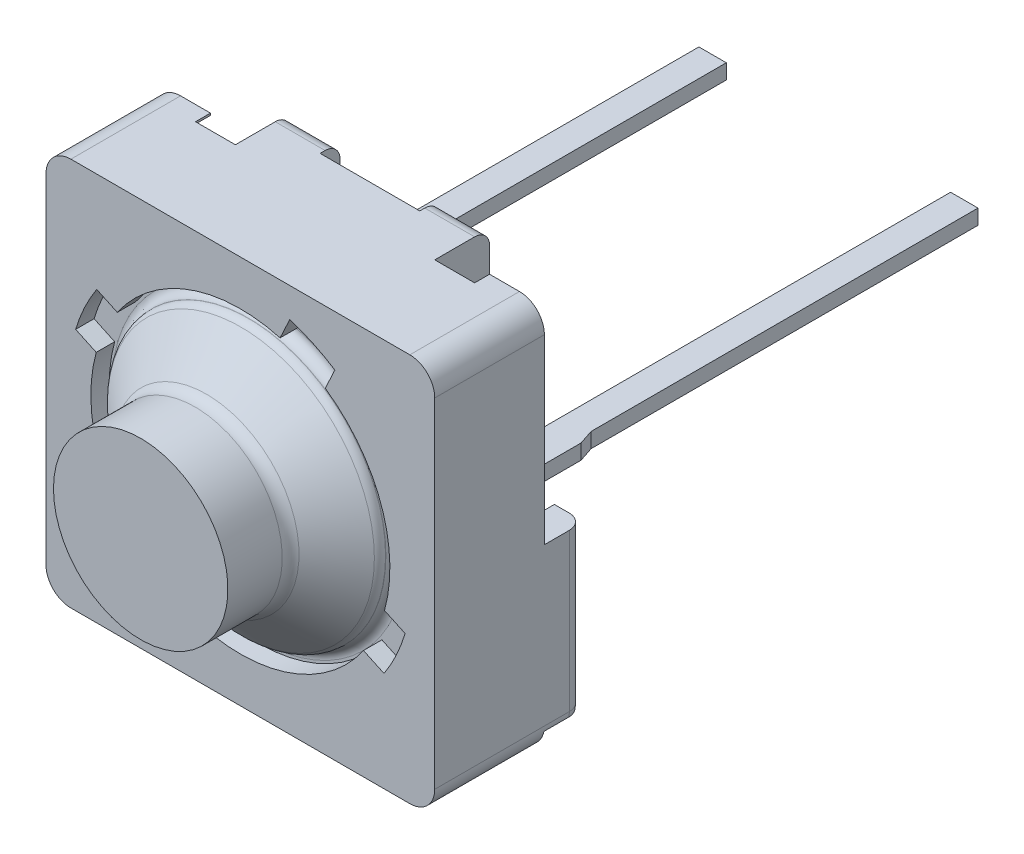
ISO-10303-21;
HEADER;
FILE_DESCRIPTION(('STEP AP214'),'2;1');
FILE_NAME('part.step','',(''),(''),'','','');
FILE_SCHEMA(('AUTOMOTIVE_DESIGN { 1 0 10303 214 1 1 1 1 }'));
ENDSEC;
DATA;
#1=APPLICATION_CONTEXT('core data for automotive mechanical design processes');
#2=APPLICATION_PROTOCOL_DEFINITION('international standard','automotive_design',2000,#1);
#3=PRODUCT_CONTEXT('',#1,'mechanical');
#4=PRODUCT('Part','Part','',(#3));
#5=PRODUCT_RELATED_PRODUCT_CATEGORY('part','',(#4));
#6=PRODUCT_DEFINITION_FORMATION('','',#4);
#7=PRODUCT_DEFINITION_CONTEXT('part definition',#1,'design');
#8=PRODUCT_DEFINITION('design','',#6,#7);
#9=PRODUCT_DEFINITION_SHAPE('','',#8);
#10=(LENGTH_UNIT() NAMED_UNIT(*) SI_UNIT(.MILLI.,.METRE.));
#11=(NAMED_UNIT(*) PLANE_ANGLE_UNIT() SI_UNIT($,.RADIAN.));
#12=(NAMED_UNIT(*) SI_UNIT($,.STERADIAN.) SOLID_ANGLE_UNIT());
#13=UNCERTAINTY_MEASURE_WITH_UNIT(LENGTH_MEASURE(1.E-05),#10,'distance_accuracy_value','');
#14=(GEOMETRIC_REPRESENTATION_CONTEXT(3) GLOBAL_UNCERTAINTY_ASSIGNED_CONTEXT((#13)) GLOBAL_UNIT_ASSIGNED_CONTEXT((#10,
#11,#12)) REPRESENTATION_CONTEXT('',''));
#15=CARTESIAN_POINT('',(0.,0.,0.));
#16=DIRECTION('',(0.,0.,1.));
#17=DIRECTION('',(1.,0.,0.));
#18=AXIS2_PLACEMENT_3D('',#15,#16,#17);
#19=CARTESIAN_POINT('',(0.,0.,5.));
#20=DIRECTION('',(0.,0.,1.));
#21=DIRECTION('',(1.,0.,0.));
#22=AXIS2_PLACEMENT_3D('',#19,#20,#21);
#23=PLANE('',#22);
#24=CARTESIAN_POINT('',(0.,0.,5.));
#25=DIRECTION('',(0.,0.,-1.));
#26=DIRECTION('',(-1.,0.,0.));
#27=AXIS2_PLACEMENT_3D('',#24,#25,#26);
#28=CIRCLE('',#27,1.75);
#29=CARTESIAN_POINT('',(-1.75,0.,5.));
#30=VERTEX_POINT('',#29);
#31=EDGE_CURVE('E1819',#30,#30,#28,.T.);
#32=ORIENTED_EDGE('',*,*,#31,.F.);
#33=EDGE_LOOP('',(#32));
#34=FACE_BOUND('',#33,.T.);
#35=ADVANCED_FACE('F18',(#34),#23,.T.);
#36=CARTESIAN_POINT('',(0.,0.,1.43));
#37=DIRECTION('',(0.,0.,-1.));
#38=DIRECTION('',(-1.,0.,0.));
#39=AXIS2_PLACEMENT_3D('',#36,#37,#38);
#40=CYLINDRICAL_SURFACE('',#39,1.75);
#41=CARTESIAN_POINT('',(0.,0.,3.90979586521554));
#42=DIRECTION('',(0.,0.,-1.));
#43=DIRECTION('',(-1.,0.,0.));
#44=AXIS2_PLACEMENT_3D('',#41,#42,#43);
#45=CIRCLE('',#44,1.75);
#46=CARTESIAN_POINT('',(-1.75,0.,3.90979586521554));
#47=VERTEX_POINT('',#46);
#48=EDGE_CURVE('E1822',#47,#47,#45,.F.);
#49=ORIENTED_EDGE('',*,*,#48,.T.);
#50=EDGE_LOOP('',(#49));
#51=FACE_BOUND('',#50,.T.);
#52=ORIENTED_EDGE('',*,*,#31,.T.);
#53=EDGE_LOOP('',(#52));
#54=FACE_BOUND('',#53,.T.);
#55=ADVANCED_FACE('F690',(#51,#54),#40,.T.);
#56=CARTESIAN_POINT('',(0.,0.,3.90979586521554));
#57=DIRECTION('',(0.,0.,-1.));
#58=DIRECTION('',(-1.,0.,0.));
#59=AXIS2_PLACEMENT_3D('',#56,#57,#58);
#60=TOROIDAL_SURFACE('',#59,2.05,0.3);
#61=CARTESIAN_POINT('',(0.,0.,3.68008440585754));
#62=DIRECTION('',(0.,0.,-1.));
#63=DIRECTION('',(-1.,0.,0.));
#64=AXIS2_PLACEMENT_3D('',#61,#62,#63);
#65=CIRCLE('',#64,1.85704237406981);
#66=CARTESIAN_POINT('',(-1.85704237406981,0.,3.68008440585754));
#67=VERTEX_POINT('',#66);
#68=EDGE_CURVE('E653',#67,#67,#65,.T.);
#69=ORIENTED_EDGE('',*,*,#68,.F.);
#70=EDGE_LOOP('',(#69));
#71=FACE_BOUND('',#70,.T.);
#72=ORIENTED_EDGE('',*,*,#48,.F.);
#73=EDGE_LOOP('',(#72));
#74=FACE_BOUND('',#73,.T.);
#75=ADVANCED_FACE('F685',(#71,#74),#60,.F.);
#76=CARTESIAN_POINT('',(2.00000000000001,-0.14999999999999,3.61415926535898));
#77=DIRECTION('',(0.,-1.,0.));
#78=DIRECTION('',(0.,0.,-1.));
#79=AXIS2_PLACEMENT_3D('',#76,#77,#78);
#80=PLANE('',#79);
#81=DIRECTION('',(1.,0.,0.));
#82=VECTOR('',#81,1.);
#83=CARTESIAN_POINT('',(2.00000000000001,-0.15,0.749999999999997));
#84=LINE('',#83,#82);
#85=CARTESIAN_POINT('',(2.9,-0.15,0.749999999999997));
#86=VERTEX_POINT('',#85);
#87=CARTESIAN_POINT('',(2.35,-0.15,0.749999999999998));
#88=VERTEX_POINT('',#87);
#89=EDGE_CURVE('E682',#86,#88,#84,.F.);
#90=ORIENTED_EDGE('',*,*,#89,.T.);
#91=DIRECTION('',(0.,0.,-1.));
#92=VECTOR('',#91,1.);
#93=CARTESIAN_POINT('',(2.35,-0.14999999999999,3.61415926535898));
#94=LINE('',#93,#92);
#95=CARTESIAN_POINT('',(2.35,-0.150000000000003,-0.062635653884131));
#96=VERTEX_POINT('',#95);
#97=EDGE_CURVE('E679',#88,#96,#94,.T.);
#98=ORIENTED_EDGE('',*,*,#97,.T.);
#99=DIRECTION('',(-0.499999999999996,0.,-0.866025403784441));
#100=VECTOR('',#99,1.);
#101=CARTESIAN_POINT('',(2.35,-0.150000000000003,-0.0626356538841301));
#102=LINE('',#101,#100);
#103=CARTESIAN_POINT('',(2.25,-0.150000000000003,-0.235840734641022));
#104=VERTEX_POINT('',#103);
#105=EDGE_CURVE('E2068',#96,#104,#102,.T.);
#106=ORIENTED_EDGE('',*,*,#105,.T.);
#107=DIRECTION('',(0.,0.,-1.));
#108=VECTOR('',#107,1.);
#109=CARTESIAN_POINT('',(2.25,-0.150000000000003,-0.235840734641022));
#110=LINE('',#109,#108);
#111=CARTESIAN_POINT('',(2.24999999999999,-0.150000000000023,-9.00000000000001));
#112=VERTEX_POINT('',#111);
#113=EDGE_CURVE('E2038',#104,#112,#110,.T.);
#114=ORIENTED_EDGE('',*,*,#113,.T.);
#115=DIRECTION('',(1.,0.,0.));
#116=VECTOR('',#115,1.);
#117=CARTESIAN_POINT('',(4.13900309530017,-0.150000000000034,-9.00000000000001));
#118=LINE('',#117,#116);
#119=CARTESIAN_POINT('',(2.79999999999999,-0.150000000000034,-9.00000000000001));
#120=VERTEX_POINT('',#119);
#121=EDGE_CURVE('E2019',#112,#120,#118,.T.);
#122=ORIENTED_EDGE('',*,*,#121,.T.);
#123=DIRECTION('',(0.,0.,1.));
#124=VECTOR('',#123,1.);
#125=CARTESIAN_POINT('',(2.79999999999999,-0.150000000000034,-9.63584073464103));
#126=LINE('',#125,#124);
#127=CARTESIAN_POINT('',(2.79999999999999,-0.150000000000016,-1.23584073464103));
#128=VERTEX_POINT('',#127);
#129=EDGE_CURVE('E2008',#120,#128,#126,.T.);
#130=ORIENTED_EDGE('',*,*,#129,.T.);
#131=DIRECTION('',(0.316227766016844,0.,0.948683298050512));
#132=VECTOR('',#131,1.);
#133=CARTESIAN_POINT('',(2.79999999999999,-0.150000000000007,-1.23584073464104));
#134=LINE('',#133,#132);
#135=CARTESIAN_POINT('',(2.9,-0.150000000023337,-0.935840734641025));
#136=VERTEX_POINT('',#135);
#137=EDGE_CURVE('E290',#128,#136,#134,.T.);
#138=ORIENTED_EDGE('',*,*,#137,.T.);
#139=DIRECTION('',(0.,0.,-1.));
#140=VECTOR('',#139,1.);
#141=CARTESIAN_POINT('',(2.9,-0.14999999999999,3.61415926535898));
#142=LINE('',#141,#140);
#143=EDGE_CURVE('E2067',#136,#86,#142,.F.);
#144=ORIENTED_EDGE('',*,*,#143,.T.);
#145=EDGE_LOOP('',(#90,#98,#106,#114,#122,#130,#138,#144));
#146=FACE_BOUND('',#145,.T.);
#147=ADVANCED_FACE('F689',(#146),#80,.T.);
#148=CARTESIAN_POINT('',(0.,0.,2.98994372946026));
#149=DIRECTION('',(0.,0.,-1.));
#150=DIRECTION('',(-1.,0.,0.));
#151=AXIS2_PLACEMENT_3D('',#148,#149,#150);
#152=CONICAL_SURFACE('',#151,2.67863841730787,0.872136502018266);
#153=CARTESIAN_POINT('',(0.,0.,2.98994372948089));
#154=DIRECTION('',(0.,0.,1.));
#155=DIRECTION('',(1.,0.,0.));
#156=AXIS2_PLACEMENT_3D('',#153,#154,#155);
#157=CIRCLE('',#156,2.67863841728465);
#158=CARTESIAN_POINT('',(2.67863841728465,0.,2.98994372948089));
#159=VERTEX_POINT('',#158);
#160=EDGE_CURVE('E1312',#159,#159,#157,.F.);
#161=ORIENTED_EDGE('',*,*,#160,.F.);
#162=EDGE_LOOP('',(#161));
#163=FACE_BOUND('',#162,.T.);
#164=ORIENTED_EDGE('',*,*,#68,.T.);
#165=EDGE_LOOP('',(#164));
#166=FACE_BOUND('',#165,.T.);
#167=ADVANCED_FACE('F1410',(#163,#166),#152,.T.);
#168=CARTESIAN_POINT('',(-1.99999999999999,-0.14999999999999,3.61415926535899));
#169=DIRECTION('',(0.,-1.,0.));
#170=DIRECTION('',(0.,0.,-1.));
#171=AXIS2_PLACEMENT_3D('',#168,#169,#170);
#172=PLANE('',#171);
#173=DIRECTION('',(1.,0.,0.));
#174=VECTOR('',#173,1.);
#175=CARTESIAN_POINT('',(-1.99999999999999,-0.15,0.750000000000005));
#176=LINE('',#175,#174);
#177=CARTESIAN_POINT('',(-2.35,-0.15,0.750000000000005));
#178=VERTEX_POINT('',#177);
#179=CARTESIAN_POINT('',(-2.9,-0.150000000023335,0.750000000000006));
#180=VERTEX_POINT('',#179);
#181=EDGE_CURVE('E2053',#178,#180,#176,.F.);
#182=ORIENTED_EDGE('',*,*,#181,.T.);
#183=DIRECTION('',(0.,0.,1.));
#184=VECTOR('',#183,1.);
#185=CARTESIAN_POINT('',(-2.9,-0.15000000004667,0.750000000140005));
#186=LINE('',#185,#184);
#187=CARTESIAN_POINT('',(-2.9,-0.15000000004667,-0.935840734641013));
#188=VERTEX_POINT('',#187);
#189=EDGE_CURVE('E1281',#188,#180,#186,.T.);
#190=ORIENTED_EDGE('',*,*,#189,.F.);
#191=DIRECTION('',(0.316227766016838,0.,-0.948683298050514));
#192=VECTOR('',#191,1.);
#193=CARTESIAN_POINT('',(-2.8,-0.15000000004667,-1.23584073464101));
#194=LINE('',#193,#192);
#195=CARTESIAN_POINT('',(-2.8,-0.15000000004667,-1.23584073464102));
#196=VERTEX_POINT('',#195);
#197=EDGE_CURVE('E659',#188,#196,#194,.T.);
#198=ORIENTED_EDGE('',*,*,#197,.T.);
#199=DIRECTION('',(0.,0.,-1.));
#200=VECTOR('',#199,1.);
#201=CARTESIAN_POINT('',(-2.80000000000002,-0.150000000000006,-9.63584073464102));
#202=LINE('',#201,#200);
#203=CARTESIAN_POINT('',(-2.80000000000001,-0.15000000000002,-8.99999999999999));
#204=VERTEX_POINT('',#203);
#205=EDGE_CURVE('E656',#196,#204,#202,.T.);
#206=ORIENTED_EDGE('',*,*,#205,.T.);
#207=DIRECTION('',(1.,0.,0.));
#208=VECTOR('',#207,1.);
#209=CARTESIAN_POINT('',(-1.99999999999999,-0.150000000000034,-8.99999999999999));
#210=LINE('',#209,#208);
#211=CARTESIAN_POINT('',(-2.25000000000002,-0.150000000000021,-9.));
#212=VERTEX_POINT('',#211);
#213=EDGE_CURVE('E640',#204,#212,#210,.T.);
#214=ORIENTED_EDGE('',*,*,#213,.T.);
#215=DIRECTION('',(0.,0.,1.));
#216=VECTOR('',#215,1.);
#217=CARTESIAN_POINT('',(-2.25,-0.150000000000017,-0.235840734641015));
#218=LINE('',#217,#216);
#219=CARTESIAN_POINT('',(-2.25000000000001,-0.150000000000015,-0.235840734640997));
#220=VERTEX_POINT('',#219);
#221=EDGE_CURVE('E1310',#212,#220,#218,.T.);
#222=ORIENTED_EDGE('',*,*,#221,.T.);
#223=DIRECTION('',(-0.499999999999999,0.,0.86602540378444));
#224=VECTOR('',#223,1.);
#225=CARTESIAN_POINT('',(-2.25,-0.150000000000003,-0.235840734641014));
#226=LINE('',#225,#224);
#227=CARTESIAN_POINT('',(-2.35,-0.150000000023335,-0.0626356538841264));
#228=VERTEX_POINT('',#227);
#229=EDGE_CURVE('E652',#220,#228,#226,.T.);
#230=ORIENTED_EDGE('',*,*,#229,.T.);
#231=DIRECTION('',(0.,0.,-1.));
#232=VECTOR('',#231,1.);
#233=CARTESIAN_POINT('',(-2.35,-0.14999999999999,3.61415926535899));
#234=LINE('',#233,#232);
#235=EDGE_CURVE('E2054',#228,#178,#234,.F.);
#236=ORIENTED_EDGE('',*,*,#235,.T.);
#237=EDGE_LOOP('',(#182,#190,#198,#206,#214,#222,#230,#236));
#238=FACE_BOUND('',#237,.T.);
#239=ADVANCED_FACE('F657',(#238),#172,.T.);
#240=CARTESIAN_POINT('',(2.25,0.149999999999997,-0.235840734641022));
#241=DIRECTION('',(1.,0.,0.));
#242=DIRECTION('',(0.,0.,-1.));
#243=AXIS2_PLACEMENT_3D('',#240,#241,#242);
#244=PLANE('',#243);
#245=DIRECTION('',(0.,0.,-1.));
#246=VECTOR('',#245,1.);
#247=CARTESIAN_POINT('',(2.25,0.15000000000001,3.61415926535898));
#248=LINE('',#247,#246);
#249=CARTESIAN_POINT('',(2.25,0.149999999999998,-0.235840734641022));
#250=VERTEX_POINT('',#249);
#251=CARTESIAN_POINT('',(2.25,0.149999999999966,-9.00000000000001));
#252=VERTEX_POINT('',#251);
#253=EDGE_CURVE('E1212',#250,#252,#248,.T.);
#254=ORIENTED_EDGE('',*,*,#253,.T.);
#255=DIRECTION('',(0.,1.,0.));
#256=VECTOR('',#255,1.);
#257=CARTESIAN_POINT('',(2.24999999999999,0.15,-9.00000000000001));
#258=LINE('',#257,#256);
#259=EDGE_CURVE('E2026',#252,#112,#258,.F.);
#260=ORIENTED_EDGE('',*,*,#259,.T.);
#261=ORIENTED_EDGE('',*,*,#113,.F.);
#262=DIRECTION('',(0.,1.,0.));
#263=VECTOR('',#262,1.);
#264=CARTESIAN_POINT('',(2.25,0.149999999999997,-0.235840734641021));
#265=LINE('',#264,#263);
#266=EDGE_CURVE('E2029',#250,#104,#265,.F.);
#267=ORIENTED_EDGE('',*,*,#266,.F.);
#268=EDGE_LOOP('',(#254,#260,#261,#267));
#269=FACE_BOUND('',#268,.T.);
#270=ADVANCED_FACE('F1404',(#269),#244,.F.);
#271=CARTESIAN_POINT('',(4.13900309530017,0.15,-9.00000000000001));
#272=DIRECTION('',(0.,0.,1.));
#273=DIRECTION('',(1.,0.,0.));
#274=AXIS2_PLACEMENT_3D('',#271,#272,#273);
#275=PLANE('',#274);
#276=ORIENTED_EDGE('',*,*,#121,.F.);
#277=ORIENTED_EDGE('',*,*,#259,.F.);
#278=DIRECTION('',(1.,0.,0.));
#279=VECTOR('',#278,1.);
#280=CARTESIAN_POINT('',(2.00000000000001,0.149999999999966,-9.00000000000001));
#281=LINE('',#280,#279);
#282=CARTESIAN_POINT('',(2.79999999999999,0.149999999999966,-9.00000000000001));
#283=VERTEX_POINT('',#282);
#284=EDGE_CURVE('E2013',#252,#283,#281,.T.);
#285=ORIENTED_EDGE('',*,*,#284,.T.);
#286=DIRECTION('',(0.,1.,0.));
#287=VECTOR('',#286,1.);
#288=CARTESIAN_POINT('',(2.79999999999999,0.149999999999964,-9.00000000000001));
#289=LINE('',#288,#287);
#290=EDGE_CURVE('E2016',#283,#120,#289,.F.);
#291=ORIENTED_EDGE('',*,*,#290,.T.);
#292=EDGE_LOOP('',(#276,#277,#285,#291));
#293=FACE_BOUND('',#292,.T.);
#294=ADVANCED_FACE('F1400',(#293),#275,.F.);
#295=CARTESIAN_POINT('',(2.79999999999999,0.149999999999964,-9.63584073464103));
#296=DIRECTION('',(-1.,0.,0.));
#297=DIRECTION('',(0.,0.,1.));
#298=AXIS2_PLACEMENT_3D('',#295,#296,#297);
#299=PLANE('',#298);
#300=ORIENTED_EDGE('',*,*,#129,.F.);
#301=ORIENTED_EDGE('',*,*,#290,.F.);
#302=DIRECTION('',(0.,0.,-1.));
#303=VECTOR('',#302,1.);
#304=CARTESIAN_POINT('',(2.79999999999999,0.15000000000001,3.61415926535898));
#305=LINE('',#304,#303);
#306=CARTESIAN_POINT('',(2.79999999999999,0.149999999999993,-1.23584073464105));
#307=VERTEX_POINT('',#306);
#308=EDGE_CURVE('E2003',#283,#307,#305,.F.);
#309=ORIENTED_EDGE('',*,*,#308,.T.);
#310=DIRECTION('',(0.,1.,0.));
#311=VECTOR('',#310,1.);
#312=CARTESIAN_POINT('',(2.8,0.149999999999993,-1.23584073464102));
#313=LINE('',#312,#311);
#314=EDGE_CURVE('E1826',#307,#128,#313,.F.);
#315=ORIENTED_EDGE('',*,*,#314,.T.);
#316=EDGE_LOOP('',(#300,#301,#309,#315));
#317=FACE_BOUND('',#316,.T.);
#318=ADVANCED_FACE('F1397',(#317),#299,.F.);
#319=CARTESIAN_POINT('',(2.8,0.149999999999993,-1.23584073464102));
#320=DIRECTION('',(-0.948683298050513,0.,0.316227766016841));
#321=DIRECTION('',(0.316227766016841,0.,0.948683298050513));
#322=AXIS2_PLACEMENT_3D('',#319,#320,#321);
#323=PLANE('',#322);
#324=DIRECTION('',(0.316227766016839,0.,0.948683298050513));
#325=VECTOR('',#324,1.);
#326=CARTESIAN_POINT('',(2.8,0.149999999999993,-1.23584073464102));
#327=LINE('',#326,#325);
#328=CARTESIAN_POINT('',(2.9,0.149999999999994,-0.935840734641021));
#329=VERTEX_POINT('',#328);
#330=EDGE_CURVE('E1200',#307,#329,#327,.T.);
#331=ORIENTED_EDGE('',*,*,#330,.T.);
#332=DIRECTION('',(0.,1.,0.));
#333=VECTOR('',#332,1.);
#334=CARTESIAN_POINT('',(2.9,-0.2,-0.935840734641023));
#335=LINE('',#334,#333);
#336=EDGE_CURVE('E1825',#136,#329,#335,.T.);
#337=ORIENTED_EDGE('',*,*,#336,.F.);
#338=ORIENTED_EDGE('',*,*,#137,.F.);
#339=ORIENTED_EDGE('',*,*,#314,.F.);
#340=EDGE_LOOP('',(#331,#337,#338,#339));
#341=FACE_BOUND('',#340,.T.);
#342=ADVANCED_FACE('F1394',(#341),#323,.F.);
#343=CARTESIAN_POINT('',(2.9,-0.2,0.750000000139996));
#344=DIRECTION('',(1.,0.,0.));
#345=DIRECTION('',(0.,0.,-1.));
#346=AXIS2_PLACEMENT_3D('',#343,#344,#345);
#347=PLANE('',#346);
#348=DIRECTION('',(0.,0.,-1.));
#349=VECTOR('',#348,1.);
#350=CARTESIAN_POINT('',(2.9,0.,0.750000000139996));
#351=LINE('',#350,#349);
#352=CARTESIAN_POINT('',(2.9,0.,1.03722813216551));
#353=VERTEX_POINT('',#352);
#354=CARTESIAN_POINT('',(2.9,0.,0.799999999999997));
#355=VERTEX_POINT('',#354);
#356=EDGE_CURVE('E1829',#353,#355,#351,.T.);
#357=ORIENTED_EDGE('',*,*,#356,.T.);
#358=DIRECTION('',(0.,1.,0.));
#359=VECTOR('',#358,1.);
#360=CARTESIAN_POINT('',(2.9,-0.2,0.799999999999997));
#361=LINE('',#360,#359);
#362=CARTESIAN_POINT('',(2.9,-0.2,0.799999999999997));
#363=VERTEX_POINT('',#362);
#364=EDGE_CURVE('E281',#355,#363,#361,.F.);
#365=ORIENTED_EDGE('',*,*,#364,.T.);
#366=CARTESIAN_POINT('',(2.9,-0.2,0.749999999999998));
#367=DIRECTION('',(1.,0.,0.));
#368=DIRECTION('',(0.,0.,-1.));
#369=AXIS2_PLACEMENT_3D('',#366,#367,#368);
#370=CIRCLE('',#369,0.0499999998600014);
#371=EDGE_CURVE('E1823',#363,#86,#370,.F.);
#372=ORIENTED_EDGE('',*,*,#371,.T.);
#373=ORIENTED_EDGE('',*,*,#143,.F.);
#374=ORIENTED_EDGE('',*,*,#336,.T.);
#375=DIRECTION('',(0.,0.,-1.));
#376=VECTOR('',#375,1.);
#377=CARTESIAN_POINT('',(2.9,0.15000000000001,3.61415926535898));
#378=LINE('',#377,#376);
#379=CARTESIAN_POINT('',(2.9,0.149999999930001,0.749999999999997));
#380=VERTEX_POINT('',#379);
#381=EDGE_CURVE('E1195',#329,#380,#378,.F.);
#382=ORIENTED_EDGE('',*,*,#381,.T.);
#383=CARTESIAN_POINT('',(2.9,-0.2,0.749999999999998));
#384=DIRECTION('',(1.,0.,0.));
#385=DIRECTION('',(0.,0.,-1.));
#386=AXIS2_PLACEMENT_3D('',#383,#384,#385);
#387=CIRCLE('',#386,0.349999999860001);
#388=EDGE_CURVE('E1827',#380,#353,#387,.T.);
#389=ORIENTED_EDGE('',*,*,#388,.T.);
#390=EDGE_LOOP('',(#357,#365,#372,#373,#374,#382,#389));
#391=FACE_BOUND('',#390,.T.);
#392=ADVANCED_FACE('F1389',(#391),#347,.T.);
#393=CARTESIAN_POINT('',(0.,0.,2.83680275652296));
#394=DIRECTION('',(0.,0.,1.));
#395=DIRECTION('',(1.,0.,0.));
#396=AXIS2_PLACEMENT_3D('',#393,#394,#395);
#397=TOROIDAL_SURFACE('',#396,2.55,0.2);
#398=ORIENTED_EDGE('',*,*,#160,.T.);
#399=EDGE_LOOP('',(#398));
#400=FACE_BOUND('',#399,.T.);
#401=CARTESIAN_POINT('',(0.,0.,2.83680275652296));
#402=DIRECTION('',(0.,0.,-1.));
#403=DIRECTION('',(-1.,0.,0.));
#404=AXIS2_PLACEMENT_3D('',#401,#402,#403);
#405=CIRCLE('',#404,2.75);
#406=CARTESIAN_POINT('',(-2.75,0.,2.83680275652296));
#407=VERTEX_POINT('',#406);
#408=EDGE_CURVE('E1194',#407,#407,#405,.T.);
#409=ORIENTED_EDGE('',*,*,#408,.F.);
#410=EDGE_LOOP('',(#409));
#411=FACE_BOUND('',#410,.T.);
#412=ADVANCED_FACE('F1384',(#400,#411),#397,.T.);
#413=CARTESIAN_POINT('',(-2.25,0.149999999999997,-0.235840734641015));
#414=DIRECTION('',(-1.,0.,0.));
#415=DIRECTION('',(0.,0.,1.));
#416=AXIS2_PLACEMENT_3D('',#413,#414,#415);
#417=PLANE('',#416);
#418=DIRECTION('',(0.,0.,-1.));
#419=VECTOR('',#418,1.);
#420=CARTESIAN_POINT('',(-2.25000000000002,0.15000000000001,3.61415926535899));
#421=LINE('',#420,#419);
#422=CARTESIAN_POINT('',(-2.25000000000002,0.149999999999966,-9.));
#423=VERTEX_POINT('',#422);
#424=CARTESIAN_POINT('',(-2.25000000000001,0.149999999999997,-0.235840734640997));
#425=VERTEX_POINT('',#424);
#426=EDGE_CURVE('E1126',#423,#425,#421,.F.);
#427=ORIENTED_EDGE('',*,*,#426,.T.);
#428=DIRECTION('',(0.,1.,0.));
#429=VECTOR('',#428,1.);
#430=CARTESIAN_POINT('',(-2.25000000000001,0.149999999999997,-0.235840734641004));
#431=LINE('',#430,#429);
#432=EDGE_CURVE('E1296',#425,#220,#431,.F.);
#433=ORIENTED_EDGE('',*,*,#432,.T.);
#434=ORIENTED_EDGE('',*,*,#221,.F.);
#435=DIRECTION('',(0.,1.,0.));
#436=VECTOR('',#435,1.);
#437=CARTESIAN_POINT('',(-2.25000000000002,0.15,-9.));
#438=LINE('',#437,#436);
#439=EDGE_CURVE('E648',#212,#423,#438,.T.);
#440=ORIENTED_EDGE('',*,*,#439,.T.);
#441=EDGE_LOOP('',(#427,#433,#434,#440));
#442=FACE_BOUND('',#441,.T.);
#443=ADVANCED_FACE('F1388',(#442),#417,.F.);
#444=CARTESIAN_POINT('',(-2.9,-0.2,0.750000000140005));
#445=DIRECTION('',(-1.,0.,0.));
#446=DIRECTION('',(0.,0.,1.));
#447=AXIS2_PLACEMENT_3D('',#444,#445,#446);
#448=PLANE('',#447);
#449=DIRECTION('',(0.,1.,0.));
#450=VECTOR('',#449,1.);
#451=CARTESIAN_POINT('',(-2.9,-0.2,0.800000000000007));
#452=LINE('',#451,#450);
#453=CARTESIAN_POINT('',(-2.9,-0.2,0.800000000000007));
#454=VERTEX_POINT('',#453);
#455=CARTESIAN_POINT('',(-2.9,0.,0.800000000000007));
#456=VERTEX_POINT('',#455);
#457=EDGE_CURVE('E1274',#454,#456,#452,.T.);
#458=ORIENTED_EDGE('',*,*,#457,.T.);
#459=DIRECTION('',(0.,0.,1.));
#460=VECTOR('',#459,1.);
#461=CARTESIAN_POINT('',(-2.9,0.,0.750000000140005));
#462=LINE('',#461,#460);
#463=CARTESIAN_POINT('',(-2.9,0.,1.03722813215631));
#464=VERTEX_POINT('',#463);
#465=EDGE_CURVE('E1272',#456,#464,#462,.T.);
#466=ORIENTED_EDGE('',*,*,#465,.T.);
#467=CARTESIAN_POINT('',(-2.9,-0.2,0.750000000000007));
#468=DIRECTION('',(-1.,0.,0.));
#469=DIRECTION('',(0.,0.,1.));
#470=AXIS2_PLACEMENT_3D('',#467,#468,#469);
#471=CIRCLE('',#470,0.349999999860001);
#472=CARTESIAN_POINT('',(-2.9,0.149999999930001,0.750000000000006));
#473=VERTEX_POINT('',#472);
#474=EDGE_CURVE('E1284',#464,#473,#471,.T.);
#475=ORIENTED_EDGE('',*,*,#474,.T.);
#476=DIRECTION('',(0.,0.,-1.));
#477=VECTOR('',#476,1.);
#478=CARTESIAN_POINT('',(-2.9,0.15000000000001,3.61415926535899));
#479=LINE('',#478,#477);
#480=CARTESIAN_POINT('',(-2.9,0.149999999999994,-0.935840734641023));
#481=VERTEX_POINT('',#480);
#482=EDGE_CURVE('E1125',#473,#481,#479,.T.);
#483=ORIENTED_EDGE('',*,*,#482,.T.);
#484=DIRECTION('',(0.,1.,0.));
#485=VECTOR('',#484,1.);
#486=CARTESIAN_POINT('',(-2.9,0.149999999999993,-0.935840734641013));
#487=LINE('',#486,#485);
#488=EDGE_CURVE('E1291',#481,#188,#487,.F.);
#489=ORIENTED_EDGE('',*,*,#488,.T.);
#490=ORIENTED_EDGE('',*,*,#189,.T.);
#491=CARTESIAN_POINT('',(-2.9,-0.2,0.750000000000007));
#492=DIRECTION('',(-1.,0.,0.));
#493=DIRECTION('',(0.,0.,1.));
#494=AXIS2_PLACEMENT_3D('',#491,#492,#493);
#495=CIRCLE('',#494,0.0499999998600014);
#496=EDGE_CURVE('E1278',#180,#454,#495,.F.);
#497=ORIENTED_EDGE('',*,*,#496,.T.);
#498=EDGE_LOOP('',(#458,#466,#475,#483,#489,#490,#497));
#499=FACE_BOUND('',#498,.T.);
#500=ADVANCED_FACE('F2093',(#499),#448,.T.);
#501=CARTESIAN_POINT('',(-2.8,0.149999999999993,-1.23584073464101));
#502=DIRECTION('',(0.948683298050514,0.,0.316227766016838));
#503=DIRECTION('',(0.316227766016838,0.,-0.948683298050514));
#504=AXIS2_PLACEMENT_3D('',#501,#502,#503);
#505=PLANE('',#504);
#506=DIRECTION('',(0.316227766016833,0.,-0.948683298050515));
#507=VECTOR('',#506,1.);
#508=CARTESIAN_POINT('',(-2.9,0.149999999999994,-0.935840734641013));
#509=LINE('',#508,#507);
#510=CARTESIAN_POINT('',(-2.8,0.149999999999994,-1.23584073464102));
#511=VERTEX_POINT('',#510);
#512=EDGE_CURVE('E1121',#481,#511,#509,.T.);
#513=ORIENTED_EDGE('',*,*,#512,.T.);
#514=DIRECTION('',(0.,1.,0.));
#515=VECTOR('',#514,1.);
#516=CARTESIAN_POINT('',(-2.8,0.149999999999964,-1.23584073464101));
#517=LINE('',#516,#515);
#518=EDGE_CURVE('E662',#511,#196,#517,.F.);
#519=ORIENTED_EDGE('',*,*,#518,.T.);
#520=ORIENTED_EDGE('',*,*,#197,.F.);
#521=ORIENTED_EDGE('',*,*,#488,.F.);
#522=EDGE_LOOP('',(#513,#519,#520,#521));
#523=FACE_BOUND('',#522,.T.);
#524=ADVANCED_FACE('F2097',(#523),#505,.F.);
#525=CARTESIAN_POINT('',(-2.80000000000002,0.149999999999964,-9.63584073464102));
#526=DIRECTION('',(1.,0.,0.));
#527=DIRECTION('',(0.,0.,-1.));
#528=AXIS2_PLACEMENT_3D('',#525,#526,#527);
#529=PLANE('',#528);
#530=ORIENTED_EDGE('',*,*,#205,.F.);
#531=ORIENTED_EDGE('',*,*,#518,.F.);
#532=DIRECTION('',(0.,0.,-1.));
#533=VECTOR('',#532,1.);
#534=CARTESIAN_POINT('',(-2.8,0.15000000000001,3.61415926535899));
#535=LINE('',#534,#533);
#536=CARTESIAN_POINT('',(-2.80000000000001,0.149999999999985,-8.99999999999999));
#537=VERTEX_POINT('',#536);
#538=EDGE_CURVE('E667',#511,#537,#535,.T.);
#539=ORIENTED_EDGE('',*,*,#538,.T.);
#540=DIRECTION('',(0.,1.,0.));
#541=VECTOR('',#540,1.);
#542=CARTESIAN_POINT('',(-2.80000000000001,0.15,-9.));
#543=LINE('',#542,#541);
#544=EDGE_CURVE('E645',#537,#204,#543,.F.);
#545=ORIENTED_EDGE('',*,*,#544,.T.);
#546=EDGE_LOOP('',(#530,#531,#539,#545));
#547=FACE_BOUND('',#546,.T.);
#548=ADVANCED_FACE('F665',(#547),#529,.F.);
#549=CARTESIAN_POINT('',(-4.1390030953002,0.15,-8.99999999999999));
#550=DIRECTION('',(0.,0.,1.));
#551=DIRECTION('',(1.,0.,0.));
#552=AXIS2_PLACEMENT_3D('',#549,#550,#551);
#553=PLANE('',#552);
#554=ORIENTED_EDGE('',*,*,#213,.F.);
#555=ORIENTED_EDGE('',*,*,#544,.F.);
#556=DIRECTION('',(1.,0.,0.));
#557=VECTOR('',#556,1.);
#558=CARTESIAN_POINT('',(-1.99999999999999,0.149999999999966,-9.));
#559=LINE('',#558,#557);
#560=EDGE_CURVE('E1120',#537,#423,#559,.T.);
#561=ORIENTED_EDGE('',*,*,#560,.T.);
#562=ORIENTED_EDGE('',*,*,#439,.F.);
#563=EDGE_LOOP('',(#554,#555,#561,#562));
#564=FACE_BOUND('',#563,.T.);
#565=ADVANCED_FACE('F642',(#564),#553,.F.);
#566=CARTESIAN_POINT('',(-1.4,1.8,0.400000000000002));
#567=DIRECTION('',(0.,0.,-1.));
#568=DIRECTION('',(-1.,0.,0.));
#569=AXIS2_PLACEMENT_3D('',#566,#567,#568);
#570=PLANE('',#569);
#571=DIRECTION('',(1.,0.,0.));
#572=VECTOR('',#571,1.);
#573=CARTESIAN_POINT('',(-1.4,-1.8,0.400000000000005));
#574=LINE('',#573,#572);
#575=CARTESIAN_POINT('',(-3.3,-1.8,0.400000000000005));
#576=VERTEX_POINT('',#575);
#577=CARTESIAN_POINT('',(-1.4,-1.8,0.400000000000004));
#578=VERTEX_POINT('',#577);
#579=EDGE_CURVE('E1080',#576,#578,#574,.T.);
#580=ORIENTED_EDGE('',*,*,#579,.F.);
#581=DIRECTION('',(0.,1.,0.));
#582=VECTOR('',#581,1.);
#583=CARTESIAN_POINT('',(-3.3,0.,0.400000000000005));
#584=LINE('',#583,#582);
#585=CARTESIAN_POINT('',(-3.3,-0.25,0.400000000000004));
#586=VERTEX_POINT('',#585);
#587=EDGE_CURVE('E1078',#586,#576,#584,.F.);
#588=ORIENTED_EDGE('',*,*,#587,.F.);
#589=DIRECTION('',(-1.,0.,0.));
#590=VECTOR('',#589,1.);
#591=CARTESIAN_POINT('',(-1.4,-0.25,0.400000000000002));
#592=LINE('',#591,#590);
#593=CARTESIAN_POINT('',(-2.,-0.25,0.400000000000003));
#594=VERTEX_POINT('',#593);
#595=EDGE_CURVE('E669',#586,#594,#592,.F.);
#596=ORIENTED_EDGE('',*,*,#595,.T.);
#597=DIRECTION('',(0.,1.,0.));
#598=VECTOR('',#597,1.);
#599=CARTESIAN_POINT('',(-2.,-0.25,0.400000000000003));
#600=LINE('',#599,#598);
#601=CARTESIAN_POINT('',(-2.,1.8,0.400000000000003));
#602=VERTEX_POINT('',#601);
#603=EDGE_CURVE('E1058',#602,#594,#600,.F.);
#604=ORIENTED_EDGE('',*,*,#603,.F.);
#605=DIRECTION('',(1.,0.,0.));
#606=VECTOR('',#605,1.);
#607=CARTESIAN_POINT('',(-1.4,1.8,0.400000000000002));
#608=LINE('',#607,#606);
#609=CARTESIAN_POINT('',(-1.4,1.8,0.400000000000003));
#610=VERTEX_POINT('',#609);
#611=EDGE_CURVE('E1107',#610,#602,#608,.F.);
#612=ORIENTED_EDGE('',*,*,#611,.F.);
#613=DIRECTION('',(0.,1.,0.));
#614=VECTOR('',#613,1.);
#615=CARTESIAN_POINT('',(-1.4,0.,0.400000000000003));
#616=LINE('',#615,#614);
#617=EDGE_CURVE('E1071',#578,#610,#616,.T.);
#618=ORIENTED_EDGE('',*,*,#617,.F.);
#619=EDGE_LOOP('',(#580,#588,#596,#604,#612,#618));
#620=FACE_BOUND('',#619,.T.);
#621=ADVANCED_FACE('F1870',(#620),#570,.T.);
#622=CARTESIAN_POINT('',(1.4,1.8,0.399999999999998));
#623=DIRECTION('',(0.,0.,-1.));
#624=DIRECTION('',(-1.,0.,0.));
#625=AXIS2_PLACEMENT_3D('',#622,#623,#624);
#626=PLANE('',#625);
#627=DIRECTION('',(-1.,0.,0.));
#628=VECTOR('',#627,1.);
#629=CARTESIAN_POINT('',(1.4,-0.25,0.399999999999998));
#630=LINE('',#629,#628);
#631=CARTESIAN_POINT('',(2.,-0.25,0.399999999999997));
#632=VERTEX_POINT('',#631);
#633=CARTESIAN_POINT('',(3.3,-0.25,0.399999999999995));
#634=VERTEX_POINT('',#633);
#635=EDGE_CURVE('E1213',#632,#634,#630,.F.);
#636=ORIENTED_EDGE('',*,*,#635,.T.);
#637=DIRECTION('',(0.,1.,0.));
#638=VECTOR('',#637,1.);
#639=CARTESIAN_POINT('',(3.3,1.8,0.399999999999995));
#640=LINE('',#639,#638);
#641=CARTESIAN_POINT('',(3.3,-1.8,0.399999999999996));
#642=VERTEX_POINT('',#641);
#643=EDGE_CURVE('E1210',#634,#642,#640,.F.);
#644=ORIENTED_EDGE('',*,*,#643,.T.);
#645=DIRECTION('',(1.,0.,0.));
#646=VECTOR('',#645,1.);
#647=CARTESIAN_POINT('',(1.4,-1.8,0.399999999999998));
#648=LINE('',#647,#646);
#649=CARTESIAN_POINT('',(1.4,-1.8,0.399999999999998));
#650=VERTEX_POINT('',#649);
#651=EDGE_CURVE('E977',#650,#642,#648,.T.);
#652=ORIENTED_EDGE('',*,*,#651,.F.);
#653=DIRECTION('',(0.,1.,0.));
#654=VECTOR('',#653,1.);
#655=CARTESIAN_POINT('',(1.4,0.,0.399999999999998));
#656=LINE('',#655,#654);
#657=CARTESIAN_POINT('',(1.4,1.8,0.399999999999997));
#658=VERTEX_POINT('',#657);
#659=EDGE_CURVE('E987',#658,#650,#656,.F.);
#660=ORIENTED_EDGE('',*,*,#659,.F.);
#661=DIRECTION('',(1.,0.,0.));
#662=VECTOR('',#661,1.);
#663=CARTESIAN_POINT('',(1.4,1.8,0.399999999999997));
#664=LINE('',#663,#662);
#665=CARTESIAN_POINT('',(2.,1.8,0.399999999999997));
#666=VERTEX_POINT('',#665);
#667=EDGE_CURVE('E996',#666,#658,#664,.F.);
#668=ORIENTED_EDGE('',*,*,#667,.F.);
#669=DIRECTION('',(0.,1.,0.));
#670=VECTOR('',#669,1.);
#671=CARTESIAN_POINT('',(2.,-0.25,0.399999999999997));
#672=LINE('',#671,#670);
#673=EDGE_CURVE('E1217',#632,#666,#672,.T.);
#674=ORIENTED_EDGE('',*,*,#673,.F.);
#675=EDGE_LOOP('',(#636,#644,#652,#660,#668,#674));
#676=FACE_BOUND('',#675,.T.);
#677=ADVANCED_FACE('F2443',(#676),#626,.T.);
#678=CARTESIAN_POINT('',(2.00000000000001,0.15000000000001,3.61415926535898));
#679=DIRECTION('',(0.,-1.,0.));
#680=DIRECTION('',(0.,0.,-1.));
#681=AXIS2_PLACEMENT_3D('',#678,#679,#680);
#682=PLANE('',#681);
#683=DIRECTION('',(0.,0.,-1.));
#684=VECTOR('',#683,1.);
#685=CARTESIAN_POINT('',(2.35,0.15000000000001,3.61415926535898));
#686=LINE('',#685,#684);
#687=CARTESIAN_POINT('',(2.35,0.149999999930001,0.749999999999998));
#688=VERTEX_POINT('',#687);
#689=CARTESIAN_POINT('',(2.35,0.149999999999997,-0.0626356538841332));
#690=VERTEX_POINT('',#689);
#691=EDGE_CURVE('E1192',#688,#690,#686,.T.);
#692=ORIENTED_EDGE('',*,*,#691,.F.);
#693=DIRECTION('',(1.,0.,0.));
#694=VECTOR('',#693,1.);
#695=CARTESIAN_POINT('',(1.92414620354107,0.149999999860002,0.749999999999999));
#696=LINE('',#695,#694);
#697=EDGE_CURVE('E943',#380,#688,#696,.F.);
#698=ORIENTED_EDGE('',*,*,#697,.F.);
#699=ORIENTED_EDGE('',*,*,#381,.F.);
#700=ORIENTED_EDGE('',*,*,#330,.F.);
#701=ORIENTED_EDGE('',*,*,#308,.F.);
#702=ORIENTED_EDGE('',*,*,#284,.F.);
#703=ORIENTED_EDGE('',*,*,#253,.F.);
#704=DIRECTION('',(-0.500000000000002,0.,-0.866025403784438));
#705=VECTOR('',#704,1.);
#706=CARTESIAN_POINT('',(2.35,0.149999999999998,-0.0626356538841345));
#707=LINE('',#706,#705);
#708=EDGE_CURVE('E946',#250,#690,#707,.F.);
#709=ORIENTED_EDGE('',*,*,#708,.T.);
#710=EDGE_LOOP('',(#692,#698,#699,#700,#701,#702,#703,#709));
#711=FACE_BOUND('',#710,.T.);
#712=ADVANCED_FACE('F2439',(#711),#682,.F.);
#713=CARTESIAN_POINT('',(0.,0.,1.43));
#714=DIRECTION('',(0.,0.,-1.));
#715=DIRECTION('',(-1.,0.,0.));
#716=AXIS2_PLACEMENT_3D('',#713,#714,#715);
#717=CYLINDRICAL_SURFACE('',#716,2.75);
#718=CARTESIAN_POINT('',(0.,0.,2.83));
#719=DIRECTION('',(0.,0.,1.));
#720=DIRECTION('',(1.,0.,0.));
#721=AXIS2_PLACEMENT_3D('',#718,#719,#720);
#722=CIRCLE('',#721,2.75);
#723=CARTESIAN_POINT('',(2.75,0.,2.82999999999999));
#724=VERTEX_POINT('',#723);
#725=EDGE_CURVE('E889',#724,#724,#722,.T.);
#726=ORIENTED_EDGE('',*,*,#725,.T.);
#727=EDGE_LOOP('',(#726));
#728=FACE_BOUND('',#727,.T.);
#729=ORIENTED_EDGE('',*,*,#408,.T.);
#730=EDGE_LOOP('',(#729));
#731=FACE_BOUND('',#730,.T.);
#732=ADVANCED_FACE('F2436',(#728,#731),#717,.T.);
#733=CARTESIAN_POINT('',(2.,-2.75,0.799999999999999));
#734=DIRECTION('',(0.,0.,-1.));
#735=DIRECTION('',(-1.,0.,0.));
#736=AXIS2_PLACEMENT_3D('',#733,#734,#735);
#737=PLANE('',#736);
#738=DIRECTION('',(-1.,0.,0.));
#739=VECTOR('',#738,1.);
#740=CARTESIAN_POINT('',(2.,-3.9,0.799999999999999));
#741=LINE('',#740,#739);
#742=CARTESIAN_POINT('',(2.25,-3.9,0.799999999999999));
#743=VERTEX_POINT('',#742);
#744=CARTESIAN_POINT('',(2.,-3.9,0.799999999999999));
#745=VERTEX_POINT('',#744);
#746=EDGE_CURVE('E1172',#743,#745,#741,.T.);
#747=ORIENTED_EDGE('',*,*,#746,.T.);
#748=DIRECTION('',(0.,1.,0.));
#749=VECTOR('',#748,1.);
#750=CARTESIAN_POINT('',(2.,-2.75,0.799999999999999));
#751=LINE('',#750,#749);
#752=CARTESIAN_POINT('',(2.,-3.5,0.799999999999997));
#753=VERTEX_POINT('',#752);
#754=EDGE_CURVE('E1153',#745,#753,#751,.T.);
#755=ORIENTED_EDGE('',*,*,#754,.T.);
#756=DIRECTION('',(1.,0.,0.));
#757=VECTOR('',#756,1.);
#758=CARTESIAN_POINT('',(2.,-3.5,0.799999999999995));
#759=LINE('',#758,#757);
#760=CARTESIAN_POINT('',(3.88989794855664,-3.5,0.799999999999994));
#761=VERTEX_POINT('',#760);
#762=EDGE_CURVE('E878',#761,#753,#759,.F.);
#763=ORIENTED_EDGE('',*,*,#762,.F.);
#764=CARTESIAN_POINT('',(3.4,-3.4,0.799999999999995));
#765=DIRECTION('',(0.,0.,-1.));
#766=DIRECTION('',(-1.,0.,0.));
#767=AXIS2_PLACEMENT_3D('',#764,#765,#766);
#768=CIRCLE('',#767,0.5);
#769=CARTESIAN_POINT('',(3.4,-3.9,0.799999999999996));
#770=VERTEX_POINT('',#769);
#771=EDGE_CURVE('E1164',#761,#770,#768,.T.);
#772=ORIENTED_EDGE('',*,*,#771,.T.);
#773=DIRECTION('',(-1.,0.,0.));
#774=VECTOR('',#773,1.);
#775=CARTESIAN_POINT('',(2.,-3.9,0.799999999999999));
#776=LINE('',#775,#774);
#777=CARTESIAN_POINT('',(2.8,-3.9,0.799999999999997));
#778=VERTEX_POINT('',#777);
#779=EDGE_CURVE('E1161',#770,#778,#776,.T.);
#780=ORIENTED_EDGE('',*,*,#779,.T.);
#781=DIRECTION('',(0.,1.,0.));
#782=VECTOR('',#781,1.);
#783=CARTESIAN_POINT('',(2.8,-2.75,0.799999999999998));
#784=LINE('',#783,#782);
#785=CARTESIAN_POINT('',(2.8,-4.1,0.799999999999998));
#786=VERTEX_POINT('',#785);
#787=EDGE_CURVE('E1163',#778,#786,#784,.F.);
#788=ORIENTED_EDGE('',*,*,#787,.T.);
#789=DIRECTION('',(-1.,0.,0.));
#790=VECTOR('',#789,1.);
#791=CARTESIAN_POINT('',(2.,-4.1,0.799999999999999));
#792=LINE('',#791,#790);
#793=CARTESIAN_POINT('',(2.25,-4.1,0.799999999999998));
#794=VERTEX_POINT('',#793);
#795=EDGE_CURVE('E1349',#786,#794,#792,.T.);
#796=ORIENTED_EDGE('',*,*,#795,.T.);
#797=DIRECTION('',(0.,1.,0.));
#798=VECTOR('',#797,1.);
#799=CARTESIAN_POINT('',(2.25,-2.75,0.799999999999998));
#800=LINE('',#799,#798);
#801=EDGE_CURVE('E1338',#794,#743,#800,.T.);
#802=ORIENTED_EDGE('',*,*,#801,.T.);
#803=EDGE_LOOP('',(#747,#755,#763,#772,#780,#788,#796,#802));
#804=FACE_BOUND('',#803,.T.);
#805=ADVANCED_FACE('F2208',(#804),#737,.T.);
#806=CARTESIAN_POINT('',(-2.,-2.75,0.800000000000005));
#807=DIRECTION('',(0.,0.,-1.));
#808=DIRECTION('',(-1.,0.,0.));
#809=AXIS2_PLACEMENT_3D('',#806,#807,#808);
#810=PLANE('',#809);
#811=DIRECTION('',(-1.,0.,0.));
#812=VECTOR('',#811,1.);
#813=CARTESIAN_POINT('',(-2.,-4.1,0.800000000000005));
#814=LINE('',#813,#812);
#815=CARTESIAN_POINT('',(-2.25,-4.1,0.800000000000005));
#816=VERTEX_POINT('',#815);
#817=CARTESIAN_POINT('',(-2.8,-4.1,0.800000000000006));
#818=VERTEX_POINT('',#817);
#819=EDGE_CURVE('E1146',#816,#818,#814,.T.);
#820=ORIENTED_EDGE('',*,*,#819,.T.);
#821=DIRECTION('',(0.,1.,0.));
#822=VECTOR('',#821,1.);
#823=CARTESIAN_POINT('',(-2.8,-2.75,0.800000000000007));
#824=LINE('',#823,#822);
#825=CARTESIAN_POINT('',(-2.8,-3.9,0.800000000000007));
#826=VERTEX_POINT('',#825);
#827=EDGE_CURVE('E1148',#818,#826,#824,.T.);
#828=ORIENTED_EDGE('',*,*,#827,.T.);
#829=DIRECTION('',(-1.,0.,0.));
#830=VECTOR('',#829,1.);
#831=CARTESIAN_POINT('',(-2.,-3.9,0.800000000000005));
#832=LINE('',#831,#830);
#833=CARTESIAN_POINT('',(-3.4,-3.9,0.800000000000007));
#834=VERTEX_POINT('',#833);
#835=EDGE_CURVE('E1150',#826,#834,#832,.T.);
#836=ORIENTED_EDGE('',*,*,#835,.T.);
#837=CARTESIAN_POINT('',(-3.4,-3.4,0.800000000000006));
#838=DIRECTION('',(0.,0.,-1.));
#839=DIRECTION('',(-1.,0.,0.));
#840=AXIS2_PLACEMENT_3D('',#837,#838,#839);
#841=CIRCLE('',#840,0.5);
#842=CARTESIAN_POINT('',(-3.88989794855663,-3.5,0.800000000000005));
#843=VERTEX_POINT('',#842);
#844=EDGE_CURVE('E1152',#834,#843,#841,.T.);
#845=ORIENTED_EDGE('',*,*,#844,.T.);
#846=DIRECTION('',(1.,0.,0.));
#847=VECTOR('',#846,1.);
#848=CARTESIAN_POINT('',(-2.,-3.5,0.800000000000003));
#849=LINE('',#848,#847);
#850=CARTESIAN_POINT('',(-2.,-3.5,0.800000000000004));
#851=VERTEX_POINT('',#850);
#852=EDGE_CURVE('E875',#851,#843,#849,.F.);
#853=ORIENTED_EDGE('',*,*,#852,.F.);
#854=DIRECTION('',(0.,1.,0.));
#855=VECTOR('',#854,1.);
#856=CARTESIAN_POINT('',(-2.,-2.75,0.800000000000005));
#857=LINE('',#856,#855);
#858=CARTESIAN_POINT('',(-2.,-3.9,0.800000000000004));
#859=VERTEX_POINT('',#858);
#860=EDGE_CURVE('E1156',#851,#859,#857,.F.);
#861=ORIENTED_EDGE('',*,*,#860,.T.);
#862=DIRECTION('',(-1.,0.,0.));
#863=VECTOR('',#862,1.);
#864=CARTESIAN_POINT('',(-2.,-3.9,0.800000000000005));
#865=LINE('',#864,#863);
#866=CARTESIAN_POINT('',(-2.25,-3.9,0.800000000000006));
#867=VERTEX_POINT('',#866);
#868=EDGE_CURVE('E1158',#859,#867,#865,.T.);
#869=ORIENTED_EDGE('',*,*,#868,.T.);
#870=DIRECTION('',(0.,1.,0.));
#871=VECTOR('',#870,1.);
#872=CARTESIAN_POINT('',(-2.25,-2.75,0.800000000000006));
#873=LINE('',#872,#871);
#874=EDGE_CURVE('E1149',#867,#816,#873,.F.);
#875=ORIENTED_EDGE('',*,*,#874,.T.);
#876=EDGE_LOOP('',(#820,#828,#836,#845,#853,#861,#869,#875));
#877=FACE_BOUND('',#876,.T.);
#878=ADVANCED_FACE('F2430',(#877),#810,.T.);
#879=CARTESIAN_POINT('',(-2.9,-0.25,1.1));
#880=DIRECTION('',(1.,0.,0.));
#881=DIRECTION('',(0.,0.,-1.));
#882=AXIS2_PLACEMENT_3D('',#879,#880,#881);
#883=PLANE('',#882);
#884=DIRECTION('',(0.,0.,1.));
#885=VECTOR('',#884,1.);
#886=CARTESIAN_POINT('',(-2.9,0.,1.1));
#887=LINE('',#886,#885);
#888=CARTESIAN_POINT('',(-2.9,0.,1.10000000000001));
#889=VERTEX_POINT('',#888);
#890=EDGE_CURVE('E874',#889,#464,#887,.F.);
#891=ORIENTED_EDGE('',*,*,#890,.F.);
#892=DIRECTION('',(0.,1.,0.));
#893=VECTOR('',#892,1.);
#894=CARTESIAN_POINT('',(-2.9,3.9,1.1));
#895=LINE('',#894,#893);
#896=CARTESIAN_POINT('',(-2.9,-0.2,1.1));
#897=VERTEX_POINT('',#896);
#898=EDGE_CURVE('E1076',#889,#897,#895,.F.);
#899=ORIENTED_EDGE('',*,*,#898,.T.);
#900=CARTESIAN_POINT('',(-2.9,-0.2,0.750000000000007));
#901=DIRECTION('',(-1.,0.,0.));
#902=DIRECTION('',(0.,0.,1.));
#903=AXIS2_PLACEMENT_3D('',#900,#901,#902);
#904=CIRCLE('',#903,0.349999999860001);
#905=EDGE_CURVE('E1118',#464,#897,#904,.F.);
#906=ORIENTED_EDGE('',*,*,#905,.F.);
#907=EDGE_LOOP('',(#891,#899,#906));
#908=FACE_BOUND('',#907,.T.);
#909=ADVANCED_FACE('F2134',(#908),#883,.T.);
#910=CARTESIAN_POINT('',(-2.35,0.149999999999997,-0.0626356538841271));
#911=DIRECTION('',(-0.866025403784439,0.,-0.499999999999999));
#912=DIRECTION('',(-0.499999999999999,0.,0.866025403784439));
#913=AXIS2_PLACEMENT_3D('',#910,#911,#912);
#914=PLANE('',#913);
#915=DIRECTION('',(-0.49999999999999,0.,0.866025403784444));
#916=VECTOR('',#915,1.);
#917=CARTESIAN_POINT('',(-2.25000000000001,0.149999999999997,-0.235840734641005));
#918=LINE('',#917,#916);
#919=CARTESIAN_POINT('',(-2.35,0.149999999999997,-0.0626356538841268));
#920=VERTEX_POINT('',#919);
#921=EDGE_CURVE('E1122',#425,#920,#918,.T.);
#922=ORIENTED_EDGE('',*,*,#921,.T.);
#923=DIRECTION('',(0.,1.,0.));
#924=VECTOR('',#923,1.);
#925=CARTESIAN_POINT('',(-2.35,-0.2,-0.0626356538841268));
#926=LINE('',#925,#924);
#927=EDGE_CURVE('E840',#228,#920,#926,.T.);
#928=ORIENTED_EDGE('',*,*,#927,.F.);
#929=ORIENTED_EDGE('',*,*,#229,.F.);
#930=ORIENTED_EDGE('',*,*,#432,.F.);
#931=EDGE_LOOP('',(#922,#928,#929,#930));
#932=FACE_BOUND('',#931,.T.);
#933=ADVANCED_FACE('F2105',(#932),#914,.F.);
#934=CARTESIAN_POINT('',(-1.99999999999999,0.15000000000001,3.61415926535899));
#935=DIRECTION('',(0.,-1.,0.));
#936=DIRECTION('',(0.,0.,-1.));
#937=AXIS2_PLACEMENT_3D('',#934,#935,#936);
#938=PLANE('',#937);
#939=ORIENTED_EDGE('',*,*,#538,.F.);
#940=ORIENTED_EDGE('',*,*,#512,.F.);
#941=ORIENTED_EDGE('',*,*,#482,.F.);
#942=DIRECTION('',(-1.,0.,0.));
#943=VECTOR('',#942,1.);
#944=CARTESIAN_POINT('',(-1.92414620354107,0.149999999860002,0.750000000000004));
#945=LINE('',#944,#943);
#946=CARTESIAN_POINT('',(-2.35,0.14999999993,0.750000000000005));
#947=VERTEX_POINT('',#946);
#948=EDGE_CURVE('E1114',#947,#473,#945,.T.);
#949=ORIENTED_EDGE('',*,*,#948,.F.);
#950=DIRECTION('',(0.,0.,-1.));
#951=VECTOR('',#950,1.);
#952=CARTESIAN_POINT('',(-2.35,0.149999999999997,0.750000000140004));
#953=LINE('',#952,#951);
#954=EDGE_CURVE('E837',#920,#947,#953,.F.);
#955=ORIENTED_EDGE('',*,*,#954,.F.);
#956=ORIENTED_EDGE('',*,*,#921,.F.);
#957=ORIENTED_EDGE('',*,*,#426,.F.);
#958=ORIENTED_EDGE('',*,*,#560,.F.);
#959=EDGE_LOOP('',(#939,#940,#941,#949,#955,#956,#957,#958));
#960=FACE_BOUND('',#959,.T.);
#961=ADVANCED_FACE('F2099',(#960),#938,.F.);
#962=CARTESIAN_POINT('',(-1.92414620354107,-0.2,0.750000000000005));
#963=DIRECTION('',(-1.,0.,0.));
#964=DIRECTION('',(0.,0.,1.));
#965=AXIS2_PLACEMENT_3D('',#962,#963,#964);
#966=CYLINDRICAL_SURFACE('',#965,0.349999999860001);
#967=CARTESIAN_POINT('',(-2.35,-0.2,0.750000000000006));
#968=DIRECTION('',(-1.,0.,0.));
#969=DIRECTION('',(0.,0.,1.));
#970=AXIS2_PLACEMENT_3D('',#967,#968,#969);
#971=CIRCLE('',#970,0.349999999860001);
#972=CARTESIAN_POINT('',(-2.35,0.,1.03722813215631));
#973=VERTEX_POINT('',#972);
#974=EDGE_CURVE('E839',#947,#973,#971,.F.);
#975=ORIENTED_EDGE('',*,*,#974,.F.);
#976=ORIENTED_EDGE('',*,*,#948,.T.);
#977=ORIENTED_EDGE('',*,*,#474,.F.);
#978=ORIENTED_EDGE('',*,*,#905,.T.);
#979=DIRECTION('',(1.,0.,0.));
#980=VECTOR('',#979,1.);
#981=CARTESIAN_POINT('',(-2.,-0.2,1.1));
#982=LINE('',#981,#980);
#983=CARTESIAN_POINT('',(-2.35,-0.2,1.1));
#984=VERTEX_POINT('',#983);
#985=EDGE_CURVE('E1102',#897,#984,#982,.T.);
#986=ORIENTED_EDGE('',*,*,#985,.T.);
#987=CARTESIAN_POINT('',(-2.35,-0.2,0.750000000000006));
#988=DIRECTION('',(-1.,0.,0.));
#989=DIRECTION('',(0.,0.,1.));
#990=AXIS2_PLACEMENT_3D('',#987,#988,#989);
#991=CIRCLE('',#990,0.349999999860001);
#992=EDGE_CURVE('E1117',#973,#984,#991,.F.);
#993=ORIENTED_EDGE('',*,*,#992,.F.);
#994=EDGE_LOOP('',(#975,#976,#977,#978,#986,#993));
#995=FACE_BOUND('',#994,.T.);
#996=ADVANCED_FACE('F2110',(#995),#966,.T.);
#997=CARTESIAN_POINT('',(-2.35,0.,1.1));
#998=DIRECTION('',(-1.,0.,0.));
#999=DIRECTION('',(0.,0.,1.));
#1000=AXIS2_PLACEMENT_3D('',#997,#998,#999);
#1001=PLANE('',#1000);
#1002=DIRECTION('',(0.,1.,0.));
#1003=VECTOR('',#1002,1.);
#1004=CARTESIAN_POINT('',(-2.35,3.9,1.1));
#1005=LINE('',#1004,#1003);
#1006=CARTESIAN_POINT('',(-2.35,0.,1.1));
#1007=VERTEX_POINT('',#1006);
#1008=EDGE_CURVE('E1099',#984,#1007,#1005,.T.);
#1009=ORIENTED_EDGE('',*,*,#1008,.T.);
#1010=DIRECTION('',(0.,0.,1.));
#1011=VECTOR('',#1010,1.);
#1012=CARTESIAN_POINT('',(-2.35,0.,1.1));
#1013=LINE('',#1012,#1011);
#1014=EDGE_CURVE('E854',#973,#1007,#1013,.T.);
#1015=ORIENTED_EDGE('',*,*,#1014,.F.);
#1016=ORIENTED_EDGE('',*,*,#992,.T.);
#1017=EDGE_LOOP('',(#1009,#1015,#1016));
#1018=FACE_BOUND('',#1017,.T.);
#1019=ADVANCED_FACE('F2115',(#1018),#1001,.T.);
#1020=CARTESIAN_POINT('',(-2.,3.9,1.1));
#1021=DIRECTION('',(0.,0.,1.));
#1022=DIRECTION('',(1.,0.,0.));
#1023=AXIS2_PLACEMENT_3D('',#1020,#1021,#1022);
#1024=PLANE('',#1023);
#1025=DIRECTION('',(1.,0.,0.));
#1026=VECTOR('',#1025,1.);
#1027=CARTESIAN_POINT('',(-2.9,0.,1.10000000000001));
#1028=LINE('',#1027,#1026);
#1029=CARTESIAN_POINT('',(-3.6,0.,1.10000000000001));
#1030=VERTEX_POINT('',#1029);
#1031=EDGE_CURVE('E1135',#1030,#889,#1028,.T.);
#1032=ORIENTED_EDGE('',*,*,#1031,.F.);
#1033=DIRECTION('',(0.,1.,0.));
#1034=VECTOR('',#1033,1.);
#1035=CARTESIAN_POINT('',(-3.6,0.,1.10000000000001));
#1036=LINE('',#1035,#1034);
#1037=CARTESIAN_POINT('',(-3.6,3.6,1.10000000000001));
#1038=VERTEX_POINT('',#1037);
#1039=EDGE_CURVE('E812',#1038,#1030,#1036,.F.);
#1040=ORIENTED_EDGE('',*,*,#1039,.F.);
#1041=DIRECTION('',(-0.951034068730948,-0.309086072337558,0.));
#1042=VECTOR('',#1041,1.);
#1043=CARTESIAN_POINT('',(-2.8,3.86,1.1));
#1044=LINE('',#1043,#1042);
#1045=CARTESIAN_POINT('',(-2.8,3.86,1.1));
#1046=VERTEX_POINT('',#1045);
#1047=EDGE_CURVE('E1074',#1046,#1038,#1044,.T.);
#1048=ORIENTED_EDGE('',*,*,#1047,.F.);
#1049=DIRECTION('',(0.,1.,0.));
#1050=VECTOR('',#1049,1.);
#1051=CARTESIAN_POINT('',(-2.8,3.9,1.1));
#1052=LINE('',#1051,#1050);
#1053=CARTESIAN_POINT('',(-2.8,3.9,1.1));
#1054=VERTEX_POINT('',#1053);
#1055=EDGE_CURVE('E1077',#1054,#1046,#1052,.F.);
#1056=ORIENTED_EDGE('',*,*,#1055,.F.);
#1057=DIRECTION('',(1.,0.,0.));
#1058=VECTOR('',#1057,1.);
#1059=CARTESIAN_POINT('',(-2.,3.9,1.1));
#1060=LINE('',#1059,#1058);
#1061=CARTESIAN_POINT('',(-2.,3.9,1.1));
#1062=VERTEX_POINT('',#1061);
#1063=EDGE_CURVE('E1101',#1062,#1054,#1060,.F.);
#1064=ORIENTED_EDGE('',*,*,#1063,.F.);
#1065=DIRECTION('',(0.,1.,0.));
#1066=VECTOR('',#1065,1.);
#1067=CARTESIAN_POINT('',(-2.,-0.25,1.1));
#1068=LINE('',#1067,#1066);
#1069=CARTESIAN_POINT('',(-2.,0.,1.1));
#1070=VERTEX_POINT('',#1069);
#1071=EDGE_CURVE('E1052',#1070,#1062,#1068,.T.);
#1072=ORIENTED_EDGE('',*,*,#1071,.F.);
#1073=DIRECTION('',(1.,0.,0.));
#1074=VECTOR('',#1073,1.);
#1075=CARTESIAN_POINT('',(-2.,0.,1.1));
#1076=LINE('',#1075,#1074);
#1077=EDGE_CURVE('E1095',#1007,#1070,#1076,.T.);
#1078=ORIENTED_EDGE('',*,*,#1077,.F.);
#1079=ORIENTED_EDGE('',*,*,#1008,.F.);
#1080=ORIENTED_EDGE('',*,*,#985,.F.);
#1081=ORIENTED_EDGE('',*,*,#898,.F.);
#1082=EDGE_LOOP('',(#1032,#1040,#1048,#1056,#1064,#1072,#1078,#1079,#1080,#1081));
#1083=FACE_BOUND('',#1082,.T.);
#1084=ADVANCED_FACE('F2123',(#1083),#1024,.F.);
#1085=CARTESIAN_POINT('',(-1.4,1.8,0.400000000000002));
#1086=DIRECTION('',(0.,-1.,0.));
#1087=DIRECTION('',(0.,0.,-1.));
#1088=AXIS2_PLACEMENT_3D('',#1085,#1086,#1087);
#1089=PLANE('',#1088);
#1090=DIRECTION('',(-1.,0.,0.));
#1091=VECTOR('',#1090,1.);
#1092=CARTESIAN_POINT('',(-3.4,1.8,0.));
#1093=LINE('',#1092,#1091);
#1094=CARTESIAN_POINT('',(-1.4,1.8,0.));
#1095=VERTEX_POINT('',#1094);
#1096=CARTESIAN_POINT('',(-2.,1.8,0.));
#1097=VERTEX_POINT('',#1096);
#1098=EDGE_CURVE('E811',#1095,#1097,#1093,.T.);
#1099=ORIENTED_EDGE('',*,*,#1098,.F.);
#1100=DIRECTION('',(0.,0.,1.));
#1101=VECTOR('',#1100,1.);
#1102=CARTESIAN_POINT('',(-1.4,1.8,0.400000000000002));
#1103=LINE('',#1102,#1101);
#1104=EDGE_CURVE('E1068',#610,#1095,#1103,.F.);
#1105=ORIENTED_EDGE('',*,*,#1104,.F.);
#1106=ORIENTED_EDGE('',*,*,#611,.T.);
#1107=DIRECTION('',(0.,0.,1.));
#1108=VECTOR('',#1107,1.);
#1109=CARTESIAN_POINT('',(-2.,1.8,0.800000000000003));
#1110=LINE('',#1109,#1108);
#1111=EDGE_CURVE('E1055',#1097,#602,#1110,.T.);
#1112=ORIENTED_EDGE('',*,*,#1111,.F.);
#1113=EDGE_LOOP('',(#1099,#1105,#1106,#1112));
#1114=FACE_BOUND('',#1113,.T.);
#1115=ADVANCED_FACE('F2414',(#1114),#1089,.T.);
#1116=CARTESIAN_POINT('',(-2.,-0.25,0.800000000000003));
#1117=DIRECTION('',(-1.,0.,0.));
#1118=DIRECTION('',(0.,0.,1.));
#1119=AXIS2_PLACEMENT_3D('',#1116,#1117,#1118);
#1120=PLANE('',#1119);
#1121=DIRECTION('',(0.,0.,1.));
#1122=VECTOR('',#1121,1.);
#1123=CARTESIAN_POINT('',(-2.,-0.25,0.800000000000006));
#1124=LINE('',#1123,#1122);
#1125=CARTESIAN_POINT('',(-2.,-0.25,0.800000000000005));
#1126=VERTEX_POINT('',#1125);
#1127=EDGE_CURVE('E829',#1126,#594,#1124,.F.);
#1128=ORIENTED_EDGE('',*,*,#1127,.F.);
#1129=DIRECTION('',(0.,1.,0.));
#1130=VECTOR('',#1129,1.);
#1131=CARTESIAN_POINT('',(-2.,-0.25,0.800000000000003));
#1132=LINE('',#1131,#1130);
#1133=CARTESIAN_POINT('',(-2.,0.,0.800000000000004));
#1134=VERTEX_POINT('',#1133);
#1135=EDGE_CURVE('E1081',#1126,#1134,#1132,.T.);
#1136=ORIENTED_EDGE('',*,*,#1135,.T.);
#1137=DIRECTION('',(0.,0.,1.));
#1138=VECTOR('',#1137,1.);
#1139=CARTESIAN_POINT('',(-2.,0.,1.1));
#1140=LINE('',#1139,#1138);
#1141=EDGE_CURVE('E855',#1070,#1134,#1140,.F.);
#1142=ORIENTED_EDGE('',*,*,#1141,.F.);
#1143=ORIENTED_EDGE('',*,*,#1071,.T.);
#1144=DIRECTION('',(0.,0.,1.));
#1145=VECTOR('',#1144,1.);
#1146=CARTESIAN_POINT('',(-2.,3.9,0.800000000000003));
#1147=LINE('',#1146,#1145);
#1148=CARTESIAN_POINT('',(-2.,3.9,0.300000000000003));
#1149=VERTEX_POINT('',#1148);
#1150=EDGE_CURVE('E1049',#1062,#1149,#1147,.F.);
#1151=ORIENTED_EDGE('',*,*,#1150,.T.);
#1152=CARTESIAN_POINT('',(-2.,3.6,0.300000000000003));
#1153=DIRECTION('',(-1.,0.,0.));
#1154=DIRECTION('',(0.,0.,1.));
#1155=AXIS2_PLACEMENT_3D('',#1152,#1153,#1154);
#1156=CIRCLE('',#1155,0.3);
#1157=CARTESIAN_POINT('',(-2.,3.6,0.));
#1158=VERTEX_POINT('',#1157);
#1159=EDGE_CURVE('E1051',#1149,#1158,#1156,.T.);
#1160=ORIENTED_EDGE('',*,*,#1159,.T.);
#1161=DIRECTION('',(0.,1.,0.));
#1162=VECTOR('',#1161,1.);
#1163=CARTESIAN_POINT('',(-2.,3.4,0.));
#1164=LINE('',#1163,#1162);
#1165=EDGE_CURVE('E1024',#1097,#1158,#1164,.T.);
#1166=ORIENTED_EDGE('',*,*,#1165,.F.);
#1167=ORIENTED_EDGE('',*,*,#1111,.T.);
#1168=ORIENTED_EDGE('',*,*,#603,.T.);
#1169=EDGE_LOOP('',(#1128,#1136,#1142,#1143,#1151,#1160,#1166,#1167,#1168));
#1170=FACE_BOUND('',#1169,.T.);
#1171=ADVANCED_FACE('F1862',(#1170),#1120,.T.);
#1172=CARTESIAN_POINT('',(-3.3,0.,0.400000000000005));
#1173=DIRECTION('',(1.,0.,0.));
#1174=DIRECTION('',(0.,0.,-1.));
#1175=AXIS2_PLACEMENT_3D('',#1172,#1173,#1174);
#1176=PLANE('',#1175);
#1177=ORIENTED_EDGE('',*,*,#587,.T.);
#1178=DIRECTION('',(0.,0.,1.));
#1179=VECTOR('',#1178,1.);
#1180=CARTESIAN_POINT('',(-3.3,-1.8,0.400000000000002));
#1181=LINE('',#1180,#1179);
#1182=CARTESIAN_POINT('',(-3.3,-1.8,0.));
#1183=VERTEX_POINT('',#1182);
#1184=EDGE_CURVE('E1241',#1183,#576,#1181,.T.);
#1185=ORIENTED_EDGE('',*,*,#1184,.F.);
#1186=DIRECTION('',(0.,1.,0.));
#1187=VECTOR('',#1186,1.);
#1188=CARTESIAN_POINT('',(-3.3,3.4,0.));
#1189=LINE('',#1188,#1187);
#1190=CARTESIAN_POINT('',(-3.3,-0.25,0.));
#1191=VERTEX_POINT('',#1190);
#1192=EDGE_CURVE('E797',#1191,#1183,#1189,.F.);
#1193=ORIENTED_EDGE('',*,*,#1192,.F.);
#1194=DIRECTION('',(0.,0.,1.));
#1195=VECTOR('',#1194,1.);
#1196=CARTESIAN_POINT('',(-3.3,-0.25,0.800000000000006));
#1197=LINE('',#1196,#1195);
#1198=EDGE_CURVE('E814',#586,#1191,#1197,.F.);
#1199=ORIENTED_EDGE('',*,*,#1198,.F.);
#1200=EDGE_LOOP('',(#1177,#1185,#1193,#1199));
#1201=FACE_BOUND('',#1200,.T.);
#1202=ADVANCED_FACE('F1877',(#1201),#1176,.T.);
#1203=CARTESIAN_POINT('',(-1.4,-1.8,0.400000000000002));
#1204=DIRECTION('',(0.,1.,0.));
#1205=DIRECTION('',(0.,0.,1.));
#1206=AXIS2_PLACEMENT_3D('',#1203,#1204,#1205);
#1207=PLANE('',#1206);
#1208=DIRECTION('',(-1.,0.,0.));
#1209=VECTOR('',#1208,1.);
#1210=CARTESIAN_POINT('',(-3.4,-1.8,0.));
#1211=LINE('',#1210,#1209);
#1212=CARTESIAN_POINT('',(-1.4,-1.8,0.));
#1213=VERTEX_POINT('',#1212);
#1214=EDGE_CURVE('E794',#1183,#1213,#1211,.F.);
#1215=ORIENTED_EDGE('',*,*,#1214,.F.);
#1216=ORIENTED_EDGE('',*,*,#1184,.T.);
#1217=ORIENTED_EDGE('',*,*,#579,.T.);
#1218=DIRECTION('',(0.,0.,1.));
#1219=VECTOR('',#1218,1.);
#1220=CARTESIAN_POINT('',(-1.4,-1.8,0.400000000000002));
#1221=LINE('',#1220,#1219);
#1222=EDGE_CURVE('E1070',#1213,#578,#1221,.T.);
#1223=ORIENTED_EDGE('',*,*,#1222,.F.);
#1224=EDGE_LOOP('',(#1215,#1216,#1217,#1223));
#1225=FACE_BOUND('',#1224,.T.);
#1226=ADVANCED_FACE('F2405',(#1225),#1207,.T.);
#1227=CARTESIAN_POINT('',(-1.4,0.,0.400000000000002));
#1228=DIRECTION('',(-1.,0.,0.));
#1229=DIRECTION('',(0.,0.,1.));
#1230=AXIS2_PLACEMENT_3D('',#1227,#1228,#1229);
#1231=PLANE('',#1230);
#1232=DIRECTION('',(0.,1.,0.));
#1233=VECTOR('',#1232,1.);
#1234=CARTESIAN_POINT('',(-1.4,3.4,0.));
#1235=LINE('',#1234,#1233);
#1236=EDGE_CURVE('E796',#1213,#1095,#1235,.T.);
#1237=ORIENTED_EDGE('',*,*,#1236,.F.);
#1238=ORIENTED_EDGE('',*,*,#1222,.T.);
#1239=ORIENTED_EDGE('',*,*,#617,.T.);
#1240=ORIENTED_EDGE('',*,*,#1104,.T.);
#1241=EDGE_LOOP('',(#1237,#1238,#1239,#1240));
#1242=FACE_BOUND('',#1241,.T.);
#1243=ADVANCED_FACE('F2401',(#1242),#1231,.T.);
#1244=CARTESIAN_POINT('',(2.,-0.25,0.799999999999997));
#1245=DIRECTION('',(1.,0.,0.));
#1246=DIRECTION('',(0.,0.,-1.));
#1247=AXIS2_PLACEMENT_3D('',#1244,#1245,#1246);
#1248=PLANE('',#1247);
#1249=ORIENTED_EDGE('',*,*,#673,.T.);
#1250=DIRECTION('',(0.,0.,-1.));
#1251=VECTOR('',#1250,1.);
#1252=CARTESIAN_POINT('',(2.,1.8,0.399999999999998));
#1253=LINE('',#1252,#1251);
#1254=CARTESIAN_POINT('',(2.,1.8,0.));
#1255=VERTEX_POINT('',#1254);
#1256=EDGE_CURVE('E993',#1255,#666,#1253,.F.);
#1257=ORIENTED_EDGE('',*,*,#1256,.F.);
#1258=DIRECTION('',(0.,1.,0.));
#1259=VECTOR('',#1258,1.);
#1260=CARTESIAN_POINT('',(2.,3.4,0.));
#1261=LINE('',#1260,#1259);
#1262=CARTESIAN_POINT('',(2.,3.6,0.));
#1263=VERTEX_POINT('',#1262);
#1264=EDGE_CURVE('E886',#1263,#1255,#1261,.F.);
#1265=ORIENTED_EDGE('',*,*,#1264,.F.);
#1266=CARTESIAN_POINT('',(2.,3.6,0.299999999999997));
#1267=DIRECTION('',(1.,0.,0.));
#1268=DIRECTION('',(0.,0.,-1.));
#1269=AXIS2_PLACEMENT_3D('',#1266,#1267,#1268);
#1270=CIRCLE('',#1269,0.3);
#1271=CARTESIAN_POINT('',(2.,3.9,0.299999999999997));
#1272=VERTEX_POINT('',#1271);
#1273=EDGE_CURVE('E1005',#1263,#1272,#1270,.T.);
#1274=ORIENTED_EDGE('',*,*,#1273,.T.);
#1275=DIRECTION('',(0.,0.,-1.));
#1276=VECTOR('',#1275,1.);
#1277=CARTESIAN_POINT('',(2.,3.9,0.799999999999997));
#1278=LINE('',#1277,#1276);
#1279=CARTESIAN_POINT('',(2.,3.9,1.1));
#1280=VERTEX_POINT('',#1279);
#1281=EDGE_CURVE('E1002',#1272,#1280,#1278,.F.);
#1282=ORIENTED_EDGE('',*,*,#1281,.T.);
#1283=DIRECTION('',(0.,1.,0.));
#1284=VECTOR('',#1283,1.);
#1285=CARTESIAN_POINT('',(2.,3.9,1.1));
#1286=LINE('',#1285,#1284);
#1287=CARTESIAN_POINT('',(2.,0.,1.1));
#1288=VERTEX_POINT('',#1287);
#1289=EDGE_CURVE('E956',#1280,#1288,#1286,.F.);
#1290=ORIENTED_EDGE('',*,*,#1289,.T.);
#1291=DIRECTION('',(0.,0.,-1.));
#1292=VECTOR('',#1291,1.);
#1293=CARTESIAN_POINT('',(2.,0.,0.799999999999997));
#1294=LINE('',#1293,#1292);
#1295=CARTESIAN_POINT('',(2.,0.,0.799999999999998));
#1296=VERTEX_POINT('',#1295);
#1297=EDGE_CURVE('E1004',#1288,#1296,#1294,.T.);
#1298=ORIENTED_EDGE('',*,*,#1297,.T.);
#1299=DIRECTION('',(0.,1.,0.));
#1300=VECTOR('',#1299,1.);
#1301=CARTESIAN_POINT('',(2.,-0.25,0.799999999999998));
#1302=LINE('',#1301,#1300);
#1303=CARTESIAN_POINT('',(2.,-0.25,0.799999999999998));
#1304=VERTEX_POINT('',#1303);
#1305=EDGE_CURVE('E1228',#1296,#1304,#1302,.F.);
#1306=ORIENTED_EDGE('',*,*,#1305,.T.);
#1307=DIRECTION('',(0.,0.,-1.));
#1308=VECTOR('',#1307,1.);
#1309=CARTESIAN_POINT('',(2.,-0.25,0.799999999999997));
#1310=LINE('',#1309,#1308);
#1311=EDGE_CURVE('E1221',#1304,#632,#1310,.T.);
#1312=ORIENTED_EDGE('',*,*,#1311,.T.);
#1313=EDGE_LOOP('',(#1249,#1257,#1265,#1274,#1282,#1290,#1298,#1306,#1312));
#1314=FACE_BOUND('',#1313,.T.);
#1315=ADVANCED_FACE('F2397',(#1314),#1248,.T.);
#1316=CARTESIAN_POINT('',(1.4,1.8,0.399999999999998));
#1317=DIRECTION('',(0.,-1.,0.));
#1318=DIRECTION('',(0.,0.,-1.));
#1319=AXIS2_PLACEMENT_3D('',#1316,#1317,#1318);
#1320=PLANE('',#1319);
#1321=DIRECTION('',(-1.,0.,0.));
#1322=VECTOR('',#1321,1.);
#1323=CARTESIAN_POINT('',(3.4,1.8,0.));
#1324=LINE('',#1323,#1322);
#1325=CARTESIAN_POINT('',(1.4,1.8,0.));
#1326=VERTEX_POINT('',#1325);
#1327=EDGE_CURVE('E981',#1255,#1326,#1324,.T.);
#1328=ORIENTED_EDGE('',*,*,#1327,.F.);
#1329=ORIENTED_EDGE('',*,*,#1256,.T.);
#1330=ORIENTED_EDGE('',*,*,#667,.T.);
#1331=DIRECTION('',(0.,0.,-1.));
#1332=VECTOR('',#1331,1.);
#1333=CARTESIAN_POINT('',(1.4,1.8,0.399999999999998));
#1334=LINE('',#1333,#1332);
#1335=EDGE_CURVE('E984',#1326,#658,#1334,.F.);
#1336=ORIENTED_EDGE('',*,*,#1335,.F.);
#1337=EDGE_LOOP('',(#1328,#1329,#1330,#1336));
#1338=FACE_BOUND('',#1337,.T.);
#1339=ADVANCED_FACE('F2393',(#1338),#1320,.T.);
#1340=CARTESIAN_POINT('',(1.4,0.,0.399999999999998));
#1341=DIRECTION('',(1.,0.,0.));
#1342=DIRECTION('',(0.,0.,-1.));
#1343=AXIS2_PLACEMENT_3D('',#1340,#1341,#1342);
#1344=PLANE('',#1343);
#1345=DIRECTION('',(0.,1.,0.));
#1346=VECTOR('',#1345,1.);
#1347=CARTESIAN_POINT('',(1.4,3.4,0.));
#1348=LINE('',#1347,#1346);
#1349=CARTESIAN_POINT('',(1.4,-1.8,0.));
#1350=VERTEX_POINT('',#1349);
#1351=EDGE_CURVE('E972',#1326,#1350,#1348,.F.);
#1352=ORIENTED_EDGE('',*,*,#1351,.F.);
#1353=ORIENTED_EDGE('',*,*,#1335,.T.);
#1354=ORIENTED_EDGE('',*,*,#659,.T.);
#1355=DIRECTION('',(0.,0.,1.));
#1356=VECTOR('',#1355,1.);
#1357=CARTESIAN_POINT('',(1.4,-1.8,0.399999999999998));
#1358=LINE('',#1357,#1356);
#1359=EDGE_CURVE('E968',#1350,#650,#1358,.T.);
#1360=ORIENTED_EDGE('',*,*,#1359,.F.);
#1361=EDGE_LOOP('',(#1352,#1353,#1354,#1360));
#1362=FACE_BOUND('',#1361,.T.);
#1363=ADVANCED_FACE('F2389',(#1362),#1344,.T.);
#1364=CARTESIAN_POINT('',(1.4,-1.8,0.399999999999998));
#1365=DIRECTION('',(0.,1.,0.));
#1366=DIRECTION('',(0.,0.,1.));
#1367=AXIS2_PLACEMENT_3D('',#1364,#1365,#1366);
#1368=PLANE('',#1367);
#1369=DIRECTION('',(-1.,0.,0.));
#1370=VECTOR('',#1369,1.);
#1371=CARTESIAN_POINT('',(3.4,-1.8,0.));
#1372=LINE('',#1371,#1370);
#1373=CARTESIAN_POINT('',(3.3,-1.8,0.));
#1374=VERTEX_POINT('',#1373);
#1375=EDGE_CURVE('E755',#1350,#1374,#1372,.F.);
#1376=ORIENTED_EDGE('',*,*,#1375,.F.);
#1377=ORIENTED_EDGE('',*,*,#1359,.T.);
#1378=ORIENTED_EDGE('',*,*,#651,.T.);
#1379=DIRECTION('',(0.,0.,1.));
#1380=VECTOR('',#1379,1.);
#1381=CARTESIAN_POINT('',(3.3,-1.8,0.399999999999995));
#1382=LINE('',#1381,#1380);
#1383=EDGE_CURVE('E963',#1374,#642,#1382,.T.);
#1384=ORIENTED_EDGE('',*,*,#1383,.F.);
#1385=EDGE_LOOP('',(#1376,#1377,#1378,#1384));
#1386=FACE_BOUND('',#1385,.T.);
#1387=ADVANCED_FACE('F2382',(#1386),#1368,.T.);
#1388=CARTESIAN_POINT('',(3.3,0.,0.399999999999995));
#1389=DIRECTION('',(-1.,0.,0.));
#1390=DIRECTION('',(0.,0.,1.));
#1391=AXIS2_PLACEMENT_3D('',#1388,#1389,#1390);
#1392=PLANE('',#1391);
#1393=ORIENTED_EDGE('',*,*,#643,.F.);
#1394=DIRECTION('',(0.,0.,1.));
#1395=VECTOR('',#1394,1.);
#1396=CARTESIAN_POINT('',(3.3,-0.25,0.399999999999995));
#1397=LINE('',#1396,#1395);
#1398=CARTESIAN_POINT('',(3.3,-0.25,0.));
#1399=VERTEX_POINT('',#1398);
#1400=EDGE_CURVE('E961',#634,#1399,#1397,.F.);
#1401=ORIENTED_EDGE('',*,*,#1400,.T.);
#1402=DIRECTION('',(0.,1.,0.));
#1403=VECTOR('',#1402,1.);
#1404=CARTESIAN_POINT('',(3.3,3.4,0.));
#1405=LINE('',#1404,#1403);
#1406=EDGE_CURVE('E749',#1374,#1399,#1405,.T.);
#1407=ORIENTED_EDGE('',*,*,#1406,.F.);
#1408=ORIENTED_EDGE('',*,*,#1383,.T.);
#1409=EDGE_LOOP('',(#1393,#1401,#1407,#1408));
#1410=FACE_BOUND('',#1409,.T.);
#1411=ADVANCED_FACE('F2374',(#1410),#1392,.T.);
#1412=CARTESIAN_POINT('',(2.35,0.,1.1));
#1413=DIRECTION('',(1.,0.,0.));
#1414=DIRECTION('',(0.,0.,-1.));
#1415=AXIS2_PLACEMENT_3D('',#1412,#1413,#1414);
#1416=PLANE('',#1415);
#1417=DIRECTION('',(0.,0.,1.));
#1418=VECTOR('',#1417,1.);
#1419=CARTESIAN_POINT('',(2.35,0.,1.1));
#1420=LINE('',#1419,#1418);
#1421=CARTESIAN_POINT('',(2.35,0.,1.1));
#1422=VERTEX_POINT('',#1421);
#1423=CARTESIAN_POINT('',(2.35,0.,1.03722813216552));
#1424=VERTEX_POINT('',#1423);
#1425=EDGE_CURVE('E937',#1422,#1424,#1420,.F.);
#1426=ORIENTED_EDGE('',*,*,#1425,.F.);
#1427=DIRECTION('',(0.,1.,0.));
#1428=VECTOR('',#1427,1.);
#1429=CARTESIAN_POINT('',(2.35,3.9,1.1));
#1430=LINE('',#1429,#1428);
#1431=CARTESIAN_POINT('',(2.35,-0.2,1.1));
#1432=VERTEX_POINT('',#1431);
#1433=EDGE_CURVE('E952',#1422,#1432,#1430,.F.);
#1434=ORIENTED_EDGE('',*,*,#1433,.T.);
#1435=CARTESIAN_POINT('',(2.35,-0.2,0.749999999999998));
#1436=DIRECTION('',(1.,0.,0.));
#1437=DIRECTION('',(0.,0.,-1.));
#1438=AXIS2_PLACEMENT_3D('',#1435,#1436,#1437);
#1439=CIRCLE('',#1438,0.349999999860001);
#1440=EDGE_CURVE('E947',#1424,#1432,#1439,.T.);
#1441=ORIENTED_EDGE('',*,*,#1440,.F.);
#1442=EDGE_LOOP('',(#1426,#1434,#1441));
#1443=FACE_BOUND('',#1442,.T.);
#1444=ADVANCED_FACE('F2372',(#1443),#1416,.T.);
#1445=CARTESIAN_POINT('',(1.92414620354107,-0.2,0.749999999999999));
#1446=DIRECTION('',(1.,0.,0.));
#1447=DIRECTION('',(0.,0.,-1.));
#1448=AXIS2_PLACEMENT_3D('',#1445,#1446,#1447);
#1449=CYLINDRICAL_SURFACE('',#1448,0.349999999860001);
#1450=ORIENTED_EDGE('',*,*,#388,.F.);
#1451=ORIENTED_EDGE('',*,*,#697,.T.);
#1452=CARTESIAN_POINT('',(2.35,-0.2,0.749999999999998));
#1453=DIRECTION('',(1.,0.,0.));
#1454=DIRECTION('',(0.,0.,-1.));
#1455=AXIS2_PLACEMENT_3D('',#1452,#1453,#1454);
#1456=CIRCLE('',#1455,0.349999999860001);
#1457=EDGE_CURVE('E743',#1424,#688,#1456,.F.);
#1458=ORIENTED_EDGE('',*,*,#1457,.F.);
#1459=ORIENTED_EDGE('',*,*,#1440,.T.);
#1460=DIRECTION('',(1.,0.,0.));
#1461=VECTOR('',#1460,1.);
#1462=CARTESIAN_POINT('',(2.,-0.2,1.1));
#1463=LINE('',#1462,#1461);
#1464=CARTESIAN_POINT('',(2.9,-0.2,1.1));
#1465=VERTEX_POINT('',#1464);
#1466=EDGE_CURVE('E955',#1432,#1465,#1463,.T.);
#1467=ORIENTED_EDGE('',*,*,#1466,.T.);
#1468=CARTESIAN_POINT('',(2.9,-0.2,0.749999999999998));
#1469=DIRECTION('',(1.,0.,0.));
#1470=DIRECTION('',(0.,0.,-1.));
#1471=AXIS2_PLACEMENT_3D('',#1468,#1469,#1470);
#1472=CIRCLE('',#1471,0.349999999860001);
#1473=EDGE_CURVE('E934',#353,#1465,#1472,.T.);
#1474=ORIENTED_EDGE('',*,*,#1473,.F.);
#1475=EDGE_LOOP('',(#1450,#1451,#1458,#1459,#1467,#1474));
#1476=FACE_BOUND('',#1475,.T.);
#1477=ADVANCED_FACE('F1982',(#1476),#1449,.T.);
#1478=CARTESIAN_POINT('',(2.35,0.149999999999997,-0.0626356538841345));
#1479=DIRECTION('',(0.866025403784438,0.,-0.500000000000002));
#1480=DIRECTION('',(-0.500000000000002,0.,-0.866025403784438));
#1481=AXIS2_PLACEMENT_3D('',#1478,#1479,#1480);
#1482=PLANE('',#1481);
#1483=ORIENTED_EDGE('',*,*,#708,.F.);
#1484=ORIENTED_EDGE('',*,*,#266,.T.);
#1485=ORIENTED_EDGE('',*,*,#105,.F.);
#1486=DIRECTION('',(0.,1.,0.));
#1487=VECTOR('',#1486,1.);
#1488=CARTESIAN_POINT('',(2.35,-0.2,-0.0626356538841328));
#1489=LINE('',#1488,#1487);
#1490=EDGE_CURVE('E1681',#690,#96,#1489,.F.);
#1491=ORIENTED_EDGE('',*,*,#1490,.F.);
#1492=EDGE_LOOP('',(#1483,#1484,#1485,#1491));
#1493=FACE_BOUND('',#1492,.T.);
#1494=ADVANCED_FACE('F2380',(#1493),#1482,.F.);
#1495=CARTESIAN_POINT('',(2.9,-0.25,1.1));
#1496=DIRECTION('',(-1.,0.,0.));
#1497=DIRECTION('',(0.,0.,1.));
#1498=AXIS2_PLACEMENT_3D('',#1495,#1496,#1497);
#1499=PLANE('',#1498);
#1500=DIRECTION('',(0.,1.,0.));
#1501=VECTOR('',#1500,1.);
#1502=CARTESIAN_POINT('',(2.9,3.9,1.1));
#1503=LINE('',#1502,#1501);
#1504=CARTESIAN_POINT('',(2.9,0.,1.1));
#1505=VERTEX_POINT('',#1504);
#1506=EDGE_CURVE('E926',#1465,#1505,#1503,.T.);
#1507=ORIENTED_EDGE('',*,*,#1506,.T.);
#1508=DIRECTION('',(0.,0.,1.));
#1509=VECTOR('',#1508,1.);
#1510=CARTESIAN_POINT('',(2.9,0.,1.1));
#1511=LINE('',#1510,#1509);
#1512=EDGE_CURVE('E914',#353,#1505,#1511,.T.);
#1513=ORIENTED_EDGE('',*,*,#1512,.F.);
#1514=ORIENTED_EDGE('',*,*,#1473,.T.);
#1515=EDGE_LOOP('',(#1507,#1513,#1514));
#1516=FACE_BOUND('',#1515,.T.);
#1517=ADVANCED_FACE('F2369',(#1516),#1499,.T.);
#1518=CARTESIAN_POINT('',(2.,3.9,1.1));
#1519=DIRECTION('',(0.,0.,1.));
#1520=DIRECTION('',(1.,0.,0.));
#1521=AXIS2_PLACEMENT_3D('',#1518,#1519,#1520);
#1522=PLANE('',#1521);
#1523=ORIENTED_EDGE('',*,*,#1433,.F.);
#1524=DIRECTION('',(1.,0.,0.));
#1525=VECTOR('',#1524,1.);
#1526=CARTESIAN_POINT('',(2.,0.,1.1));
#1527=LINE('',#1526,#1525);
#1528=EDGE_CURVE('E939',#1288,#1422,#1527,.T.);
#1529=ORIENTED_EDGE('',*,*,#1528,.F.);
#1530=ORIENTED_EDGE('',*,*,#1289,.F.);
#1531=DIRECTION('',(1.,0.,0.));
#1532=VECTOR('',#1531,1.);
#1533=CARTESIAN_POINT('',(2.,3.9,1.1));
#1534=LINE('',#1533,#1532);
#1535=CARTESIAN_POINT('',(2.8,3.9,1.1));
#1536=VERTEX_POINT('',#1535);
#1537=EDGE_CURVE('E1181',#1536,#1280,#1534,.F.);
#1538=ORIENTED_EDGE('',*,*,#1537,.F.);
#1539=DIRECTION('',(0.,1.,0.));
#1540=VECTOR('',#1539,1.);
#1541=CARTESIAN_POINT('',(2.8,3.9,1.1));
#1542=LINE('',#1541,#1540);
#1543=CARTESIAN_POINT('',(2.8,3.86,1.1));
#1544=VERTEX_POINT('',#1543);
#1545=EDGE_CURVE('E925',#1544,#1536,#1542,.T.);
#1546=ORIENTED_EDGE('',*,*,#1545,.F.);
#1547=DIRECTION('',(-0.951034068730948,0.309086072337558,0.));
#1548=VECTOR('',#1547,1.);
#1549=CARTESIAN_POINT('',(3.6,3.6,1.09999999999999));
#1550=LINE('',#1549,#1548);
#1551=CARTESIAN_POINT('',(3.6,3.6,1.09999999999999));
#1552=VERTEX_POINT('',#1551);
#1553=EDGE_CURVE('E922',#1552,#1544,#1550,.T.);
#1554=ORIENTED_EDGE('',*,*,#1553,.F.);
#1555=DIRECTION('',(0.,1.,0.));
#1556=VECTOR('',#1555,1.);
#1557=CARTESIAN_POINT('',(3.6,0.,1.09999999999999));
#1558=LINE('',#1557,#1556);
#1559=CARTESIAN_POINT('',(3.6,0.,1.09999999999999));
#1560=VERTEX_POINT('',#1559);
#1561=EDGE_CURVE('E905',#1560,#1552,#1558,.T.);
#1562=ORIENTED_EDGE('',*,*,#1561,.F.);
#1563=DIRECTION('',(1.,0.,0.));
#1564=VECTOR('',#1563,1.);
#1565=CARTESIAN_POINT('',(2.9,0.,1.1));
#1566=LINE('',#1565,#1564);
#1567=EDGE_CURVE('E917',#1505,#1560,#1566,.T.);
#1568=ORIENTED_EDGE('',*,*,#1567,.F.);
#1569=ORIENTED_EDGE('',*,*,#1506,.F.);
#1570=ORIENTED_EDGE('',*,*,#1466,.F.);
#1571=EDGE_LOOP('',(#1523,#1529,#1530,#1538,#1546,#1554,#1562,#1568,#1569,#1570));
#1572=FACE_BOUND('',#1571,.T.);
#1573=ADVANCED_FACE('F2279',(#1572),#1522,.F.);
#1574=CARTESIAN_POINT('',(0.,0.,2.83));
#1575=DIRECTION('',(0.,0.,1.));
#1576=DIRECTION('',(1.,0.,0.));
#1577=AXIS2_PLACEMENT_3D('',#1574,#1575,#1576);
#1578=TOROIDAL_SURFACE('',#1577,2.95,0.2);
#1579=ORIENTED_EDGE('',*,*,#725,.F.);
#1580=EDGE_LOOP('',(#1579));
#1581=FACE_BOUND('',#1580,.T.);
#1582=CARTESIAN_POINT('',(0.,0.,2.63));
#1583=DIRECTION('',(0.,0.,1.));
#1584=DIRECTION('',(-1.,0.,0.));
#1585=AXIS2_PLACEMENT_3D('',#1582,#1583,#1584);
#1586=CIRCLE('',#1585,2.95);
#1587=CARTESIAN_POINT('',(2.95,0.,2.62999999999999));
#1588=VERTEX_POINT('',#1587);
#1589=CARTESIAN_POINT('',(-2.95,0.,2.63));
#1590=VERTEX_POINT('',#1589);
#1591=EDGE_CURVE('E1663',#1588,#1590,#1586,.F.);
#1592=ORIENTED_EDGE('',*,*,#1591,.F.);
#1593=CARTESIAN_POINT('',(0.,0.,2.63));
#1594=DIRECTION('',(0.,0.,1.));
#1595=DIRECTION('',(1.,0.,0.));
#1596=AXIS2_PLACEMENT_3D('',#1593,#1594,#1595);
#1597=CIRCLE('',#1596,2.95);
#1598=EDGE_CURVE('E901',#1590,#1588,#1597,.F.);
#1599=ORIENTED_EDGE('',*,*,#1598,.F.);
#1600=EDGE_LOOP('',(#1592,#1599));
#1601=FACE_BOUND('',#1600,.T.);
#1602=ADVANCED_FACE('F729',(#1581,#1601),#1578,.F.);
#1603=CARTESIAN_POINT('',(2.,-3.5,0.799999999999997));
#1604=DIRECTION('',(0.,-1.,0.));
#1605=DIRECTION('',(0.,0.,-1.));
#1606=AXIS2_PLACEMENT_3D('',#1603,#1604,#1605);
#1607=PLANE('',#1606);
#1608=ORIENTED_EDGE('',*,*,#762,.T.);
#1609=DIRECTION('',(0.,0.,-1.));
#1610=VECTOR('',#1609,1.);
#1611=CARTESIAN_POINT('',(2.,-3.5,0.799999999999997));
#1612=LINE('',#1611,#1610);
#1613=CARTESIAN_POINT('',(2.,-3.5,0.));
#1614=VERTEX_POINT('',#1613);
#1615=EDGE_CURVE('E890',#1614,#753,#1612,.F.);
#1616=ORIENTED_EDGE('',*,*,#1615,.F.);
#1617=DIRECTION('',(-1.,0.,0.));
#1618=VECTOR('',#1617,1.);
#1619=CARTESIAN_POINT('',(3.4,-3.5,0.));
#1620=LINE('',#1619,#1618);
#1621=CARTESIAN_POINT('',(3.57320508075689,-3.5,0.));
#1622=VERTEX_POINT('',#1621);
#1623=EDGE_CURVE('E745',#1622,#1614,#1620,.T.);
#1624=ORIENTED_EDGE('',*,*,#1623,.F.);
#1625=CARTESIAN_POINT('',(3.88989794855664,-3.5,0.300000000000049));
#1626=CARTESIAN_POINT('',(3.88991276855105,-3.5,0.283419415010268));
#1627=CARTESIAN_POINT('',(3.88849595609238,-3.5,0.266843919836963));
#1628=CARTESIAN_POINT('',(3.88290967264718,-3.5,0.234183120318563));
#1629=CARTESIAN_POINT('',(3.87874349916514,-3.5,0.218097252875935));
#1630=CARTESIAN_POINT('',(3.86776646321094,-3.5,0.186847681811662));
#1631=CARTESIAN_POINT('',(3.86095456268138,-3.5,0.171684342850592));
#1632=CARTESIAN_POINT('',(3.84489332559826,-3.5,0.142709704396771));
#1633=CARTESIAN_POINT('',(3.83564394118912,-3.5,0.128898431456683));
#1634=CARTESIAN_POINT('',(3.81493254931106,-3.5,0.102945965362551));
#1635=CARTESIAN_POINT('',(3.80346063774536,-3.5,0.0908126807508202));
#1636=CARTESIAN_POINT('',(3.77867373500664,-3.5,0.0686123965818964));
#1637=CARTESIAN_POINT('',(3.76535914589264,-3.5,0.0585449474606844));
#1638=CARTESIAN_POINT('',(3.7370496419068,-3.5,0.0405719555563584));
#1639=CARTESIAN_POINT('',(3.72203152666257,-3.5,0.0327030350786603));
#1640=CARTESIAN_POINT('',(3.69091200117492,-3.5,0.0194844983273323));
#1641=CARTESIAN_POINT('',(3.67480969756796,-3.5,0.0141369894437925));
#1642=CARTESIAN_POINT('',(3.64446501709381,-3.5,0.00661622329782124));
#1643=CARTESIAN_POINT('',(3.63030846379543,-3.5,0.00408583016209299));
#1644=CARTESIAN_POINT('',(3.60183052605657,-3.5,0.000769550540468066));
#1645=CARTESIAN_POINT('',(3.58750972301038,-3.5,-2.12635332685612E-05));
#1646=CARTESIAN_POINT('',(3.57320508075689,-3.5,0.));
#1647=B_SPLINE_CURVE_WITH_KNOTS('',3,(#1625,#1626,#1627,#1628,#1629,#1630,#1631,#1632,#1633,
#1634,#1635,#1636,#1637,#1638,#1639,#1640,#1641,#1642,#1643,#1644,#1645,#1646),.UNSPECIFIED.,
.F.,.F.,(4,2,2,2,2,2,2,2,2,2,4),(0.,0.0496738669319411,0.0992882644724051,0.148922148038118,
0.198557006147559,0.248418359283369,0.298268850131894,0.348905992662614,0.399585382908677,
0.442620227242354,0.485533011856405),.UNSPECIFIED.);
#1648=CARTESIAN_POINT('',(3.88989794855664,-3.5,0.300000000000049));
#1649=VERTEX_POINT('',#1648);
#1650=EDGE_CURVE('E735',#1649,#1622,#1647,.T.);
#1651=ORIENTED_EDGE('',*,*,#1650,.F.);
#1652=DIRECTION('',(0.,0.,-1.));
#1653=VECTOR('',#1652,1.);
#1654=CARTESIAN_POINT('',(3.88989794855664,-3.5,0.799999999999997));
#1655=LINE('',#1654,#1653);
#1656=EDGE_CURVE('E887',#1649,#761,#1655,.F.);
#1657=ORIENTED_EDGE('',*,*,#1656,.T.);
#1658=EDGE_LOOP('',(#1608,#1616,#1624,#1651,#1657));
#1659=FACE_BOUND('',#1658,.T.);
#1660=ADVANCED_FACE('F724',(#1659),#1607,.T.);
#1661=CARTESIAN_POINT('',(-2.,-3.5,0.800000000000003));
#1662=DIRECTION('',(0.,-1.,0.));
#1663=DIRECTION('',(0.,0.,-1.));
#1664=AXIS2_PLACEMENT_3D('',#1661,#1662,#1663);
#1665=PLANE('',#1664);
#1666=CARTESIAN_POINT('',(-3.57320508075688,-3.5,0.));
#1667=CARTESIAN_POINT('',(-3.59004830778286,-3.5,-3.85845674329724E-05));
#1668=CARTESIAN_POINT('',(-3.60692031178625,-3.5,0.00106840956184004));
#1669=CARTESIAN_POINT('',(-3.64038882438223,-3.5,0.00571777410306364));
#1670=CARTESIAN_POINT('',(-3.65698397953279,-3.5,0.00926975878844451));
#1671=CARTESIAN_POINT('',(-3.69213430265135,-3.5,0.0197643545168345));
#1672=CARTESIAN_POINT('',(-3.71055414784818,-3.5,0.0271740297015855));
#1673=CARTESIAN_POINT('',(-3.74561472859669,-3.5,0.0453603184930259));
#1674=CARTESIAN_POINT('',(-3.76225848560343,-3.5,0.0561310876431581));
#1675=CARTESIAN_POINT('',(-3.7913579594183,-3.5,0.0792937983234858));
#1676=CARTESIAN_POINT('',(-3.8040750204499,-3.5,0.0913587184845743));
#1677=CARTESIAN_POINT('',(-3.82721297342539,-3.5,0.117531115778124));
#1678=CARTESIAN_POINT('',(-3.83763328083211,-3.5,0.131639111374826));
#1679=CARTESIAN_POINT('',(-3.85548945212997,-3.5,0.160910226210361));
#1680=CARTESIAN_POINT('',(-3.8630218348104,-3.5,0.176014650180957));
#1681=CARTESIAN_POINT('',(-3.87540069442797,-3.5,0.20727877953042));
#1682=CARTESIAN_POINT('',(-3.88024971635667,-3.5,0.223437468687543));
#1683=CARTESIAN_POINT('',(-3.88575066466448,-3.5,0.249766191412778));
#1684=CARTESIAN_POINT('',(-3.88730510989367,-3.5,0.25975642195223));
#1685=CARTESIAN_POINT('',(-3.88937841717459,-3.5,0.279829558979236));
#1686=CARTESIAN_POINT('',(-3.88989873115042,-3.5,0.289912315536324));
#1687=CARTESIAN_POINT('',(-3.88989794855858,-3.5,0.299999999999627));
#1688=B_SPLINE_CURVE_WITH_KNOTS('',3,(#1666,#1667,#1668,#1669,#1670,#1671,#1672,#1673,#1674,
#1675,#1676,#1677,#1678,#1679,#1680,#1681,#1682,#1683,#1684,#1685,#1686,#1687),.UNSPECIFIED.,
.F.,.F.,(4,2,2,2,2,2,2,2,2,2,4),(0.,0.0505302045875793,0.101260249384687,0.160459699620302,
0.219556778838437,0.271884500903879,0.324225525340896,0.374621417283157,0.424969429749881,
0.455251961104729,0.485491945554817),.UNSPECIFIED.);
#1689=CARTESIAN_POINT('',(-3.57320508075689,-3.5,0.));
#1690=VERTEX_POINT('',#1689);
#1691=CARTESIAN_POINT('',(-3.88989794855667,-3.5,0.300000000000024));
#1692=VERTEX_POINT('',#1691);
#1693=EDGE_CURVE('E705',#1690,#1692,#1688,.T.);
#1694=ORIENTED_EDGE('',*,*,#1693,.F.);
#1695=DIRECTION('',(-1.,0.,0.));
#1696=VECTOR('',#1695,1.);
#1697=CARTESIAN_POINT('',(-3.4,-3.5,0.));
#1698=LINE('',#1697,#1696);
#1699=CARTESIAN_POINT('',(-2.,-3.5,0.));
#1700=VERTEX_POINT('',#1699);
#1701=EDGE_CURVE('E798',#1700,#1690,#1698,.T.);
#1702=ORIENTED_EDGE('',*,*,#1701,.F.);
#1703=DIRECTION('',(0.,0.,1.));
#1704=VECTOR('',#1703,1.);
#1705=CARTESIAN_POINT('',(-2.,-3.5,0.800000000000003));
#1706=LINE('',#1705,#1704);
#1707=EDGE_CURVE('E867',#851,#1700,#1706,.F.);
#1708=ORIENTED_EDGE('',*,*,#1707,.F.);
#1709=ORIENTED_EDGE('',*,*,#852,.T.);
#1710=DIRECTION('',(0.,0.,-1.));
#1711=VECTOR('',#1710,1.);
#1712=CARTESIAN_POINT('',(-3.88989794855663,-3.5,0.800000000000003));
#1713=LINE('',#1712,#1711);
#1714=EDGE_CURVE('E872',#843,#1692,#1713,.T.);
#1715=ORIENTED_EDGE('',*,*,#1714,.T.);
#1716=EDGE_LOOP('',(#1694,#1702,#1708,#1709,#1715));
#1717=FACE_BOUND('',#1716,.T.);
#1718=ADVANCED_FACE('F718',(#1717),#1665,.T.);
#1719=CARTESIAN_POINT('',(-2.8,-4.1,1.10000000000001));
#1720=DIRECTION('',(0.,1.,0.));
#1721=DIRECTION('',(0.,0.,1.));
#1722=AXIS2_PLACEMENT_3D('',#1719,#1720,#1721);
#1723=PLANE('',#1722);
#1724=DIRECTION('',(-1.,0.,0.));
#1725=VECTOR('',#1724,1.);
#1726=CARTESIAN_POINT('',(-2.,-4.1,1.10000000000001));
#1727=LINE('',#1726,#1725);
#1728=CARTESIAN_POINT('',(-2.25,-4.1,1.10000000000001));
#1729=VERTEX_POINT('',#1728);
#1730=CARTESIAN_POINT('',(-2.8,-4.1,1.10000000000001));
#1731=VERTEX_POINT('',#1730);
#1732=EDGE_CURVE('E1790',#1729,#1731,#1727,.T.);
#1733=ORIENTED_EDGE('',*,*,#1732,.T.);
#1734=DIRECTION('',(0.,0.,-1.));
#1735=VECTOR('',#1734,1.);
#1736=CARTESIAN_POINT('',(-2.8,-4.1,1.10000000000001));
#1737=LINE('',#1736,#1735);
#1738=EDGE_CURVE('E1365',#1731,#818,#1737,.T.);
#1739=ORIENTED_EDGE('',*,*,#1738,.T.);
#1740=ORIENTED_EDGE('',*,*,#819,.F.);
#1741=DIRECTION('',(0.,0.,1.));
#1742=VECTOR('',#1741,1.);
#1743=CARTESIAN_POINT('',(-2.25,-4.1,1.10000000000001));
#1744=LINE('',#1743,#1742);
#1745=EDGE_CURVE('E1796',#816,#1729,#1744,.T.);
#1746=ORIENTED_EDGE('',*,*,#1745,.T.);
#1747=EDGE_LOOP('',(#1733,#1739,#1740,#1746));
#1748=FACE_BOUND('',#1747,.T.);
#1749=ADVANCED_FACE('F723',(#1748),#1723,.F.);
#1750=CARTESIAN_POINT('',(2.8,-4.1,1.1));
#1751=DIRECTION('',(0.,1.,0.));
#1752=DIRECTION('',(0.,0.,1.));
#1753=AXIS2_PLACEMENT_3D('',#1750,#1751,#1752);
#1754=PLANE('',#1753);
#1755=DIRECTION('',(-1.,0.,0.));
#1756=VECTOR('',#1755,1.);
#1757=CARTESIAN_POINT('',(2.,-4.1,1.1));
#1758=LINE('',#1757,#1756);
#1759=CARTESIAN_POINT('',(2.8,-4.1,1.1));
#1760=VERTEX_POINT('',#1759);
#1761=CARTESIAN_POINT('',(2.25,-4.1,1.1));
#1762=VERTEX_POINT('',#1761);
#1763=EDGE_CURVE('E1780',#1760,#1762,#1758,.T.);
#1764=ORIENTED_EDGE('',*,*,#1763,.T.);
#1765=DIRECTION('',(0.,0.,-1.));
#1766=VECTOR('',#1765,1.);
#1767=CARTESIAN_POINT('',(2.25,-4.1,1.1));
#1768=LINE('',#1767,#1766);
#1769=EDGE_CURVE('E1352',#1762,#794,#1768,.T.);
#1770=ORIENTED_EDGE('',*,*,#1769,.T.);
#1771=ORIENTED_EDGE('',*,*,#795,.F.);
#1772=DIRECTION('',(0.,0.,1.));
#1773=VECTOR('',#1772,1.);
#1774=CARTESIAN_POINT('',(2.8,-4.1,1.1));
#1775=LINE('',#1774,#1773);
#1776=EDGE_CURVE('E1361',#786,#1760,#1775,.T.);
#1777=ORIENTED_EDGE('',*,*,#1776,.T.);
#1778=EDGE_LOOP('',(#1764,#1770,#1771,#1777));
#1779=FACE_BOUND('',#1778,.T.);
#1780=ADVANCED_FACE('F2218',(#1779),#1754,.F.);
#1781=CARTESIAN_POINT('',(-2.9,0.,1.1));
#1782=DIRECTION('',(0.,1.,0.));
#1783=DIRECTION('',(0.,0.,1.));
#1784=AXIS2_PLACEMENT_3D('',#1781,#1782,#1783);
#1785=PLANE('',#1784);
#1786=DIRECTION('',(0.,0.,-1.));
#1787=VECTOR('',#1786,1.);
#1788=CARTESIAN_POINT('',(-3.6,0.,1.10000000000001));
#1789=LINE('',#1788,#1787);
#1790=CARTESIAN_POINT('',(-3.6,0.,0.800000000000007));
#1791=VERTEX_POINT('',#1790);
#1792=EDGE_CURVE('E808',#1030,#1791,#1789,.T.);
#1793=ORIENTED_EDGE('',*,*,#1792,.F.);
#1794=ORIENTED_EDGE('',*,*,#1031,.T.);
#1795=ORIENTED_EDGE('',*,*,#890,.T.);
#1796=ORIENTED_EDGE('',*,*,#465,.F.);
#1797=DIRECTION('',(-1.,0.,0.));
#1798=VECTOR('',#1797,1.);
#1799=CARTESIAN_POINT('',(-2.,0.,0.800000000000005));
#1800=LINE('',#1799,#1798);
#1801=EDGE_CURVE('E846',#1791,#456,#1800,.F.);
#1802=ORIENTED_EDGE('',*,*,#1801,.F.);
#1803=EDGE_LOOP('',(#1793,#1794,#1795,#1796,#1802));
#1804=FACE_BOUND('',#1803,.T.);
#1805=ADVANCED_FACE('F2130',(#1804),#1785,.T.);
#1806=CARTESIAN_POINT('',(-1.92414620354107,-0.2,0.750000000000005));
#1807=DIRECTION('',(-1.,0.,0.));
#1808=DIRECTION('',(0.,0.,1.));
#1809=AXIS2_PLACEMENT_3D('',#1806,#1807,#1808);
#1810=CYLINDRICAL_SURFACE('',#1809,0.0499999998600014);
#1811=ORIENTED_EDGE('',*,*,#181,.F.);
#1812=CARTESIAN_POINT('',(-2.35,-0.2,0.750000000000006));
#1813=DIRECTION('',(-1.,0.,0.));
#1814=DIRECTION('',(0.,0.,1.));
#1815=AXIS2_PLACEMENT_3D('',#1812,#1813,#1814);
#1816=CIRCLE('',#1815,0.0499999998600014);
#1817=CARTESIAN_POINT('',(-2.35,-0.2,0.800000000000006));
#1818=VERTEX_POINT('',#1817);
#1819=EDGE_CURVE('E1130',#1818,#178,#1816,.T.);
#1820=ORIENTED_EDGE('',*,*,#1819,.F.);
#1821=DIRECTION('',(-1.,0.,0.));
#1822=VECTOR('',#1821,1.);
#1823=CARTESIAN_POINT('',(-2.,-0.2,0.800000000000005));
#1824=LINE('',#1823,#1822);
#1825=EDGE_CURVE('E843',#454,#1818,#1824,.F.);
#1826=ORIENTED_EDGE('',*,*,#1825,.F.);
#1827=ORIENTED_EDGE('',*,*,#496,.F.);
#1828=EDGE_LOOP('',(#1811,#1820,#1826,#1827));
#1829=FACE_BOUND('',#1828,.T.);
#1830=ADVANCED_FACE('F2090',(#1829),#1810,.F.);
#1831=CARTESIAN_POINT('',(-2.35,-0.2,0.750000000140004));
#1832=DIRECTION('',(1.,0.,0.));
#1833=DIRECTION('',(0.,0.,-1.));
#1834=AXIS2_PLACEMENT_3D('',#1831,#1832,#1833);
#1835=PLANE('',#1834);
#1836=DIRECTION('',(0.,0.,1.));
#1837=VECTOR('',#1836,1.);
#1838=CARTESIAN_POINT('',(-2.35,0.,1.1));
#1839=LINE('',#1838,#1837);
#1840=CARTESIAN_POINT('',(-2.35,0.,0.800000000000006));
#1841=VERTEX_POINT('',#1840);
#1842=EDGE_CURVE('E851',#1841,#973,#1839,.T.);
#1843=ORIENTED_EDGE('',*,*,#1842,.F.);
#1844=DIRECTION('',(0.,1.,0.));
#1845=VECTOR('',#1844,1.);
#1846=CARTESIAN_POINT('',(-2.35,-2.75,0.800000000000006));
#1847=LINE('',#1846,#1845);
#1848=EDGE_CURVE('E845',#1818,#1841,#1847,.T.);
#1849=ORIENTED_EDGE('',*,*,#1848,.F.);
#1850=ORIENTED_EDGE('',*,*,#1819,.T.);
#1851=ORIENTED_EDGE('',*,*,#235,.F.);
#1852=ORIENTED_EDGE('',*,*,#927,.T.);
#1853=ORIENTED_EDGE('',*,*,#954,.T.);
#1854=ORIENTED_EDGE('',*,*,#974,.T.);
#1855=EDGE_LOOP('',(#1843,#1849,#1850,#1851,#1852,#1853,#1854));
#1856=FACE_BOUND('',#1855,.T.);
#1857=ADVANCED_FACE('F2086',(#1856),#1835,.T.);
#1858=CARTESIAN_POINT('',(-2.,0.,1.1));
#1859=DIRECTION('',(0.,1.,0.));
#1860=DIRECTION('',(0.,0.,1.));
#1861=AXIS2_PLACEMENT_3D('',#1858,#1859,#1860);
#1862=PLANE('',#1861);
#1863=ORIENTED_EDGE('',*,*,#1842,.T.);
#1864=ORIENTED_EDGE('',*,*,#1014,.T.);
#1865=ORIENTED_EDGE('',*,*,#1077,.T.);
#1866=ORIENTED_EDGE('',*,*,#1141,.T.);
#1867=DIRECTION('',(-1.,0.,0.));
#1868=VECTOR('',#1867,1.);
#1869=CARTESIAN_POINT('',(-2.,0.,0.800000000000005));
#1870=LINE('',#1869,#1868);
#1871=EDGE_CURVE('E848',#1841,#1134,#1870,.F.);
#1872=ORIENTED_EDGE('',*,*,#1871,.F.);
#1873=EDGE_LOOP('',(#1863,#1864,#1865,#1866,#1872));
#1874=FACE_BOUND('',#1873,.T.);
#1875=ADVANCED_FACE('F2118',(#1874),#1862,.T.);
#1876=CARTESIAN_POINT('',(-3.9,-0.25,0.800000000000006));
#1877=DIRECTION('',(0.,1.,0.));
#1878=DIRECTION('',(-1.,0.,0.));
#1879=AXIS2_PLACEMENT_3D('',#1876,#1877,#1878);
#1880=PLANE('',#1879);
#1881=ORIENTED_EDGE('',*,*,#595,.F.);
#1882=ORIENTED_EDGE('',*,*,#1198,.T.);
#1883=DIRECTION('',(-1.,0.,0.));
#1884=VECTOR('',#1883,1.);
#1885=CARTESIAN_POINT('',(-3.4,-0.25,0.));
#1886=LINE('',#1885,#1884);
#1887=CARTESIAN_POINT('',(-3.6,-0.25,0.));
#1888=VERTEX_POINT('',#1887);
#1889=EDGE_CURVE('E800',#1888,#1191,#1886,.F.);
#1890=ORIENTED_EDGE('',*,*,#1889,.F.);
#1891=CARTESIAN_POINT('',(-3.6,-0.25,0.300000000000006));
#1892=DIRECTION('',(0.,-1.,0.));
#1893=DIRECTION('',(0.,0.,-1.));
#1894=AXIS2_PLACEMENT_3D('',#1891,#1892,#1893);
#1895=CIRCLE('',#1894,0.3);
#1896=CARTESIAN_POINT('',(-3.9,-0.25,0.30000000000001));
#1897=VERTEX_POINT('',#1896);
#1898=EDGE_CURVE('E830',#1888,#1897,#1895,.F.);
#1899=ORIENTED_EDGE('',*,*,#1898,.T.);
#1900=DIRECTION('',(0.,0.,1.));
#1901=VECTOR('',#1900,1.);
#1902=CARTESIAN_POINT('',(-3.9,-0.25,0.800000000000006));
#1903=LINE('',#1902,#1901);
#1904=CARTESIAN_POINT('',(-3.9,-0.25,0.800000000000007));
#1905=VERTEX_POINT('',#1904);
#1906=EDGE_CURVE('E827',#1897,#1905,#1903,.T.);
#1907=ORIENTED_EDGE('',*,*,#1906,.T.);
#1908=DIRECTION('',(-1.,0.,0.));
#1909=VECTOR('',#1908,1.);
#1910=CARTESIAN_POINT('',(-2.,-0.25,0.800000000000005));
#1911=LINE('',#1910,#1909);
#1912=EDGE_CURVE('E860',#1126,#1905,#1911,.T.);
#1913=ORIENTED_EDGE('',*,*,#1912,.F.);
#1914=ORIENTED_EDGE('',*,*,#1127,.T.);
#1915=EDGE_LOOP('',(#1881,#1882,#1890,#1899,#1907,#1913,#1914));
#1916=FACE_BOUND('',#1915,.T.);
#1917=ADVANCED_FACE('F1844',(#1916),#1880,.T.);
#1918=CARTESIAN_POINT('',(-3.6,0.,1.10000000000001));
#1919=DIRECTION('',(1.,0.,0.));
#1920=DIRECTION('',(0.,0.,-1.));
#1921=AXIS2_PLACEMENT_3D('',#1918,#1919,#1920);
#1922=PLANE('',#1921);
#1923=DIRECTION('',(0.,1.,0.));
#1924=VECTOR('',#1923,1.);
#1925=CARTESIAN_POINT('',(-3.6,-2.75,0.800000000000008));
#1926=LINE('',#1925,#1924);
#1927=CARTESIAN_POINT('',(-3.6,3.6,0.800000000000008));
#1928=VERTEX_POINT('',#1927);
#1929=EDGE_CURVE('E1747',#1928,#1791,#1926,.F.);
#1930=ORIENTED_EDGE('',*,*,#1929,.F.);
#1931=DIRECTION('',(0.,0.,1.));
#1932=VECTOR('',#1931,1.);
#1933=CARTESIAN_POINT('',(-3.6,3.6,1.10000000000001));
#1934=LINE('',#1933,#1932);
#1935=EDGE_CURVE('E713',#1038,#1928,#1934,.F.);
#1936=ORIENTED_EDGE('',*,*,#1935,.F.);
#1937=ORIENTED_EDGE('',*,*,#1039,.T.);
#1938=ORIENTED_EDGE('',*,*,#1792,.T.);
#1939=EDGE_LOOP('',(#1930,#1936,#1937,#1938));
#1940=FACE_BOUND('',#1939,.T.);
#1941=ADVANCED_FACE('F2137',(#1940),#1922,.T.);
#1942=CARTESIAN_POINT('',(-3.4,3.4,0.));
#1943=DIRECTION('',(0.,0.,-1.));
#1944=DIRECTION('',(-1.,0.,0.));
#1945=AXIS2_PLACEMENT_3D('',#1942,#1943,#1944);
#1946=PLANE('',#1945);
#1947=ORIENTED_EDGE('',*,*,#1214,.T.);
#1948=ORIENTED_EDGE('',*,*,#1236,.T.);
#1949=ORIENTED_EDGE('',*,*,#1098,.T.);
#1950=ORIENTED_EDGE('',*,*,#1165,.T.);
#1951=DIRECTION('',(-1.,0.,0.));
#1952=VECTOR('',#1951,1.);
#1953=CARTESIAN_POINT('',(-3.4,3.6,0.));
#1954=LINE('',#1953,#1952);
#1955=CARTESIAN_POINT('',(-1.,3.6,0.));
#1956=VERTEX_POINT('',#1955);
#1957=EDGE_CURVE('E801',#1158,#1956,#1954,.F.);
#1958=ORIENTED_EDGE('',*,*,#1957,.T.);
#1959=DIRECTION('',(0.,1.,0.));
#1960=VECTOR('',#1959,1.);
#1961=CARTESIAN_POINT('',(-1.,0.,0.));
#1962=LINE('',#1961,#1960);
#1963=CARTESIAN_POINT('',(-1.,-3.6,0.));
#1964=VERTEX_POINT('',#1963);
#1965=EDGE_CURVE('E766',#1964,#1956,#1962,.T.);
#1966=ORIENTED_EDGE('',*,*,#1965,.F.);
#1967=DIRECTION('',(-1.,0.,0.));
#1968=VECTOR('',#1967,1.);
#1969=CARTESIAN_POINT('',(0.,-3.6,0.));
#1970=LINE('',#1969,#1968);
#1971=CARTESIAN_POINT('',(-2.,-3.6,0.));
#1972=VERTEX_POINT('',#1971);
#1973=EDGE_CURVE('E863',#1972,#1964,#1970,.F.);
#1974=ORIENTED_EDGE('',*,*,#1973,.F.);
#1975=DIRECTION('',(0.,1.,0.));
#1976=VECTOR('',#1975,1.);
#1977=CARTESIAN_POINT('',(-2.,-3.9,0.));
#1978=LINE('',#1977,#1976);
#1979=EDGE_CURVE('E869',#1700,#1972,#1978,.F.);
#1980=ORIENTED_EDGE('',*,*,#1979,.F.);
#1981=ORIENTED_EDGE('',*,*,#1701,.T.);
#1982=CARTESIAN_POINT('',(-3.40000000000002,-3.4,0.));
#1983=DIRECTION('',(0.,0.,-1.));
#1984=DIRECTION('',(-1.,0.,0.));
#1985=AXIS2_PLACEMENT_3D('',#1982,#1983,#1984);
#1986=CIRCLE('',#1985,0.199999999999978);
#1987=CARTESIAN_POINT('',(-3.6,-3.4,0.));
#1988=VERTEX_POINT('',#1987);
#1989=EDGE_CURVE('E714',#1988,#1690,#1986,.F.);
#1990=ORIENTED_EDGE('',*,*,#1989,.F.);
#1991=DIRECTION('',(0.,-1.,0.));
#1992=VECTOR('',#1991,1.);
#1993=CARTESIAN_POINT('',(-3.6,0.,0.));
#1994=LINE('',#1993,#1992);
#1995=EDGE_CURVE('E790',#1888,#1988,#1994,.T.);
#1996=ORIENTED_EDGE('',*,*,#1995,.F.);
#1997=ORIENTED_EDGE('',*,*,#1889,.T.);
#1998=ORIENTED_EDGE('',*,*,#1192,.T.);
#1999=EDGE_LOOP('',(#1947,#1948,#1949,#1950,#1958,#1966,#1974,#1980,#1981,#1990,#1996,#1997,#1998));
#2000=FACE_BOUND('',#1999,.T.);
#2001=ADVANCED_FACE('F702',(#2000),#1946,.T.);
#2002=CARTESIAN_POINT('',(-3.40000000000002,-3.4,0.300000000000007));
#2003=DIRECTION('',(0.,0.,-1.));
#2004=DIRECTION('',(-1.,0.,0.));
#2005=AXIS2_PLACEMENT_3D('',#2002,#2003,#2004);
#2006=DEGENERATE_TOROIDAL_SURFACE('',#2005,0.199999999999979,0.300000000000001,.T.);
#2007=CARTESIAN_POINT('',(-3.4,-3.4,0.300000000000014));
#2008=DIRECTION('',(0.,0.,-1.));
#2009=DIRECTION('',(-1.,0.,0.));
#2010=AXIS2_PLACEMENT_3D('',#2007,#2008,#2009);
#2011=CIRCLE('',#2010,0.5);
#2012=CARTESIAN_POINT('',(-3.9,-3.4,0.300000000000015));
#2013=VERTEX_POINT('',#2012);
#2014=EDGE_CURVE('E1744',#2013,#1692,#2011,.F.);
#2015=ORIENTED_EDGE('',*,*,#2014,.F.);
#2016=CARTESIAN_POINT('',(-3.6,-3.4,0.300000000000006));
#2017=DIRECTION('',(0.,-1.,0.));
#2018=DIRECTION('',(0.,0.,-1.));
#2019=AXIS2_PLACEMENT_3D('',#2016,#2017,#2018);
#2020=CIRCLE('',#2019,0.3);
#2021=EDGE_CURVE('E792',#1988,#2013,#2020,.F.);
#2022=ORIENTED_EDGE('',*,*,#2021,.F.);
#2023=ORIENTED_EDGE('',*,*,#1989,.T.);
#2024=ORIENTED_EDGE('',*,*,#1693,.T.);
#2025=EDGE_LOOP('',(#2015,#2022,#2023,#2024));
#2026=FACE_BOUND('',#2025,.T.);
#2027=ADVANCED_FACE('F698',(#2026),#2006,.T.);
#2028=CARTESIAN_POINT('',(-3.6,3.6,1.10000000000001));
#2029=DIRECTION('',(0.309086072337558,-0.951034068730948,0.));
#2030=DIRECTION('',(0.951034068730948,0.309086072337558,0.));
#2031=AXIS2_PLACEMENT_3D('',#2028,#2029,#2030);
#2032=PLANE('',#2031);
#2033=DIRECTION('',(-0.951034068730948,-0.309086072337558,0.));
#2034=VECTOR('',#2033,1.);
#2035=CARTESIAN_POINT('',(-2.8,3.86,0.800000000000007));
#2036=LINE('',#2035,#2034);
#2037=CARTESIAN_POINT('',(-2.8,3.86,0.800000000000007));
#2038=VERTEX_POINT('',#2037);
#2039=EDGE_CURVE('E1766',#2038,#1928,#2036,.T.);
#2040=ORIENTED_EDGE('',*,*,#2039,.F.);
#2041=DIRECTION('',(0.,0.,-1.));
#2042=VECTOR('',#2041,1.);
#2043=CARTESIAN_POINT('',(-2.8,3.86,1.1));
#2044=LINE('',#2043,#2042);
#2045=EDGE_CURVE('E819',#1046,#2038,#2044,.T.);
#2046=ORIENTED_EDGE('',*,*,#2045,.F.);
#2047=ORIENTED_EDGE('',*,*,#1047,.T.);
#2048=ORIENTED_EDGE('',*,*,#1935,.T.);
#2049=EDGE_LOOP('',(#2040,#2046,#2047,#2048));
#2050=FACE_BOUND('',#2049,.T.);
#2051=ADVANCED_FACE('F701',(#2050),#2032,.T.);
#2052=CARTESIAN_POINT('',(1.,0.,0.399999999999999));
#2053=DIRECTION('',(-1.,0.,0.));
#2054=DIRECTION('',(0.,0.,1.));
#2055=AXIS2_PLACEMENT_3D('',#2052,#2053,#2054);
#2056=PLANE('',#2055);
#2057=DIRECTION('',(0.,0.,1.));
#2058=VECTOR('',#2057,1.);
#2059=CARTESIAN_POINT('',(1.,-3.9,0.399999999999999));
#2060=LINE('',#2059,#2058);
#2061=CARTESIAN_POINT('',(1.,-3.9,0.299999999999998));
#2062=VERTEX_POINT('',#2061);
#2063=CARTESIAN_POINT('',(1.,-3.9,0.399999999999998));
#2064=VERTEX_POINT('',#2063);
#2065=EDGE_CURVE('E773',#2062,#2064,#2060,.T.);
#2066=ORIENTED_EDGE('',*,*,#2065,.T.);
#2067=DIRECTION('',(0.,1.,0.));
#2068=VECTOR('',#2067,1.);
#2069=CARTESIAN_POINT('',(1.,3.9,0.399999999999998));
#2070=LINE('',#2069,#2068);
#2071=CARTESIAN_POINT('',(1.,3.9,0.399999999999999));
#2072=VERTEX_POINT('',#2071);
#2073=EDGE_CURVE('E1015',#2072,#2064,#2070,.F.);
#2074=ORIENTED_EDGE('',*,*,#2073,.F.);
#2075=DIRECTION('',(0.,0.,1.));
#2076=VECTOR('',#2075,1.);
#2077=CARTESIAN_POINT('',(1.,3.9,0.399999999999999));
#2078=LINE('',#2077,#2076);
#2079=CARTESIAN_POINT('',(1.,3.9,0.299999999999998));
#2080=VERTEX_POINT('',#2079);
#2081=EDGE_CURVE('E779',#2072,#2080,#2078,.F.);
#2082=ORIENTED_EDGE('',*,*,#2081,.T.);
#2083=CARTESIAN_POINT('',(1.,3.6,0.299999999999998));
#2084=DIRECTION('',(1.,0.,0.));
#2085=DIRECTION('',(0.,0.,-1.));
#2086=AXIS2_PLACEMENT_3D('',#2083,#2084,#2085);
#2087=CIRCLE('',#2086,0.3);
#2088=CARTESIAN_POINT('',(1.,3.6,0.));
#2089=VERTEX_POINT('',#2088);
#2090=EDGE_CURVE('E715',#2080,#2089,#2087,.F.);
#2091=ORIENTED_EDGE('',*,*,#2090,.T.);
#2092=DIRECTION('',(0.,1.,0.));
#2093=VECTOR('',#2092,1.);
#2094=CARTESIAN_POINT('',(1.,3.4,0.));
#2095=LINE('',#2094,#2093);
#2096=CARTESIAN_POINT('',(1.,-3.6,0.));
#2097=VERTEX_POINT('',#2096);
#2098=EDGE_CURVE('E765',#2097,#2089,#2095,.T.);
#2099=ORIENTED_EDGE('',*,*,#2098,.F.);
#2100=CARTESIAN_POINT('',(1.,-3.6,0.299999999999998));
#2101=DIRECTION('',(1.,0.,0.));
#2102=DIRECTION('',(0.,0.,-1.));
#2103=AXIS2_PLACEMENT_3D('',#2100,#2101,#2102);
#2104=CIRCLE('',#2103,0.3);
#2105=EDGE_CURVE('E883',#2062,#2097,#2104,.T.);
#2106=ORIENTED_EDGE('',*,*,#2105,.F.);
#2107=EDGE_LOOP('',(#2066,#2074,#2082,#2091,#2099,#2106));
#2108=FACE_BOUND('',#2107,.T.);
#2109=ADVANCED_FACE('F2197',(#2108),#2056,.T.);
#2110=CARTESIAN_POINT('',(-0.999999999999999,0.,0.400000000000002));
#2111=DIRECTION('',(1.,0.,0.));
#2112=DIRECTION('',(0.,0.,-1.));
#2113=AXIS2_PLACEMENT_3D('',#2110,#2111,#2112);
#2114=PLANE('',#2113);
#2115=DIRECTION('',(0.,0.,-1.));
#2116=VECTOR('',#2115,1.);
#2117=CARTESIAN_POINT('',(-0.999999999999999,3.9,0.400000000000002));
#2118=LINE('',#2117,#2116);
#2119=CARTESIAN_POINT('',(-1.,3.9,0.300000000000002));
#2120=VERTEX_POINT('',#2119);
#2121=CARTESIAN_POINT('',(-0.999999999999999,3.9,0.400000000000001));
#2122=VERTEX_POINT('',#2121);
#2123=EDGE_CURVE('E763',#2120,#2122,#2118,.F.);
#2124=ORIENTED_EDGE('',*,*,#2123,.T.);
#2125=DIRECTION('',(0.,1.,0.));
#2126=VECTOR('',#2125,1.);
#2127=CARTESIAN_POINT('',(-0.999999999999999,3.9,0.400000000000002));
#2128=LINE('',#2127,#2126);
#2129=CARTESIAN_POINT('',(-0.999999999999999,-3.9,0.400000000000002));
#2130=VERTEX_POINT('',#2129);
#2131=EDGE_CURVE('E1012',#2130,#2122,#2128,.T.);
#2132=ORIENTED_EDGE('',*,*,#2131,.F.);
#2133=DIRECTION('',(0.,0.,-1.));
#2134=VECTOR('',#2133,1.);
#2135=CARTESIAN_POINT('',(-0.999999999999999,-3.9,0.400000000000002));
#2136=LINE('',#2135,#2134);
#2137=CARTESIAN_POINT('',(-1.,-3.9,0.300000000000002));
#2138=VERTEX_POINT('',#2137);
#2139=EDGE_CURVE('E771',#2130,#2138,#2136,.T.);
#2140=ORIENTED_EDGE('',*,*,#2139,.T.);
#2141=CARTESIAN_POINT('',(-1.,-3.6,0.300000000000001));
#2142=DIRECTION('',(-1.,0.,0.));
#2143=DIRECTION('',(0.,0.,1.));
#2144=AXIS2_PLACEMENT_3D('',#2141,#2142,#2143);
#2145=CIRCLE('',#2144,0.3);
#2146=EDGE_CURVE('E865',#1964,#2138,#2145,.T.);
#2147=ORIENTED_EDGE('',*,*,#2146,.F.);
#2148=ORIENTED_EDGE('',*,*,#1965,.T.);
#2149=CARTESIAN_POINT('',(-1.,3.6,0.300000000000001));
#2150=DIRECTION('',(-1.,0.,0.));
#2151=DIRECTION('',(0.,0.,1.));
#2152=AXIS2_PLACEMENT_3D('',#2149,#2150,#2151);
#2153=CIRCLE('',#2152,0.3);
#2154=EDGE_CURVE('E818',#2120,#1956,#2153,.T.);
#2155=ORIENTED_EDGE('',*,*,#2154,.F.);
#2156=EDGE_LOOP('',(#2124,#2132,#2140,#2147,#2148,#2155));
#2157=FACE_BOUND('',#2156,.T.);
#2158=ADVANCED_FACE('F2187',(#2157),#2114,.T.);
#2159=CARTESIAN_POINT('',(3.4,3.4,0.));
#2160=DIRECTION('',(0.,0.,-1.));
#2161=DIRECTION('',(-1.,0.,0.));
#2162=AXIS2_PLACEMENT_3D('',#2159,#2160,#2161);
#2163=PLANE('',#2162);
#2164=ORIENTED_EDGE('',*,*,#1623,.T.);
#2165=DIRECTION('',(0.,1.,0.));
#2166=VECTOR('',#2165,1.);
#2167=CARTESIAN_POINT('',(2.,-3.9,0.));
#2168=LINE('',#2167,#2166);
#2169=CARTESIAN_POINT('',(2.,-3.6,0.));
#2170=VERTEX_POINT('',#2169);
#2171=EDGE_CURVE('E893',#2170,#1614,#2168,.T.);
#2172=ORIENTED_EDGE('',*,*,#2171,.F.);
#2173=DIRECTION('',(1.,0.,0.));
#2174=VECTOR('',#2173,1.);
#2175=CARTESIAN_POINT('',(0.,-3.6,0.));
#2176=LINE('',#2175,#2174);
#2177=EDGE_CURVE('E881',#2097,#2170,#2176,.T.);
#2178=ORIENTED_EDGE('',*,*,#2177,.F.);
#2179=ORIENTED_EDGE('',*,*,#2098,.T.);
#2180=DIRECTION('',(1.,0.,0.));
#2181=VECTOR('',#2180,1.);
#2182=CARTESIAN_POINT('',(0.,3.6,0.));
#2183=LINE('',#2182,#2181);
#2184=EDGE_CURVE('E1008',#1263,#2089,#2183,.F.);
#2185=ORIENTED_EDGE('',*,*,#2184,.F.);
#2186=ORIENTED_EDGE('',*,*,#1264,.T.);
#2187=ORIENTED_EDGE('',*,*,#1327,.T.);
#2188=ORIENTED_EDGE('',*,*,#1351,.T.);
#2189=ORIENTED_EDGE('',*,*,#1375,.T.);
#2190=ORIENTED_EDGE('',*,*,#1406,.T.);
#2191=DIRECTION('',(-1.,0.,0.));
#2192=VECTOR('',#2191,1.);
#2193=CARTESIAN_POINT('',(3.9,-0.25,0.));
#2194=LINE('',#2193,#2192);
#2195=CARTESIAN_POINT('',(3.6,-0.25,0.));
#2196=VERTEX_POINT('',#2195);
#2197=EDGE_CURVE('E940',#2196,#1399,#2194,.T.);
#2198=ORIENTED_EDGE('',*,*,#2197,.F.);
#2199=DIRECTION('',(0.,-1.,0.));
#2200=VECTOR('',#2199,1.);
#2201=CARTESIAN_POINT('',(3.6,0.,0.));
#2202=LINE('',#2201,#2200);
#2203=CARTESIAN_POINT('',(3.6,-3.4,0.));
#2204=VERTEX_POINT('',#2203);
#2205=EDGE_CURVE('E759',#2204,#2196,#2202,.F.);
#2206=ORIENTED_EDGE('',*,*,#2205,.F.);
#2207=CARTESIAN_POINT('',(3.4,-3.4,0.));
#2208=DIRECTION('',(0.,0.,-1.));
#2209=DIRECTION('',(-1.,0.,0.));
#2210=AXIS2_PLACEMENT_3D('',#2207,#2208,#2209);
#2211=CIRCLE('',#2210,0.200000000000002);
#2212=EDGE_CURVE('E742',#1622,#2204,#2211,.F.);
#2213=ORIENTED_EDGE('',*,*,#2212,.F.);
#2214=EDGE_LOOP('',(#2164,#2172,#2178,#2179,#2185,#2186,#2187,#2188,#2189,#2190,#2198,#2206,#2213));
#2215=FACE_BOUND('',#2214,.T.);
#2216=ADVANCED_FACE('F2246',(#2215),#2163,.T.);
#2217=CARTESIAN_POINT('',(3.4,-3.4,0.299999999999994));
#2218=DIRECTION('',(0.,0.,-1.));
#2219=DIRECTION('',(-1.,0.,0.));
#2220=AXIS2_PLACEMENT_3D('',#2217,#2218,#2219);
#2221=DEGENERATE_TOROIDAL_SURFACE('',#2220,0.200000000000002,0.3,.T.);
#2222=CARTESIAN_POINT('',(3.4,-3.4,0.30000000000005));
#2223=DIRECTION('',(0.,0.,-1.));
#2224=DIRECTION('',(-1.,0.,0.));
#2225=AXIS2_PLACEMENT_3D('',#2222,#2223,#2224);
#2226=CIRCLE('',#2225,0.5);
#2227=CARTESIAN_POINT('',(3.9,-3.4,0.300000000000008));
#2228=VERTEX_POINT('',#2227);
#2229=EDGE_CURVE('E408',#1649,#2228,#2226,.F.);
#2230=ORIENTED_EDGE('',*,*,#2229,.F.);
#2231=ORIENTED_EDGE('',*,*,#1650,.T.);
#2232=ORIENTED_EDGE('',*,*,#2212,.T.);
#2233=CARTESIAN_POINT('',(3.6,-3.4,0.299999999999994));
#2234=DIRECTION('',(0.,-1.,0.));
#2235=DIRECTION('',(0.,0.,-1.));
#2236=AXIS2_PLACEMENT_3D('',#2233,#2234,#2235);
#2237=CIRCLE('',#2236,0.3);
#2238=EDGE_CURVE('E1011',#2228,#2204,#2237,.F.);
#2239=ORIENTED_EDGE('',*,*,#2238,.F.);
#2240=EDGE_LOOP('',(#2230,#2231,#2232,#2239));
#2241=FACE_BOUND('',#2240,.T.);
#2242=ADVANCED_FACE('F20',(#2241),#2221,.T.);
#2243=CARTESIAN_POINT('',(3.9,-0.25,0.799999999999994));
#2244=DIRECTION('',(0.,1.,0.));
#2245=DIRECTION('',(-1.,0.,0.));
#2246=AXIS2_PLACEMENT_3D('',#2243,#2244,#2245);
#2247=PLANE('',#2246);
#2248=CARTESIAN_POINT('',(3.6,-0.25,0.299999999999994));
#2249=DIRECTION('',(0.,-1.,0.));
#2250=DIRECTION('',(0.,0.,-1.));
#2251=AXIS2_PLACEMENT_3D('',#2248,#2249,#2250);
#2252=CIRCLE('',#2251,0.3);
#2253=CARTESIAN_POINT('',(3.9,-0.25,0.299999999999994));
#2254=VERTEX_POINT('',#2253);
#2255=EDGE_CURVE('E1704',#2196,#2254,#2252,.T.);
#2256=ORIENTED_EDGE('',*,*,#2255,.F.);
#2257=ORIENTED_EDGE('',*,*,#2197,.T.);
#2258=ORIENTED_EDGE('',*,*,#1400,.F.);
#2259=ORIENTED_EDGE('',*,*,#635,.F.);
#2260=ORIENTED_EDGE('',*,*,#1311,.F.);
#2261=DIRECTION('',(-1.,0.,0.));
#2262=VECTOR('',#2261,1.);
#2263=CARTESIAN_POINT('',(2.,-0.25,0.799999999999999));
#2264=LINE('',#2263,#2262);
#2265=CARTESIAN_POINT('',(3.9,-0.25,0.799999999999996));
#2266=VERTEX_POINT('',#2265);
#2267=EDGE_CURVE('E1691',#2266,#1304,#2264,.T.);
#2268=ORIENTED_EDGE('',*,*,#2267,.F.);
#2269=DIRECTION('',(0.,0.,1.));
#2270=VECTOR('',#2269,1.);
#2271=CARTESIAN_POINT('',(3.9,-0.25,0.799999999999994));
#2272=LINE('',#2271,#2270);
#2273=EDGE_CURVE('E741',#2266,#2254,#2272,.F.);
#2274=ORIENTED_EDGE('',*,*,#2273,.T.);
#2275=EDGE_LOOP('',(#2256,#2257,#2258,#2259,#2260,#2268,#2274));
#2276=FACE_BOUND('',#2275,.T.);
#2277=ADVANCED_FACE('F1703',(#2276),#2247,.T.);
#2278=CARTESIAN_POINT('',(2.,0.,1.1));
#2279=DIRECTION('',(0.,1.,0.));
#2280=DIRECTION('',(0.,0.,1.));
#2281=AXIS2_PLACEMENT_3D('',#2278,#2279,#2280);
#2282=PLANE('',#2281);
#2283=ORIENTED_EDGE('',*,*,#1297,.F.);
#2284=ORIENTED_EDGE('',*,*,#1528,.T.);
#2285=ORIENTED_EDGE('',*,*,#1425,.T.);
#2286=DIRECTION('',(0.,0.,1.));
#2287=VECTOR('',#2286,1.);
#2288=CARTESIAN_POINT('',(2.35,0.,0.750000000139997));
#2289=LINE('',#2288,#2287);
#2290=CARTESIAN_POINT('',(2.35,0.,0.799999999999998));
#2291=VERTEX_POINT('',#2290);
#2292=EDGE_CURVE('E1678',#2291,#1424,#2289,.T.);
#2293=ORIENTED_EDGE('',*,*,#2292,.F.);
#2294=DIRECTION('',(-1.,0.,0.));
#2295=VECTOR('',#2294,1.);
#2296=CARTESIAN_POINT('',(2.,0.,0.799999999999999));
#2297=LINE('',#2296,#2295);
#2298=EDGE_CURVE('E1686',#1296,#2291,#2297,.F.);
#2299=ORIENTED_EDGE('',*,*,#2298,.F.);
#2300=EDGE_LOOP('',(#2283,#2284,#2285,#2293,#2299));
#2301=FACE_BOUND('',#2300,.T.);
#2302=ADVANCED_FACE('F1976',(#2301),#2282,.T.);
#2303=CARTESIAN_POINT('',(2.35,-0.2,0.750000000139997));
#2304=DIRECTION('',(-1.,0.,0.));
#2305=DIRECTION('',(0.,0.,1.));
#2306=AXIS2_PLACEMENT_3D('',#2303,#2304,#2305);
#2307=PLANE('',#2306);
#2308=DIRECTION('',(0.,1.,0.));
#2309=VECTOR('',#2308,1.);
#2310=CARTESIAN_POINT('',(2.35,-2.75,0.799999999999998));
#2311=LINE('',#2310,#2309);
#2312=CARTESIAN_POINT('',(2.35,-0.2,0.799999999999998));
#2313=VERTEX_POINT('',#2312);
#2314=EDGE_CURVE('E1684',#2291,#2313,#2311,.F.);
#2315=ORIENTED_EDGE('',*,*,#2314,.F.);
#2316=ORIENTED_EDGE('',*,*,#2292,.T.);
#2317=ORIENTED_EDGE('',*,*,#1457,.T.);
#2318=ORIENTED_EDGE('',*,*,#691,.T.);
#2319=ORIENTED_EDGE('',*,*,#1490,.T.);
#2320=ORIENTED_EDGE('',*,*,#97,.F.);
#2321=CARTESIAN_POINT('',(2.35,-0.2,0.749999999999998));
#2322=DIRECTION('',(1.,0.,0.));
#2323=DIRECTION('',(0.,0.,-1.));
#2324=AXIS2_PLACEMENT_3D('',#2321,#2322,#2323);
#2325=CIRCLE('',#2324,0.0499999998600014);
#2326=EDGE_CURVE('E919',#88,#2313,#2325,.T.);
#2327=ORIENTED_EDGE('',*,*,#2326,.T.);
#2328=EDGE_LOOP('',(#2315,#2316,#2317,#2318,#2319,#2320,#2327));
#2329=FACE_BOUND('',#2328,.T.);
#2330=ADVANCED_FACE('F1966',(#2329),#2307,.T.);
#2331=CARTESIAN_POINT('',(1.92414620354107,-0.2,0.749999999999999));
#2332=DIRECTION('',(1.,0.,0.));
#2333=DIRECTION('',(0.,0.,-1.));
#2334=AXIS2_PLACEMENT_3D('',#2331,#2332,#2333);
#2335=CYLINDRICAL_SURFACE('',#2334,0.0499999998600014);
#2336=ORIENTED_EDGE('',*,*,#89,.F.);
#2337=ORIENTED_EDGE('',*,*,#371,.F.);
#2338=DIRECTION('',(-1.,0.,0.));
#2339=VECTOR('',#2338,1.);
#2340=CARTESIAN_POINT('',(2.,-0.2,0.799999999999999));
#2341=LINE('',#2340,#2339);
#2342=EDGE_CURVE('E1675',#2313,#363,#2341,.F.);
#2343=ORIENTED_EDGE('',*,*,#2342,.F.);
#2344=ORIENTED_EDGE('',*,*,#2326,.F.);
#2345=EDGE_LOOP('',(#2336,#2337,#2343,#2344));
#2346=FACE_BOUND('',#2345,.T.);
#2347=ADVANCED_FACE('F1971',(#2346),#2335,.F.);
#2348=CARTESIAN_POINT('',(2.9,0.,1.1));
#2349=DIRECTION('',(0.,1.,0.));
#2350=DIRECTION('',(0.,0.,1.));
#2351=AXIS2_PLACEMENT_3D('',#2348,#2349,#2350);
#2352=PLANE('',#2351);
#2353=ORIENTED_EDGE('',*,*,#356,.F.);
#2354=ORIENTED_EDGE('',*,*,#1512,.T.);
#2355=ORIENTED_EDGE('',*,*,#1567,.T.);
#2356=DIRECTION('',(0.,0.,1.));
#2357=VECTOR('',#2356,1.);
#2358=CARTESIAN_POINT('',(3.6,0.,1.09999999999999));
#2359=LINE('',#2358,#2357);
#2360=CARTESIAN_POINT('',(3.6,0.,0.799999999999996));
#2361=VERTEX_POINT('',#2360);
#2362=EDGE_CURVE('E913',#2361,#1560,#2359,.T.);
#2363=ORIENTED_EDGE('',*,*,#2362,.F.);
#2364=DIRECTION('',(-1.,0.,0.));
#2365=VECTOR('',#2364,1.);
#2366=CARTESIAN_POINT('',(2.,0.,0.799999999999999));
#2367=LINE('',#2366,#2365);
#2368=EDGE_CURVE('E1667',#355,#2361,#2367,.F.);
#2369=ORIENTED_EDGE('',*,*,#2368,.F.);
#2370=EDGE_LOOP('',(#2353,#2354,#2355,#2363,#2369));
#2371=FACE_BOUND('',#2370,.T.);
#2372=ADVANCED_FACE('F2257',(#2371),#2352,.T.);
#2373=CARTESIAN_POINT('',(3.6,0.,1.09999999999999));
#2374=DIRECTION('',(-1.,0.,0.));
#2375=DIRECTION('',(0.,0.,1.));
#2376=AXIS2_PLACEMENT_3D('',#2373,#2374,#2375);
#2377=PLANE('',#2376);
#2378=DIRECTION('',(0.,1.,0.));
#2379=VECTOR('',#2378,1.);
#2380=CARTESIAN_POINT('',(3.6,-2.75,0.799999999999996));
#2381=LINE('',#2380,#2379);
#2382=CARTESIAN_POINT('',(3.6,3.6,0.799999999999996));
#2383=VERTEX_POINT('',#2382);
#2384=EDGE_CURVE('E1657',#2361,#2383,#2381,.T.);
#2385=ORIENTED_EDGE('',*,*,#2384,.F.);
#2386=ORIENTED_EDGE('',*,*,#2362,.T.);
#2387=ORIENTED_EDGE('',*,*,#1561,.T.);
#2388=DIRECTION('',(0.,0.,1.));
#2389=VECTOR('',#2388,1.);
#2390=CARTESIAN_POINT('',(3.6,3.6,1.09999999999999));
#2391=LINE('',#2390,#2389);
#2392=EDGE_CURVE('E1660',#2383,#1552,#2391,.T.);
#2393=ORIENTED_EDGE('',*,*,#2392,.F.);
#2394=EDGE_LOOP('',(#2385,#2386,#2387,#2393));
#2395=FACE_BOUND('',#2394,.T.);
#2396=ADVANCED_FACE('F2259',(#2395),#2377,.T.);
#2397=CARTESIAN_POINT('',(3.6,3.6,1.09999999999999));
#2398=DIRECTION('',(-0.309086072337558,-0.951034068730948,0.));
#2399=DIRECTION('',(0.951034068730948,-0.309086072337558,0.));
#2400=AXIS2_PLACEMENT_3D('',#2397,#2398,#2399);
#2401=PLANE('',#2400);
#2402=DIRECTION('',(-0.951034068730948,0.309086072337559,0.));
#2403=VECTOR('',#2402,1.);
#2404=CARTESIAN_POINT('',(3.6,3.6,0.799999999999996));
#2405=LINE('',#2404,#2403);
#2406=CARTESIAN_POINT('',(2.8,3.86,0.799999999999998));
#2407=VERTEX_POINT('',#2406);
#2408=EDGE_CURVE('E1654',#2383,#2407,#2405,.T.);
#2409=ORIENTED_EDGE('',*,*,#2408,.F.);
#2410=ORIENTED_EDGE('',*,*,#2392,.T.);
#2411=ORIENTED_EDGE('',*,*,#1553,.T.);
#2412=DIRECTION('',(0.,0.,1.));
#2413=VECTOR('',#2412,1.);
#2414=CARTESIAN_POINT('',(2.8,3.86,1.1));
#2415=LINE('',#2414,#2413);
#2416=EDGE_CURVE('E1648',#2407,#1544,#2415,.T.);
#2417=ORIENTED_EDGE('',*,*,#2416,.F.);
#2418=EDGE_LOOP('',(#2409,#2410,#2411,#2417));
#2419=FACE_BOUND('',#2418,.T.);
#2420=ADVANCED_FACE('F1601',(#2419),#2401,.T.);
#2421=CARTESIAN_POINT('',(0.,2.95,2.63));
#2422=DIRECTION('',(0.,0.,1.));
#2423=DIRECTION('',(1.,0.,0.));
#2424=AXIS2_PLACEMENT_3D('',#2421,#2422,#2423);
#2425=PLANE('',#2424);
#2426=DIRECTION('',(0.906307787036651,-0.422618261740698,0.));
#2427=VECTOR('',#2426,1.);
#2428=CARTESIAN_POINT('',(2.46958545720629,-1.70327557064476,2.63));
#2429=LINE('',#2428,#2427);
#2430=CARTESIAN_POINT('',(2.46958545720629,-1.70327557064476,2.63));
#2431=VERTEX_POINT('',#2430);
#2432=CARTESIAN_POINT('',(2.88244123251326,-1.89579338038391,2.63));
#2433=VERTEX_POINT('',#2432);
#2434=EDGE_CURVE('E1614',#2431,#2433,#2429,.T.);
#2435=ORIENTED_EDGE('',*,*,#2434,.T.);
#2436=CARTESIAN_POINT('',(0.,0.,2.63));
#2437=DIRECTION('',(0.,0.,-1.));
#2438=DIRECTION('',(-1.,0.,0.));
#2439=AXIS2_PLACEMENT_3D('',#2436,#2437,#2438);
#2440=CIRCLE('',#2439,3.45);
#2441=CARTESIAN_POINT('',(3.30505949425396,-0.989485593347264,2.63));
#2442=VERTEX_POINT('',#2441);
#2443=EDGE_CURVE('E1355',#2433,#2442,#2440,.F.);
#2444=ORIENTED_EDGE('',*,*,#2443,.T.);
#2445=DIRECTION('',(-0.90630778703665,0.422618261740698,0.));
#2446=VECTOR('',#2445,1.);
#2447=CARTESIAN_POINT('',(3.30505949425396,-0.989485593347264,2.62999999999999));
#2448=LINE('',#2447,#2446);
#2449=CARTESIAN_POINT('',(2.89220371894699,-0.796967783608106,2.63));
#2450=VERTEX_POINT('',#2449);
#2451=EDGE_CURVE('E1621',#2442,#2450,#2448,.T.);
#2452=ORIENTED_EDGE('',*,*,#2451,.T.);
#2453=CARTESIAN_POINT('',(0.,0.,2.63));
#2454=DIRECTION('',(0.,0.,1.));
#2455=DIRECTION('',(1.,0.,0.));
#2456=AXIS2_PLACEMENT_3D('',#2453,#2454,#2455);
#2457=CIRCLE('',#2456,3.);
#2458=CARTESIAN_POINT('',(1.70327557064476,2.46958545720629,2.63));
#2459=VERTEX_POINT('',#2458);
#2460=EDGE_CURVE('E1647',#2450,#2459,#2457,.T.);
#2461=ORIENTED_EDGE('',*,*,#2460,.T.);
#2462=DIRECTION('',(-0.4226182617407,-0.90630778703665,0.));
#2463=VECTOR('',#2462,1.);
#2464=CARTESIAN_POINT('',(1.70327557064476,2.46958545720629,2.63));
#2465=LINE('',#2464,#2463);
#2466=CARTESIAN_POINT('',(1.89579338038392,2.88244123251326,2.63));
#2467=VERTEX_POINT('',#2466);
#2468=EDGE_CURVE('E1644',#2467,#2459,#2465,.T.);
#2469=ORIENTED_EDGE('',*,*,#2468,.F.);
#2470=CARTESIAN_POINT('',(0.,0.,2.63));
#2471=DIRECTION('',(0.,0.,-1.));
#2472=DIRECTION('',(-1.,0.,0.));
#2473=AXIS2_PLACEMENT_3D('',#2470,#2471,#2472);
#2474=CIRCLE('',#2473,3.45);
#2475=CARTESIAN_POINT('',(0.989485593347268,3.30505949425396,2.63));
#2476=VERTEX_POINT('',#2475);
#2477=EDGE_CURVE('E1934',#2467,#2476,#2474,.F.);
#2478=ORIENTED_EDGE('',*,*,#2477,.T.);
#2479=DIRECTION('',(0.422618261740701,0.906307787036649,0.));
#2480=VECTOR('',#2479,1.);
#2481=CARTESIAN_POINT('',(0.796967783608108,2.89220371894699,2.63));
#2482=LINE('',#2481,#2480);
#2483=CARTESIAN_POINT('',(0.796967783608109,2.89220371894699,2.63));
#2484=VERTEX_POINT('',#2483);
#2485=EDGE_CURVE('E1640',#2484,#2476,#2482,.T.);
#2486=ORIENTED_EDGE('',*,*,#2485,.F.);
#2487=CARTESIAN_POINT('',(0.,0.,2.63));
#2488=DIRECTION('',(0.,0.,1.));
#2489=DIRECTION('',(1.,0.,0.));
#2490=AXIS2_PLACEMENT_3D('',#2487,#2488,#2489);
#2491=CIRCLE('',#2490,3.);
#2492=CARTESIAN_POINT('',(-2.46958545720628,1.70327557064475,2.63));
#2493=VERTEX_POINT('',#2492);
#2494=EDGE_CURVE('E1930',#2484,#2493,#2491,.T.);
#2495=ORIENTED_EDGE('',*,*,#2494,.T.);
#2496=DIRECTION('',(0.90630778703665,-0.4226182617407,0.));
#2497=VECTOR('',#2496,1.);
#2498=CARTESIAN_POINT('',(-2.46958545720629,1.70327557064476,2.63));
#2499=LINE('',#2498,#2497);
#2500=CARTESIAN_POINT('',(-2.88244123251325,1.89579338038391,2.63));
#2501=VERTEX_POINT('',#2500);
#2502=EDGE_CURVE('E1636',#2501,#2493,#2499,.T.);
#2503=ORIENTED_EDGE('',*,*,#2502,.F.);
#2504=CARTESIAN_POINT('',(0.,0.,2.63));
#2505=DIRECTION('',(0.,0.,-1.));
#2506=DIRECTION('',(-1.,0.,0.));
#2507=AXIS2_PLACEMENT_3D('',#2504,#2505,#2506);
#2508=CIRCLE('',#2507,3.45);
#2509=CARTESIAN_POINT('',(-3.30505949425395,0.989485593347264,2.63));
#2510=VERTEX_POINT('',#2509);
#2511=EDGE_CURVE('E1926',#2501,#2510,#2508,.F.);
#2512=ORIENTED_EDGE('',*,*,#2511,.T.);
#2513=DIRECTION('',(-0.90630778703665,0.4226182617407,0.));
#2514=VECTOR('',#2513,1.);
#2515=CARTESIAN_POINT('',(-2.89220371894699,0.796967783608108,2.63000000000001));
#2516=LINE('',#2515,#2514);
#2517=CARTESIAN_POINT('',(-2.89220371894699,0.796967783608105,2.63));
#2518=VERTEX_POINT('',#2517);
#2519=EDGE_CURVE('E1632',#2518,#2510,#2516,.T.);
#2520=ORIENTED_EDGE('',*,*,#2519,.F.);
#2521=CARTESIAN_POINT('',(0.,0.,2.63));
#2522=DIRECTION('',(0.,0.,1.));
#2523=DIRECTION('',(1.,0.,0.));
#2524=AXIS2_PLACEMENT_3D('',#2521,#2522,#2523);
#2525=CIRCLE('',#2524,3.);
#2526=CARTESIAN_POINT('',(-1.70327557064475,-2.46958545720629,2.63));
#2527=VERTEX_POINT('',#2526);
#2528=EDGE_CURVE('E1922',#2518,#2527,#2525,.T.);
#2529=ORIENTED_EDGE('',*,*,#2528,.T.);
#2530=DIRECTION('',(0.4226182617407,0.90630778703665,0.));
#2531=VECTOR('',#2530,1.);
#2532=CARTESIAN_POINT('',(-1.70327557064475,-2.46958545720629,2.63));
#2533=LINE('',#2532,#2531);
#2534=CARTESIAN_POINT('',(-1.89579338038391,-2.88244123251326,2.63));
#2535=VERTEX_POINT('',#2534);
#2536=EDGE_CURVE('E1628',#2535,#2527,#2533,.T.);
#2537=ORIENTED_EDGE('',*,*,#2536,.F.);
#2538=CARTESIAN_POINT('',(0.,0.,2.63));
#2539=DIRECTION('',(0.,0.,-1.));
#2540=DIRECTION('',(-1.,0.,0.));
#2541=AXIS2_PLACEMENT_3D('',#2538,#2539,#2540);
#2542=CIRCLE('',#2541,3.45);
#2543=CARTESIAN_POINT('',(-0.98948559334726,-3.30505949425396,2.63));
#2544=VERTEX_POINT('',#2543);
#2545=EDGE_CURVE('E1627',#2535,#2544,#2542,.F.);
#2546=ORIENTED_EDGE('',*,*,#2545,.T.);
#2547=DIRECTION('',(-0.422618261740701,-0.906307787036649,0.));
#2548=VECTOR('',#2547,1.);
#2549=CARTESIAN_POINT('',(-0.796967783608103,-2.89220371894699,2.63));
#2550=LINE('',#2549,#2548);
#2551=CARTESIAN_POINT('',(-0.796967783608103,-2.89220371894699,2.63));
#2552=VERTEX_POINT('',#2551);
#2553=EDGE_CURVE('E1624',#2552,#2544,#2550,.T.);
#2554=ORIENTED_EDGE('',*,*,#2553,.F.);
#2555=CARTESIAN_POINT('',(0.,0.,2.63));
#2556=DIRECTION('',(0.,0.,1.));
#2557=DIRECTION('',(1.,0.,0.));
#2558=AXIS2_PLACEMENT_3D('',#2555,#2556,#2557);
#2559=CIRCLE('',#2558,3.);
#2560=EDGE_CURVE('E1911',#2552,#2431,#2559,.T.);
#2561=ORIENTED_EDGE('',*,*,#2560,.T.);
#2562=EDGE_LOOP('',(#2435,#2444,#2452,#2461,#2469,#2478,#2486,#2495,#2503,#2512,#2520,#2529,
#2537,#2546,#2554,#2561));
#2563=FACE_BOUND('',#2562,.T.);
#2564=ORIENTED_EDGE('',*,*,#1591,.T.);
#2565=ORIENTED_EDGE('',*,*,#1598,.T.);
#2566=EDGE_LOOP('',(#2564,#2565));
#2567=FACE_BOUND('',#2566,.T.);
#2568=ADVANCED_FACE('F1596',(#2563,#2567),#2425,.T.);
#2569=CARTESIAN_POINT('',(2.25,-4.1,1.1));
#2570=DIRECTION('',(1.,0.,0.));
#2571=DIRECTION('',(0.,0.,-1.));
#2572=AXIS2_PLACEMENT_3D('',#2569,#2570,#2571);
#2573=PLANE('',#2572);
#2574=ORIENTED_EDGE('',*,*,#1769,.F.);
#2575=DIRECTION('',(0.,1.,0.));
#2576=VECTOR('',#2575,1.);
#2577=CARTESIAN_POINT('',(2.25,-2.75,1.1));
#2578=LINE('',#2577,#2576);
#2579=CARTESIAN_POINT('',(2.25,-3.9,1.1));
#2580=VERTEX_POINT('',#2579);
#2581=EDGE_CURVE('E1777',#1762,#2580,#2578,.T.);
#2582=ORIENTED_EDGE('',*,*,#2581,.T.);
#2583=DIRECTION('',(0.,0.,1.));
#2584=VECTOR('',#2583,1.);
#2585=CARTESIAN_POINT('',(2.25,-3.9,3.));
#2586=LINE('',#2585,#2584);
#2587=EDGE_CURVE('E1341',#2580,#743,#2586,.F.);
#2588=ORIENTED_EDGE('',*,*,#2587,.T.);
#2589=ORIENTED_EDGE('',*,*,#801,.F.);
#2590=EDGE_LOOP('',(#2574,#2582,#2588,#2589));
#2591=FACE_BOUND('',#2590,.T.);
#2592=ADVANCED_FACE('F1592',(#2591),#2573,.F.);
#2593=CARTESIAN_POINT('',(2.,-3.9,0.799999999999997));
#2594=DIRECTION('',(1.,0.,0.));
#2595=DIRECTION('',(0.,0.,-1.));
#2596=AXIS2_PLACEMENT_3D('',#2593,#2594,#2595);
#2597=PLANE('',#2596);
#2598=ORIENTED_EDGE('',*,*,#1615,.T.);
#2599=ORIENTED_EDGE('',*,*,#754,.F.);
#2600=DIRECTION('',(0.,0.,1.));
#2601=VECTOR('',#2600,1.);
#2602=CARTESIAN_POINT('',(2.,-3.9,3.));
#2603=LINE('',#2602,#2601);
#2604=CARTESIAN_POINT('',(2.,-3.9,0.299999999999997));
#2605=VERTEX_POINT('',#2604);
#2606=EDGE_CURVE('E1344',#745,#2605,#2603,.F.);
#2607=ORIENTED_EDGE('',*,*,#2606,.T.);
#2608=CARTESIAN_POINT('',(2.,-3.6,0.299999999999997));
#2609=DIRECTION('',(1.,0.,0.));
#2610=DIRECTION('',(0.,0.,-1.));
#2611=AXIS2_PLACEMENT_3D('',#2608,#2609,#2610);
#2612=CIRCLE('',#2611,0.3);
#2613=EDGE_CURVE('E866',#2170,#2605,#2612,.F.);
#2614=ORIENTED_EDGE('',*,*,#2613,.F.);
#2615=ORIENTED_EDGE('',*,*,#2171,.T.);
#2616=EDGE_LOOP('',(#2598,#2599,#2607,#2614,#2615));
#2617=FACE_BOUND('',#2616,.T.);
#2618=ADVANCED_FACE('F1588',(#2617),#2597,.T.);
#2619=CARTESIAN_POINT('',(0.,-3.6,0.3));
#2620=DIRECTION('',(1.,0.,0.));
#2621=DIRECTION('',(0.,0.,-1.));
#2622=AXIS2_PLACEMENT_3D('',#2619,#2620,#2621);
#2623=CYLINDRICAL_SURFACE('',#2622,0.3);
#2624=ORIENTED_EDGE('',*,*,#2177,.T.);
#2625=ORIENTED_EDGE('',*,*,#2613,.T.);
#2626=DIRECTION('',(1.,0.,0.));
#2627=VECTOR('',#2626,1.);
#2628=CARTESIAN_POINT('',(0.,-3.9,0.299999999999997));
#2629=LINE('',#2628,#2627);
#2630=EDGE_CURVE('E1029',#2605,#2062,#2629,.F.);
#2631=ORIENTED_EDGE('',*,*,#2630,.T.);
#2632=ORIENTED_EDGE('',*,*,#2105,.T.);
#2633=EDGE_LOOP('',(#2624,#2625,#2631,#2632));
#2634=FACE_BOUND('',#2633,.T.);
#2635=ADVANCED_FACE('F1584',(#2634),#2623,.T.);
#2636=CARTESIAN_POINT('',(0.,-3.6,0.3));
#2637=DIRECTION('',(-1.,0.,0.));
#2638=DIRECTION('',(0.,0.,1.));
#2639=AXIS2_PLACEMENT_3D('',#2636,#2637,#2638);
#2640=CYLINDRICAL_SURFACE('',#2639,0.3);
#2641=ORIENTED_EDGE('',*,*,#1973,.T.);
#2642=ORIENTED_EDGE('',*,*,#2146,.T.);
#2643=DIRECTION('',(1.,0.,0.));
#2644=VECTOR('',#2643,1.);
#2645=CARTESIAN_POINT('',(0.,-3.9,0.300000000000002));
#2646=LINE('',#2645,#2644);
#2647=CARTESIAN_POINT('',(-2.,-3.9,0.300000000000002));
#2648=VERTEX_POINT('',#2647);
#2649=EDGE_CURVE('E1028',#2138,#2648,#2646,.F.);
#2650=ORIENTED_EDGE('',*,*,#2649,.T.);
#2651=CARTESIAN_POINT('',(-2.,-3.6,0.300000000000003));
#2652=DIRECTION('',(-1.,0.,0.));
#2653=DIRECTION('',(0.,0.,1.));
#2654=AXIS2_PLACEMENT_3D('',#2651,#2652,#2653);
#2655=CIRCLE('',#2654,0.3);
#2656=EDGE_CURVE('E1799',#1972,#2648,#2655,.T.);
#2657=ORIENTED_EDGE('',*,*,#2656,.F.);
#2658=EDGE_LOOP('',(#2641,#2642,#2650,#2657));
#2659=FACE_BOUND('',#2658,.T.);
#2660=ADVANCED_FACE('F1580',(#2659),#2640,.T.);
#2661=CARTESIAN_POINT('',(-2.,-3.9,0.800000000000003));
#2662=DIRECTION('',(-1.,0.,0.));
#2663=DIRECTION('',(0.,0.,1.));
#2664=AXIS2_PLACEMENT_3D('',#2661,#2662,#2663);
#2665=PLANE('',#2664);
#2666=ORIENTED_EDGE('',*,*,#2656,.T.);
#2667=DIRECTION('',(0.,0.,1.));
#2668=VECTOR('',#2667,1.);
#2669=CARTESIAN_POINT('',(-2.,-3.9,3.));
#2670=LINE('',#2669,#2668);
#2671=EDGE_CURVE('E1322',#2648,#859,#2670,.T.);
#2672=ORIENTED_EDGE('',*,*,#2671,.T.);
#2673=ORIENTED_EDGE('',*,*,#860,.F.);
#2674=ORIENTED_EDGE('',*,*,#1707,.T.);
#2675=ORIENTED_EDGE('',*,*,#1979,.T.);
#2676=EDGE_LOOP('',(#2666,#2672,#2673,#2674,#2675));
#2677=FACE_BOUND('',#2676,.T.);
#2678=ADVANCED_FACE('F1576',(#2677),#2665,.T.);
#2679=CARTESIAN_POINT('',(-2.25,-4.1,1.10000000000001));
#2680=DIRECTION('',(-1.,0.,0.));
#2681=DIRECTION('',(0.,0.,1.));
#2682=AXIS2_PLACEMENT_3D('',#2679,#2680,#2681);
#2683=PLANE('',#2682);
#2684=ORIENTED_EDGE('',*,*,#1745,.F.);
#2685=ORIENTED_EDGE('',*,*,#874,.F.);
#2686=DIRECTION('',(0.,0.,1.));
#2687=VECTOR('',#2686,1.);
#2688=CARTESIAN_POINT('',(-2.25,-3.9,3.));
#2689=LINE('',#2688,#2687);
#2690=CARTESIAN_POINT('',(-2.25,-3.9,1.10000000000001));
#2691=VERTEX_POINT('',#2690);
#2692=EDGE_CURVE('E1318',#867,#2691,#2689,.T.);
#2693=ORIENTED_EDGE('',*,*,#2692,.T.);
#2694=DIRECTION('',(0.,1.,0.));
#2695=VECTOR('',#2694,1.);
#2696=CARTESIAN_POINT('',(-2.25,-2.75,1.10000000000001));
#2697=LINE('',#2696,#2695);
#2698=EDGE_CURVE('E1793',#2691,#1729,#2697,.F.);
#2699=ORIENTED_EDGE('',*,*,#2698,.T.);
#2700=EDGE_LOOP('',(#2684,#2685,#2693,#2699));
#2701=FACE_BOUND('',#2700,.T.);
#2702=ADVANCED_FACE('F1572',(#2701),#2683,.F.);
#2703=CARTESIAN_POINT('',(-2.,-2.75,1.10000000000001));
#2704=DIRECTION('',(0.,0.,-1.));
#2705=DIRECTION('',(-1.,0.,0.));
#2706=AXIS2_PLACEMENT_3D('',#2703,#2704,#2705);
#2707=PLANE('',#2706);
#2708=ORIENTED_EDGE('',*,*,#1732,.F.);
#2709=ORIENTED_EDGE('',*,*,#2698,.F.);
#2710=DIRECTION('',(1.,0.,0.));
#2711=VECTOR('',#2710,1.);
#2712=CARTESIAN_POINT('',(0.,-3.9,1.10000000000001));
#2713=LINE('',#2712,#2711);
#2714=CARTESIAN_POINT('',(-2.8,-3.9,1.10000000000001));
#2715=VERTEX_POINT('',#2714);
#2716=EDGE_CURVE('E1321',#2691,#2715,#2713,.F.);
#2717=ORIENTED_EDGE('',*,*,#2716,.T.);
#2718=DIRECTION('',(0.,1.,0.));
#2719=VECTOR('',#2718,1.);
#2720=CARTESIAN_POINT('',(-2.8,-1.65,1.10000000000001));
#2721=LINE('',#2720,#2719);
#2722=EDGE_CURVE('E1787',#2715,#1731,#2721,.F.);
#2723=ORIENTED_EDGE('',*,*,#2722,.T.);
#2724=EDGE_LOOP('',(#2708,#2709,#2717,#2723));
#2725=FACE_BOUND('',#2724,.T.);
#2726=ADVANCED_FACE('F1568',(#2725),#2707,.F.);
#2727=CARTESIAN_POINT('',(-2.8,-1.65,1.10000000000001));
#2728=DIRECTION('',(1.,0.,0.));
#2729=DIRECTION('',(0.,0.,-1.));
#2730=AXIS2_PLACEMENT_3D('',#2727,#2728,#2729);
#2731=PLANE('',#2730);
#2732=ORIENTED_EDGE('',*,*,#1738,.F.);
#2733=ORIENTED_EDGE('',*,*,#2722,.F.);
#2734=DIRECTION('',(0.,0.,1.));
#2735=VECTOR('',#2734,1.);
#2736=CARTESIAN_POINT('',(-2.8,-3.9,3.));
#2737=LINE('',#2736,#2735);
#2738=EDGE_CURVE('E1331',#2715,#826,#2737,.F.);
#2739=ORIENTED_EDGE('',*,*,#2738,.T.);
#2740=ORIENTED_EDGE('',*,*,#827,.F.);
#2741=EDGE_LOOP('',(#2732,#2733,#2739,#2740));
#2742=FACE_BOUND('',#2741,.T.);
#2743=ADVANCED_FACE('F1564',(#2742),#2731,.F.);
#2744=CARTESIAN_POINT('',(2.8,-1.65,1.1));
#2745=DIRECTION('',(-1.,0.,0.));
#2746=DIRECTION('',(0.,0.,1.));
#2747=AXIS2_PLACEMENT_3D('',#2744,#2745,#2746);
#2748=PLANE('',#2747);
#2749=ORIENTED_EDGE('',*,*,#1776,.F.);
#2750=ORIENTED_EDGE('',*,*,#787,.F.);
#2751=DIRECTION('',(0.,0.,1.));
#2752=VECTOR('',#2751,1.);
#2753=CARTESIAN_POINT('',(2.8,-3.9,3.));
#2754=LINE('',#2753,#2752);
#2755=CARTESIAN_POINT('',(2.8,-3.9,1.1));
#2756=VERTEX_POINT('',#2755);
#2757=EDGE_CURVE('E1371',#778,#2756,#2754,.T.);
#2758=ORIENTED_EDGE('',*,*,#2757,.T.);
#2759=DIRECTION('',(0.,1.,0.));
#2760=VECTOR('',#2759,1.);
#2761=CARTESIAN_POINT('',(2.8,-2.75,1.1));
#2762=LINE('',#2761,#2760);
#2763=EDGE_CURVE('E1364',#2756,#1760,#2762,.F.);
#2764=ORIENTED_EDGE('',*,*,#2763,.T.);
#2765=EDGE_LOOP('',(#2749,#2750,#2758,#2764));
#2766=FACE_BOUND('',#2765,.T.);
#2767=ADVANCED_FACE('F1560',(#2766),#2748,.F.);
#2768=CARTESIAN_POINT('',(2.,-2.75,1.1));
#2769=DIRECTION('',(0.,0.,-1.));
#2770=DIRECTION('',(-1.,0.,0.));
#2771=AXIS2_PLACEMENT_3D('',#2768,#2769,#2770);
#2772=PLANE('',#2771);
#2773=ORIENTED_EDGE('',*,*,#1763,.F.);
#2774=ORIENTED_EDGE('',*,*,#2763,.F.);
#2775=DIRECTION('',(1.,0.,0.));
#2776=VECTOR('',#2775,1.);
#2777=CARTESIAN_POINT('',(0.,-3.9,1.1));
#2778=LINE('',#2777,#2776);
#2779=EDGE_CURVE('E1374',#2756,#2580,#2778,.F.);
#2780=ORIENTED_EDGE('',*,*,#2779,.T.);
#2781=ORIENTED_EDGE('',*,*,#2581,.F.);
#2782=EDGE_LOOP('',(#2773,#2774,#2780,#2781));
#2783=FACE_BOUND('',#2782,.T.);
#2784=ADVANCED_FACE('F1556',(#2783),#2772,.F.);
#2785=CARTESIAN_POINT('',(-2.,-2.75,0.800000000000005));
#2786=DIRECTION('',(0.,0.,-1.));
#2787=DIRECTION('',(-1.,0.,0.));
#2788=AXIS2_PLACEMENT_3D('',#2785,#2786,#2787);
#2789=PLANE('',#2788);
#2790=ORIENTED_EDGE('',*,*,#2039,.T.);
#2791=ORIENTED_EDGE('',*,*,#1929,.T.);
#2792=ORIENTED_EDGE('',*,*,#1801,.T.);
#2793=ORIENTED_EDGE('',*,*,#457,.F.);
#2794=ORIENTED_EDGE('',*,*,#1825,.T.);
#2795=ORIENTED_EDGE('',*,*,#1848,.T.);
#2796=ORIENTED_EDGE('',*,*,#1871,.T.);
#2797=ORIENTED_EDGE('',*,*,#1135,.F.);
#2798=ORIENTED_EDGE('',*,*,#1912,.T.);
#2799=DIRECTION('',(0.,1.,0.));
#2800=VECTOR('',#2799,1.);
#2801=CARTESIAN_POINT('',(-3.9,0.,0.800000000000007));
#2802=LINE('',#2801,#2800);
#2803=CARTESIAN_POINT('',(-3.9,3.4,0.800000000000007));
#2804=VERTEX_POINT('',#2803);
#2805=EDGE_CURVE('E1758',#1905,#2804,#2802,.T.);
#2806=ORIENTED_EDGE('',*,*,#2805,.T.);
#2807=CARTESIAN_POINT('',(-3.4,3.4,0.800000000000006));
#2808=DIRECTION('',(0.,0.,-1.));
#2809=DIRECTION('',(-1.,0.,0.));
#2810=AXIS2_PLACEMENT_3D('',#2807,#2808,#2809);
#2811=CIRCLE('',#2810,0.5);
#2812=CARTESIAN_POINT('',(-3.4,3.9,0.800000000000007));
#2813=VERTEX_POINT('',#2812);
#2814=EDGE_CURVE('E1651',#2813,#2804,#2811,.F.);
#2815=ORIENTED_EDGE('',*,*,#2814,.F.);
#2816=DIRECTION('',(-1.,0.,0.));
#2817=VECTOR('',#2816,1.);
#2818=CARTESIAN_POINT('',(-2.,3.9,0.800000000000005));
#2819=LINE('',#2818,#2817);
#2820=CARTESIAN_POINT('',(-2.8,3.9,0.800000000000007));
#2821=VERTEX_POINT('',#2820);
#2822=EDGE_CURVE('E1769',#2813,#2821,#2819,.F.);
#2823=ORIENTED_EDGE('',*,*,#2822,.T.);
#2824=DIRECTION('',(0.,1.,0.));
#2825=VECTOR('',#2824,1.);
#2826=CARTESIAN_POINT('',(-2.8,3.86,0.800000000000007));
#2827=LINE('',#2826,#2825);
#2828=EDGE_CURVE('E815',#2038,#2821,#2827,.T.);
#2829=ORIENTED_EDGE('',*,*,#2828,.F.);
#2830=EDGE_LOOP('',(#2790,#2791,#2792,#2793,#2794,#2795,#2796,#2797,#2798,#2806,#2815,#2823,#2829));
#2831=FACE_BOUND('',#2830,.T.);
#2832=ADVANCED_FACE('F1552',(#2831),#2789,.T.);
#2833=CARTESIAN_POINT('',(-3.4,-3.4,3.00000000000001));
#2834=DIRECTION('',(0.,0.,-1.));
#2835=DIRECTION('',(-1.,0.,0.));
#2836=AXIS2_PLACEMENT_3D('',#2833,#2834,#2835);
#2837=CYLINDRICAL_SURFACE('',#2836,0.5);
#2838=DIRECTION('',(0.,0.,1.));
#2839=VECTOR('',#2838,1.);
#2840=CARTESIAN_POINT('',(-3.4,-3.9,3.));
#2841=LINE('',#2840,#2839);
#2842=CARTESIAN_POINT('',(-3.4,-3.9,3.00000000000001));
#2843=VERTEX_POINT('',#2842);
#2844=EDGE_CURVE('E1334',#834,#2843,#2841,.T.);
#2845=ORIENTED_EDGE('',*,*,#2844,.T.);
#2846=CARTESIAN_POINT('',(-3.4,-3.4,3.00000000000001));
#2847=DIRECTION('',(0.,0.,-1.));
#2848=DIRECTION('',(-1.,0.,0.));
#2849=AXIS2_PLACEMENT_3D('',#2846,#2847,#2848);
#2850=CIRCLE('',#2849,0.5);
#2851=CARTESIAN_POINT('',(-3.9,-3.4,3.00000000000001));
#2852=VERTEX_POINT('',#2851);
#2853=EDGE_CURVE('E793',#2843,#2852,#2850,.T.);
#2854=ORIENTED_EDGE('',*,*,#2853,.T.);
#2855=DIRECTION('',(0.,0.,-1.));
#2856=VECTOR('',#2855,1.);
#2857=CARTESIAN_POINT('',(-3.9,-3.4,3.00000000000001));
#2858=LINE('',#2857,#2856);
#2859=EDGE_CURVE('E1752',#2852,#2013,#2858,.T.);
#2860=ORIENTED_EDGE('',*,*,#2859,.T.);
#2861=ORIENTED_EDGE('',*,*,#2014,.T.);
#2862=ORIENTED_EDGE('',*,*,#1714,.F.);
#2863=ORIENTED_EDGE('',*,*,#844,.F.);
#2864=EDGE_LOOP('',(#2845,#2854,#2860,#2861,#2862,#2863));
#2865=FACE_BOUND('',#2864,.T.);
#2866=ADVANCED_FACE('F1548',(#2865),#2837,.T.);
#2867=CARTESIAN_POINT('',(-3.6,0.,0.300000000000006));
#2868=DIRECTION('',(0.,-1.,0.));
#2869=DIRECTION('',(0.,0.,-1.));
#2870=AXIS2_PLACEMENT_3D('',#2867,#2868,#2869);
#2871=CYLINDRICAL_SURFACE('',#2870,0.3);
#2872=ORIENTED_EDGE('',*,*,#1995,.T.);
#2873=ORIENTED_EDGE('',*,*,#2021,.T.);
#2874=DIRECTION('',(0.,1.,0.));
#2875=VECTOR('',#2874,1.);
#2876=CARTESIAN_POINT('',(-3.9,0.,0.300000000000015));
#2877=LINE('',#2876,#2875);
#2878=EDGE_CURVE('E1741',#2013,#1897,#2877,.T.);
#2879=ORIENTED_EDGE('',*,*,#2878,.T.);
#2880=ORIENTED_EDGE('',*,*,#1898,.F.);
#2881=EDGE_LOOP('',(#2872,#2873,#2879,#2880));
#2882=FACE_BOUND('',#2881,.T.);
#2883=ADVANCED_FACE('F1544',(#2882),#2871,.T.);
#2884=CARTESIAN_POINT('',(2.8,3.86,1.1));
#2885=DIRECTION('',(-1.,0.,0.));
#2886=DIRECTION('',(0.,0.,1.));
#2887=AXIS2_PLACEMENT_3D('',#2884,#2885,#2886);
#2888=PLANE('',#2887);
#2889=DIRECTION('',(0.,1.,0.));
#2890=VECTOR('',#2889,1.);
#2891=CARTESIAN_POINT('',(2.8,-2.75,0.799999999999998));
#2892=LINE('',#2891,#2890);
#2893=CARTESIAN_POINT('',(2.8,3.9,0.799999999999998));
#2894=VERTEX_POINT('',#2893);
#2895=EDGE_CURVE('E1656',#2407,#2894,#2892,.T.);
#2896=ORIENTED_EDGE('',*,*,#2895,.F.);
#2897=ORIENTED_EDGE('',*,*,#2416,.T.);
#2898=ORIENTED_EDGE('',*,*,#1545,.T.);
#2899=DIRECTION('',(0.,0.,-1.));
#2900=VECTOR('',#2899,1.);
#2901=CARTESIAN_POINT('',(2.8,3.9,3.));
#2902=LINE('',#2901,#2900);
#2903=EDGE_CURVE('E1732',#1536,#2894,#2902,.T.);
#2904=ORIENTED_EDGE('',*,*,#2903,.T.);
#2905=EDGE_LOOP('',(#2896,#2897,#2898,#2904));
#2906=FACE_BOUND('',#2905,.T.);
#2907=ADVANCED_FACE('F1540',(#2906),#2888,.T.);
#2908=CARTESIAN_POINT('',(-3.4,3.4,3.00000000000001));
#2909=DIRECTION('',(0.,0.,-1.));
#2910=DIRECTION('',(-1.,0.,0.));
#2911=AXIS2_PLACEMENT_3D('',#2908,#2909,#2910);
#2912=CYLINDRICAL_SURFACE('',#2911,0.5);
#2913=DIRECTION('',(0.,0.,-1.));
#2914=VECTOR('',#2913,1.);
#2915=CARTESIAN_POINT('',(-3.9,3.4,3.00000000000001));
#2916=LINE('',#2915,#2914);
#2917=CARTESIAN_POINT('',(-3.9,3.4,3.00000000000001));
#2918=VERTEX_POINT('',#2917);
#2919=EDGE_CURVE('E1761',#2804,#2918,#2916,.F.);
#2920=ORIENTED_EDGE('',*,*,#2919,.T.);
#2921=CARTESIAN_POINT('',(-3.4,3.4,3.00000000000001));
#2922=DIRECTION('',(0.,0.,-1.));
#2923=DIRECTION('',(-1.,0.,0.));
#2924=AXIS2_PLACEMENT_3D('',#2921,#2922,#2923);
#2925=CIRCLE('',#2924,0.5);
#2926=CARTESIAN_POINT('',(-3.39999999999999,3.9,3.00000000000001));
#2927=VERTEX_POINT('',#2926);
#2928=EDGE_CURVE('E1728',#2918,#2927,#2925,.T.);
#2929=ORIENTED_EDGE('',*,*,#2928,.T.);
#2930=DIRECTION('',(0.,0.,-1.));
#2931=VECTOR('',#2930,1.);
#2932=CARTESIAN_POINT('',(-3.39999999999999,3.9,3.));
#2933=LINE('',#2932,#2931);
#2934=EDGE_CURVE('E824',#2927,#2813,#2933,.T.);
#2935=ORIENTED_EDGE('',*,*,#2934,.T.);
#2936=ORIENTED_EDGE('',*,*,#2814,.T.);
#2937=EDGE_LOOP('',(#2920,#2929,#2935,#2936));
#2938=FACE_BOUND('',#2937,.T.);
#2939=ADVANCED_FACE('F1536',(#2938),#2912,.T.);
#2940=CARTESIAN_POINT('',(-2.8,3.86,1.1));
#2941=DIRECTION('',(1.,0.,0.));
#2942=DIRECTION('',(0.,0.,-1.));
#2943=AXIS2_PLACEMENT_3D('',#2940,#2941,#2942);
#2944=PLANE('',#2943);
#2945=ORIENTED_EDGE('',*,*,#2828,.T.);
#2946=DIRECTION('',(0.,0.,-1.));
#2947=VECTOR('',#2946,1.);
#2948=CARTESIAN_POINT('',(-2.8,3.9,3.));
#2949=LINE('',#2948,#2947);
#2950=EDGE_CURVE('E787',#2821,#1054,#2949,.F.);
#2951=ORIENTED_EDGE('',*,*,#2950,.T.);
#2952=ORIENTED_EDGE('',*,*,#1055,.T.);
#2953=ORIENTED_EDGE('',*,*,#2045,.T.);
#2954=EDGE_LOOP('',(#2945,#2951,#2952,#2953));
#2955=FACE_BOUND('',#2954,.T.);
#2956=ADVANCED_FACE('F1532',(#2955),#2944,.T.);
#2957=CARTESIAN_POINT('',(0.,3.6,0.3));
#2958=DIRECTION('',(-1.,0.,0.));
#2959=DIRECTION('',(0.,0.,1.));
#2960=AXIS2_PLACEMENT_3D('',#2957,#2958,#2959);
#2961=CYLINDRICAL_SURFACE('',#2960,0.3);
#2962=DIRECTION('',(1.,0.,0.));
#2963=VECTOR('',#2962,1.);
#2964=CARTESIAN_POINT('',(0.,3.9,0.300000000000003));
#2965=LINE('',#2964,#2963);
#2966=EDGE_CURVE('E783',#1149,#2120,#2965,.T.);
#2967=ORIENTED_EDGE('',*,*,#2966,.T.);
#2968=ORIENTED_EDGE('',*,*,#2154,.T.);
#2969=ORIENTED_EDGE('',*,*,#1957,.F.);
#2970=ORIENTED_EDGE('',*,*,#1159,.F.);
#2971=EDGE_LOOP('',(#2967,#2968,#2969,#2970));
#2972=FACE_BOUND('',#2971,.T.);
#2973=ADVANCED_FACE('F1528',(#2972),#2961,.T.);
#2974=CARTESIAN_POINT('',(0.,3.9,0.4));
#2975=DIRECTION('',(0.,0.,-1.));
#2976=DIRECTION('',(-1.,0.,0.));
#2977=AXIS2_PLACEMENT_3D('',#2974,#2975,#2976);
#2978=PLANE('',#2977);
#2979=DIRECTION('',(1.,0.,0.));
#2980=VECTOR('',#2979,1.);
#2981=CARTESIAN_POINT('',(0.,-3.9,0.399999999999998));
#2982=LINE('',#2981,#2980);
#2983=EDGE_CURVE('E1025',#2064,#2130,#2982,.F.);
#2984=ORIENTED_EDGE('',*,*,#2983,.T.);
#2985=ORIENTED_EDGE('',*,*,#2131,.T.);
#2986=DIRECTION('',(1.,0.,0.));
#2987=VECTOR('',#2986,1.);
#2988=CARTESIAN_POINT('',(0.,3.9,0.400000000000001));
#2989=LINE('',#2988,#2987);
#2990=EDGE_CURVE('E786',#2122,#2072,#2989,.T.);
#2991=ORIENTED_EDGE('',*,*,#2990,.T.);
#2992=ORIENTED_EDGE('',*,*,#2073,.T.);
#2993=EDGE_LOOP('',(#2984,#2985,#2991,#2992));
#2994=FACE_BOUND('',#2993,.T.);
#2995=ADVANCED_FACE('F1524',(#2994),#2978,.T.);
#2996=CARTESIAN_POINT('',(0.,3.6,0.3));
#2997=DIRECTION('',(1.,0.,0.));
#2998=DIRECTION('',(0.,0.,-1.));
#2999=AXIS2_PLACEMENT_3D('',#2996,#2997,#2998);
#3000=CYLINDRICAL_SURFACE('',#2999,0.3);
#3001=DIRECTION('',(1.,0.,0.));
#3002=VECTOR('',#3001,1.);
#3003=CARTESIAN_POINT('',(0.,3.9,0.299999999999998));
#3004=LINE('',#3003,#3002);
#3005=EDGE_CURVE('E1020',#2080,#1272,#3004,.T.);
#3006=ORIENTED_EDGE('',*,*,#3005,.T.);
#3007=ORIENTED_EDGE('',*,*,#1273,.F.);
#3008=ORIENTED_EDGE('',*,*,#2184,.T.);
#3009=ORIENTED_EDGE('',*,*,#2090,.F.);
#3010=EDGE_LOOP('',(#3006,#3007,#3008,#3009));
#3011=FACE_BOUND('',#3010,.T.);
#3012=ADVANCED_FACE('F1520',(#3011),#3000,.T.);
#3013=CARTESIAN_POINT('',(3.6,0.,0.299999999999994));
#3014=DIRECTION('',(0.,-1.,0.));
#3015=DIRECTION('',(0.,0.,-1.));
#3016=AXIS2_PLACEMENT_3D('',#3013,#3014,#3015);
#3017=CYLINDRICAL_SURFACE('',#3016,0.3);
#3018=ORIENTED_EDGE('',*,*,#2205,.T.);
#3019=ORIENTED_EDGE('',*,*,#2255,.T.);
#3020=DIRECTION('',(0.,1.,0.));
#3021=VECTOR('',#3020,1.);
#3022=CARTESIAN_POINT('',(3.9,0.,0.299999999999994));
#3023=LINE('',#3022,#3021);
#3024=EDGE_CURVE('E1038',#2254,#2228,#3023,.F.);
#3025=ORIENTED_EDGE('',*,*,#3024,.T.);
#3026=ORIENTED_EDGE('',*,*,#2238,.T.);
#3027=EDGE_LOOP('',(#3018,#3019,#3025,#3026));
#3028=FACE_BOUND('',#3027,.T.);
#3029=ADVANCED_FACE('F1517',(#3028),#3017,.T.);
#3030=CARTESIAN_POINT('',(3.4,-3.4,2.99999999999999));
#3031=DIRECTION('',(0.,0.,-1.));
#3032=DIRECTION('',(-1.,0.,0.));
#3033=AXIS2_PLACEMENT_3D('',#3030,#3031,#3032);
#3034=CYLINDRICAL_SURFACE('',#3033,0.5);
#3035=DIRECTION('',(0.,0.,1.));
#3036=VECTOR('',#3035,1.);
#3037=CARTESIAN_POINT('',(3.90000000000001,-3.4,2.99999999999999));
#3038=LINE('',#3037,#3036);
#3039=CARTESIAN_POINT('',(3.90000000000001,-3.4,2.99999999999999));
#3040=VERTEX_POINT('',#3039);
#3041=EDGE_CURVE('E1713',#2228,#3040,#3038,.T.);
#3042=ORIENTED_EDGE('',*,*,#3041,.T.);
#3043=CARTESIAN_POINT('',(3.4,-3.4,2.99999999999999));
#3044=DIRECTION('',(0.,0.,-1.));
#3045=DIRECTION('',(-1.,0.,0.));
#3046=AXIS2_PLACEMENT_3D('',#3043,#3044,#3045);
#3047=CIRCLE('',#3046,0.5);
#3048=CARTESIAN_POINT('',(3.4,-3.9,2.99999999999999));
#3049=VERTEX_POINT('',#3048);
#3050=EDGE_CURVE('E1944',#3040,#3049,#3047,.T.);
#3051=ORIENTED_EDGE('',*,*,#3050,.T.);
#3052=DIRECTION('',(0.,0.,1.));
#3053=VECTOR('',#3052,1.);
#3054=CARTESIAN_POINT('',(3.4,-3.9,3.));
#3055=LINE('',#3054,#3053);
#3056=EDGE_CURVE('E1375',#3049,#770,#3055,.F.);
#3057=ORIENTED_EDGE('',*,*,#3056,.T.);
#3058=ORIENTED_EDGE('',*,*,#771,.F.);
#3059=ORIENTED_EDGE('',*,*,#1656,.F.);
#3060=ORIENTED_EDGE('',*,*,#2229,.T.);
#3061=EDGE_LOOP('',(#3042,#3051,#3057,#3058,#3059,#3060));
#3062=FACE_BOUND('',#3061,.T.);
#3063=ADVANCED_FACE('F1514',(#3062),#3034,.T.);
#3064=CARTESIAN_POINT('',(3.4,3.4,2.99999999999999));
#3065=DIRECTION('',(0.,0.,-1.));
#3066=DIRECTION('',(-1.,0.,0.));
#3067=AXIS2_PLACEMENT_3D('',#3064,#3065,#3066);
#3068=CYLINDRICAL_SURFACE('',#3067,0.5);
#3069=DIRECTION('',(0.,0.,1.));
#3070=VECTOR('',#3069,1.);
#3071=CARTESIAN_POINT('',(3.90000000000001,3.4,2.99999999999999));
#3072=LINE('',#3071,#3070);
#3073=CARTESIAN_POINT('',(3.90000000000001,3.4,2.99999999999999));
#3074=VERTEX_POINT('',#3073);
#3075=CARTESIAN_POINT('',(3.9,3.4,0.799999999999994));
#3076=VERTEX_POINT('',#3075);
#3077=EDGE_CURVE('E1715',#3074,#3076,#3072,.F.);
#3078=ORIENTED_EDGE('',*,*,#3077,.T.);
#3079=CARTESIAN_POINT('',(3.4,3.4,0.799999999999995));
#3080=DIRECTION('',(0.,0.,-1.));
#3081=DIRECTION('',(-1.,0.,0.));
#3082=AXIS2_PLACEMENT_3D('',#3079,#3080,#3081);
#3083=CIRCLE('',#3082,0.5);
#3084=CARTESIAN_POINT('',(3.4,3.9,0.799999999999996));
#3085=VERTEX_POINT('',#3084);
#3086=EDGE_CURVE('E401',#3085,#3076,#3083,.T.);
#3087=ORIENTED_EDGE('',*,*,#3086,.F.);
#3088=DIRECTION('',(0.,0.,-1.));
#3089=VECTOR('',#3088,1.);
#3090=CARTESIAN_POINT('',(3.4,3.9,3.));
#3091=LINE('',#3090,#3089);
#3092=CARTESIAN_POINT('',(3.4,3.9,2.99999999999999));
#3093=VERTEX_POINT('',#3092);
#3094=EDGE_CURVE('E1731',#3085,#3093,#3091,.F.);
#3095=ORIENTED_EDGE('',*,*,#3094,.T.);
#3096=CARTESIAN_POINT('',(3.4,3.4,2.99999999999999));
#3097=DIRECTION('',(0.,0.,-1.));
#3098=DIRECTION('',(-1.,0.,0.));
#3099=AXIS2_PLACEMENT_3D('',#3096,#3097,#3098);
#3100=CIRCLE('',#3099,0.5);
#3101=EDGE_CURVE('E40',#3093,#3074,#3100,.T.);
#3102=ORIENTED_EDGE('',*,*,#3101,.T.);
#3103=EDGE_LOOP('',(#3078,#3087,#3095,#3102));
#3104=FACE_BOUND('',#3103,.T.);
#3105=ADVANCED_FACE('F1511',(#3104),#3068,.T.);
#3106=CARTESIAN_POINT('',(2.,-2.75,0.799999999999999));
#3107=DIRECTION('',(0.,0.,-1.));
#3108=DIRECTION('',(-1.,0.,0.));
#3109=AXIS2_PLACEMENT_3D('',#3106,#3107,#3108);
#3110=PLANE('',#3109);
#3111=DIRECTION('',(1.,0.,0.));
#3112=VECTOR('',#3111,1.);
#3113=CARTESIAN_POINT('',(0.,3.9,0.799999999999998));
#3114=LINE('',#3113,#3112);
#3115=EDGE_CURVE('E1729',#2894,#3085,#3114,.T.);
#3116=ORIENTED_EDGE('',*,*,#3115,.T.);
#3117=ORIENTED_EDGE('',*,*,#3086,.T.);
#3118=DIRECTION('',(0.,1.,0.));
#3119=VECTOR('',#3118,1.);
#3120=CARTESIAN_POINT('',(3.9,0.,0.799999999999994));
#3121=LINE('',#3120,#3119);
#3122=EDGE_CURVE('E1937',#3076,#2266,#3121,.F.);
#3123=ORIENTED_EDGE('',*,*,#3122,.T.);
#3124=ORIENTED_EDGE('',*,*,#2267,.T.);
#3125=ORIENTED_EDGE('',*,*,#1305,.F.);
#3126=ORIENTED_EDGE('',*,*,#2298,.T.);
#3127=ORIENTED_EDGE('',*,*,#2314,.T.);
#3128=ORIENTED_EDGE('',*,*,#2342,.T.);
#3129=ORIENTED_EDGE('',*,*,#364,.F.);
#3130=ORIENTED_EDGE('',*,*,#2368,.T.);
#3131=ORIENTED_EDGE('',*,*,#2384,.T.);
#3132=ORIENTED_EDGE('',*,*,#2408,.T.);
#3133=ORIENTED_EDGE('',*,*,#2895,.T.);
#3134=EDGE_LOOP('',(#3116,#3117,#3123,#3124,#3125,#3126,#3127,#3128,#3129,#3130,#3131,#3132,#3133));
#3135=FACE_BOUND('',#3134,.T.);
#3136=ADVANCED_FACE('F1507',(#3135),#3110,.T.);
#3137=CARTESIAN_POINT('',(0.,0.,-1.61768920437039));
#3138=DIRECTION('',(0.,0.,1.));
#3139=DIRECTION('',(1.,0.,0.));
#3140=AXIS2_PLACEMENT_3D('',#3137,#3138,#3139);
#3141=CYLINDRICAL_SURFACE('',#3140,3.);
#3142=ORIENTED_EDGE('',*,*,#2460,.F.);
#3143=DIRECTION('',(0.,0.,1.));
#3144=VECTOR('',#3143,1.);
#3145=CARTESIAN_POINT('',(2.89220371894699,-0.796967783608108,-1.61768920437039));
#3146=LINE('',#3145,#3144);
#3147=CARTESIAN_POINT('',(2.89220371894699,-0.796967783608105,2.99999999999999));
#3148=VERTEX_POINT('',#3147);
#3149=EDGE_CURVE('E1903',#3148,#2450,#3146,.F.);
#3150=ORIENTED_EDGE('',*,*,#3149,.F.);
#3151=CARTESIAN_POINT('',(0.,0.,3.));
#3152=DIRECTION('',(0.,0.,1.));
#3153=DIRECTION('',(1.,0.,0.));
#3154=AXIS2_PLACEMENT_3D('',#3151,#3152,#3153);
#3155=CIRCLE('',#3154,3.);
#3156=CARTESIAN_POINT('',(1.70327557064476,2.46958545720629,3.));
#3157=VERTEX_POINT('',#3156);
#3158=EDGE_CURVE('E1939',#3148,#3157,#3155,.T.);
#3159=ORIENTED_EDGE('',*,*,#3158,.T.);
#3160=DIRECTION('',(0.,0.,1.));
#3161=VECTOR('',#3160,1.);
#3162=CARTESIAN_POINT('',(1.70327557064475,2.46958545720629,-1.61768920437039));
#3163=LINE('',#3162,#3161);
#3164=EDGE_CURVE('E1646',#2459,#3157,#3163,.T.);
#3165=ORIENTED_EDGE('',*,*,#3164,.F.);
#3166=EDGE_LOOP('',(#3142,#3150,#3159,#3165));
#3167=FACE_BOUND('',#3166,.T.);
#3168=ADVANCED_FACE('F1503',(#3167),#3141,.F.);
#3169=CARTESIAN_POINT('',(1.70327557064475,2.46958545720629,-1.61768920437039));
#3170=DIRECTION('',(-0.90630778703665,0.4226182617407,0.));
#3171=DIRECTION('',(-0.4226182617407,-0.90630778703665,0.));
#3172=AXIS2_PLACEMENT_3D('',#3169,#3170,#3171);
#3173=PLANE('',#3172);
#3174=ORIENTED_EDGE('',*,*,#2468,.T.);
#3175=ORIENTED_EDGE('',*,*,#3164,.T.);
#3176=DIRECTION('',(0.422618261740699,0.90630778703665,0.));
#3177=VECTOR('',#3176,1.);
#3178=CARTESIAN_POINT('',(1.70327557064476,2.46958545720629,3.));
#3179=LINE('',#3178,#3177);
#3180=CARTESIAN_POINT('',(1.89579338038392,2.88244123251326,3.));
#3181=VERTEX_POINT('',#3180);
#3182=EDGE_CURVE('E2288',#3157,#3181,#3179,.T.);
#3183=ORIENTED_EDGE('',*,*,#3182,.T.);
#3184=DIRECTION('',(0.,0.,-1.));
#3185=VECTOR('',#3184,1.);
#3186=CARTESIAN_POINT('',(1.89579338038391,2.88244123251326,0.));
#3187=LINE('',#3186,#3185);
#3188=EDGE_CURVE('E1643',#3181,#2467,#3187,.T.);
#3189=ORIENTED_EDGE('',*,*,#3188,.T.);
#3190=EDGE_LOOP('',(#3174,#3175,#3183,#3189));
#3191=FACE_BOUND('',#3190,.T.);
#3192=ADVANCED_FACE('F1499',(#3191),#3173,.T.);
#3193=CARTESIAN_POINT('',(0.,0.,0.));
#3194=DIRECTION('',(0.,0.,-1.));
#3195=DIRECTION('',(-1.,0.,0.));
#3196=AXIS2_PLACEMENT_3D('',#3193,#3194,#3195);
#3197=CYLINDRICAL_SURFACE('',#3196,3.45);
#3198=CARTESIAN_POINT('',(0.,0.,3.));
#3199=DIRECTION('',(0.,0.,-1.));
#3200=DIRECTION('',(-1.,0.,0.));
#3201=AXIS2_PLACEMENT_3D('',#3198,#3199,#3200);
#3202=CIRCLE('',#3201,3.45);
#3203=CARTESIAN_POINT('',(0.989485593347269,3.30505949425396,3.));
#3204=VERTEX_POINT('',#3203);
#3205=EDGE_CURVE('E2291',#3181,#3204,#3202,.F.);
#3206=ORIENTED_EDGE('',*,*,#3205,.T.);
#3207=DIRECTION('',(0.,0.,1.));
#3208=VECTOR('',#3207,1.);
#3209=CARTESIAN_POINT('',(0.989485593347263,3.30505949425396,-1.61768920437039));
#3210=LINE('',#3209,#3208);
#3211=EDGE_CURVE('E1642',#2476,#3204,#3210,.T.);
#3212=ORIENTED_EDGE('',*,*,#3211,.F.);
#3213=ORIENTED_EDGE('',*,*,#2477,.F.);
#3214=ORIENTED_EDGE('',*,*,#3188,.F.);
#3215=EDGE_LOOP('',(#3206,#3212,#3213,#3214));
#3216=FACE_BOUND('',#3215,.T.);
#3217=ADVANCED_FACE('F1495',(#3216),#3197,.F.);
#3218=CARTESIAN_POINT('',(0.796967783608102,2.89220371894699,-1.61768920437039));
#3219=DIRECTION('',(0.906307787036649,-0.422618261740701,0.));
#3220=DIRECTION('',(0.422618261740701,0.906307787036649,0.));
#3221=AXIS2_PLACEMENT_3D('',#3218,#3219,#3220);
#3222=PLANE('',#3221);
#3223=ORIENTED_EDGE('',*,*,#2485,.T.);
#3224=ORIENTED_EDGE('',*,*,#3211,.T.);
#3225=DIRECTION('',(-0.422618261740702,-0.906307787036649,0.));
#3226=VECTOR('',#3225,1.);
#3227=CARTESIAN_POINT('',(0.989485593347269,3.30505949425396,3.));
#3228=LINE('',#3227,#3226);
#3229=CARTESIAN_POINT('',(0.796967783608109,2.89220371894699,3.));
#3230=VERTEX_POINT('',#3229);
#3231=EDGE_CURVE('E2292',#3204,#3230,#3228,.T.);
#3232=ORIENTED_EDGE('',*,*,#3231,.T.);
#3233=DIRECTION('',(0.,0.,1.));
#3234=VECTOR('',#3233,1.);
#3235=CARTESIAN_POINT('',(0.796967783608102,2.89220371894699,-1.61768920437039));
#3236=LINE('',#3235,#3234);
#3237=EDGE_CURVE('E1639',#3230,#2484,#3236,.F.);
#3238=ORIENTED_EDGE('',*,*,#3237,.T.);
#3239=EDGE_LOOP('',(#3223,#3224,#3232,#3238));
#3240=FACE_BOUND('',#3239,.T.);
#3241=ADVANCED_FACE('F1491',(#3240),#3222,.T.);
#3242=CARTESIAN_POINT('',(0.,0.,-1.61768920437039));
#3243=DIRECTION('',(0.,0.,1.));
#3244=DIRECTION('',(1.,0.,0.));
#3245=AXIS2_PLACEMENT_3D('',#3242,#3243,#3244);
#3246=CYLINDRICAL_SURFACE('',#3245,3.);
#3247=CARTESIAN_POINT('',(0.,0.,3.));
#3248=DIRECTION('',(0.,0.,1.));
#3249=DIRECTION('',(1.,0.,0.));
#3250=AXIS2_PLACEMENT_3D('',#3247,#3248,#3249);
#3251=CIRCLE('',#3250,3.);
#3252=CARTESIAN_POINT('',(-2.46958545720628,1.70327557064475,3.00000000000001));
#3253=VERTEX_POINT('',#3252);
#3254=EDGE_CURVE('E2295',#3230,#3253,#3251,.T.);
#3255=ORIENTED_EDGE('',*,*,#3254,.T.);
#3256=DIRECTION('',(0.,0.,1.));
#3257=VECTOR('',#3256,1.);
#3258=CARTESIAN_POINT('',(-2.46958545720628,1.70327557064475,-1.61768920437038));
#3259=LINE('',#3258,#3257);
#3260=EDGE_CURVE('E1638',#2493,#3253,#3259,.T.);
#3261=ORIENTED_EDGE('',*,*,#3260,.F.);
#3262=ORIENTED_EDGE('',*,*,#2494,.F.);
#3263=ORIENTED_EDGE('',*,*,#3237,.F.);
#3264=EDGE_LOOP('',(#3255,#3261,#3262,#3263));
#3265=FACE_BOUND('',#3264,.T.);
#3266=ADVANCED_FACE('F1487',(#3265),#3246,.F.);
#3267=CARTESIAN_POINT('',(-2.46958545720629,1.70327557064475,-1.61768920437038));
#3268=DIRECTION('',(-0.4226182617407,-0.90630778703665,0.));
#3269=DIRECTION('',(0.90630778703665,-0.4226182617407,0.));
#3270=AXIS2_PLACEMENT_3D('',#3267,#3268,#3269);
#3271=PLANE('',#3270);
#3272=ORIENTED_EDGE('',*,*,#2502,.T.);
#3273=ORIENTED_EDGE('',*,*,#3260,.T.);
#3274=DIRECTION('',(-0.90630778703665,0.4226182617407,0.));
#3275=VECTOR('',#3274,1.);
#3276=CARTESIAN_POINT('',(-2.46958545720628,1.70327557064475,3.));
#3277=LINE('',#3276,#3275);
#3278=CARTESIAN_POINT('',(-2.88244123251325,1.89579338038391,3.00000000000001));
#3279=VERTEX_POINT('',#3278);
#3280=EDGE_CURVE('E2296',#3253,#3279,#3277,.T.);
#3281=ORIENTED_EDGE('',*,*,#3280,.T.);
#3282=DIRECTION('',(0.,0.,-1.));
#3283=VECTOR('',#3282,1.);
#3284=CARTESIAN_POINT('',(-2.88244123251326,1.89579338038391,0.));
#3285=LINE('',#3284,#3283);
#3286=EDGE_CURVE('E1635',#3279,#2501,#3285,.T.);
#3287=ORIENTED_EDGE('',*,*,#3286,.T.);
#3288=EDGE_LOOP('',(#3272,#3273,#3281,#3287));
#3289=FACE_BOUND('',#3288,.T.);
#3290=ADVANCED_FACE('F1483',(#3289),#3271,.T.);
#3291=CARTESIAN_POINT('',(0.,0.,0.));
#3292=DIRECTION('',(0.,0.,-1.));
#3293=DIRECTION('',(-1.,0.,0.));
#3294=AXIS2_PLACEMENT_3D('',#3291,#3292,#3293);
#3295=CYLINDRICAL_SURFACE('',#3294,3.45);
#3296=CARTESIAN_POINT('',(0.,0.,3.));
#3297=DIRECTION('',(0.,0.,-1.));
#3298=DIRECTION('',(-1.,0.,0.));
#3299=AXIS2_PLACEMENT_3D('',#3296,#3297,#3298);
#3300=CIRCLE('',#3299,3.45);
#3301=CARTESIAN_POINT('',(-3.30505949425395,0.989485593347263,3.));
#3302=VERTEX_POINT('',#3301);
#3303=EDGE_CURVE('E2299',#3279,#3302,#3300,.F.);
#3304=ORIENTED_EDGE('',*,*,#3303,.T.);
#3305=DIRECTION('',(0.,0.,1.));
#3306=VECTOR('',#3305,1.);
#3307=CARTESIAN_POINT('',(-3.30505949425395,0.989485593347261,-1.61768920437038));
#3308=LINE('',#3307,#3306);
#3309=EDGE_CURVE('E1634',#2510,#3302,#3308,.T.);
#3310=ORIENTED_EDGE('',*,*,#3309,.F.);
#3311=ORIENTED_EDGE('',*,*,#2511,.F.);
#3312=ORIENTED_EDGE('',*,*,#3286,.F.);
#3313=EDGE_LOOP('',(#3304,#3310,#3311,#3312));
#3314=FACE_BOUND('',#3313,.T.);
#3315=ADVANCED_FACE('F1479',(#3314),#3295,.F.);
#3316=CARTESIAN_POINT('',(-2.89220371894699,0.796967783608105,-1.61768920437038));
#3317=DIRECTION('',(0.4226182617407,0.90630778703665,0.));
#3318=DIRECTION('',(-0.90630778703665,0.4226182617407,0.));
#3319=AXIS2_PLACEMENT_3D('',#3316,#3317,#3318);
#3320=PLANE('',#3319);
#3321=ORIENTED_EDGE('',*,*,#2519,.T.);
#3322=ORIENTED_EDGE('',*,*,#3309,.T.);
#3323=DIRECTION('',(0.90630778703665,-0.4226182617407,0.));
#3324=VECTOR('',#3323,1.);
#3325=CARTESIAN_POINT('',(-3.30505949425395,0.989485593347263,3.00000000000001));
#3326=LINE('',#3325,#3324);
#3327=CARTESIAN_POINT('',(-2.89220371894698,0.796967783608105,3.));
#3328=VERTEX_POINT('',#3327);
#3329=EDGE_CURVE('E2300',#3302,#3328,#3326,.T.);
#3330=ORIENTED_EDGE('',*,*,#3329,.T.);
#3331=DIRECTION('',(0.,0.,1.));
#3332=VECTOR('',#3331,1.);
#3333=CARTESIAN_POINT('',(-2.89220371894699,0.796967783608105,-1.61768920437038));
#3334=LINE('',#3333,#3332);
#3335=EDGE_CURVE('E1631',#3328,#2518,#3334,.F.);
#3336=ORIENTED_EDGE('',*,*,#3335,.T.);
#3337=EDGE_LOOP('',(#3321,#3322,#3330,#3336));
#3338=FACE_BOUND('',#3337,.T.);
#3339=ADVANCED_FACE('F1475',(#3338),#3320,.T.);
#3340=CARTESIAN_POINT('',(0.,0.,-1.61768920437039));
#3341=DIRECTION('',(0.,0.,1.));
#3342=DIRECTION('',(1.,0.,0.));
#3343=AXIS2_PLACEMENT_3D('',#3340,#3341,#3342);
#3344=CYLINDRICAL_SURFACE('',#3343,3.);
#3345=CARTESIAN_POINT('',(0.,0.,3.));
#3346=DIRECTION('',(0.,0.,1.));
#3347=DIRECTION('',(1.,0.,0.));
#3348=AXIS2_PLACEMENT_3D('',#3345,#3346,#3347);
#3349=CIRCLE('',#3348,3.);
#3350=CARTESIAN_POINT('',(-1.70327557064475,-2.46958545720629,3.));
#3351=VERTEX_POINT('',#3350);
#3352=EDGE_CURVE('E2303',#3328,#3351,#3349,.T.);
#3353=ORIENTED_EDGE('',*,*,#3352,.T.);
#3354=DIRECTION('',(0.,0.,1.));
#3355=VECTOR('',#3354,1.);
#3356=CARTESIAN_POINT('',(-1.70327557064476,-2.46958545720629,-1.61768920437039));
#3357=LINE('',#3356,#3355);
#3358=EDGE_CURVE('E1630',#2527,#3351,#3357,.T.);
#3359=ORIENTED_EDGE('',*,*,#3358,.F.);
#3360=ORIENTED_EDGE('',*,*,#2528,.F.);
#3361=ORIENTED_EDGE('',*,*,#3335,.F.);
#3362=EDGE_LOOP('',(#3353,#3359,#3360,#3361));
#3363=FACE_BOUND('',#3362,.T.);
#3364=ADVANCED_FACE('F1471',(#3363),#3344,.F.);
#3365=CARTESIAN_POINT('',(-1.70327557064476,-2.46958545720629,-1.61768920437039));
#3366=DIRECTION('',(0.90630778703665,-0.4226182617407,0.));
#3367=DIRECTION('',(0.4226182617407,0.90630778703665,0.));
#3368=AXIS2_PLACEMENT_3D('',#3365,#3366,#3367);
#3369=PLANE('',#3368);
#3370=ORIENTED_EDGE('',*,*,#2536,.T.);
#3371=ORIENTED_EDGE('',*,*,#3358,.T.);
#3372=DIRECTION('',(-0.422618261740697,-0.906307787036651,0.));
#3373=VECTOR('',#3372,1.);
#3374=CARTESIAN_POINT('',(-1.70327557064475,-2.46958545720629,3.));
#3375=LINE('',#3374,#3373);
#3376=CARTESIAN_POINT('',(-1.89579338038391,-2.88244123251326,3.));
#3377=VERTEX_POINT('',#3376);
#3378=EDGE_CURVE('E2304',#3351,#3377,#3375,.T.);
#3379=ORIENTED_EDGE('',*,*,#3378,.T.);
#3380=DIRECTION('',(0.,0.,-1.));
#3381=VECTOR('',#3380,1.);
#3382=CARTESIAN_POINT('',(-1.89579338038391,-2.88244123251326,0.));
#3383=LINE('',#3382,#3381);
#3384=EDGE_CURVE('E1916',#3377,#2535,#3383,.T.);
#3385=ORIENTED_EDGE('',*,*,#3384,.T.);
#3386=EDGE_LOOP('',(#3370,#3371,#3379,#3385));
#3387=FACE_BOUND('',#3386,.T.);
#3388=ADVANCED_FACE('F1467',(#3387),#3369,.T.);
#3389=CARTESIAN_POINT('',(0.,0.,0.));
#3390=DIRECTION('',(0.,0.,-1.));
#3391=DIRECTION('',(-1.,0.,0.));
#3392=AXIS2_PLACEMENT_3D('',#3389,#3390,#3391);
#3393=CYLINDRICAL_SURFACE('',#3392,3.45);
#3394=ORIENTED_EDGE('',*,*,#2545,.F.);
#3395=ORIENTED_EDGE('',*,*,#3384,.F.);
#3396=CARTESIAN_POINT('',(0.,0.,3.));
#3397=DIRECTION('',(0.,0.,-1.));
#3398=DIRECTION('',(-1.,0.,0.));
#3399=AXIS2_PLACEMENT_3D('',#3396,#3397,#3398);
#3400=CIRCLE('',#3399,3.45);
#3401=CARTESIAN_POINT('',(-0.98948559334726,-3.30505949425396,3.));
#3402=VERTEX_POINT('',#3401);
#3403=EDGE_CURVE('E2307',#3377,#3402,#3400,.F.);
#3404=ORIENTED_EDGE('',*,*,#3403,.T.);
#3405=DIRECTION('',(0.,0.,1.));
#3406=VECTOR('',#3405,1.);
#3407=CARTESIAN_POINT('',(-0.989485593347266,-3.30505949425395,-1.61768920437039));
#3408=LINE('',#3407,#3406);
#3409=EDGE_CURVE('E1626',#2544,#3402,#3408,.T.);
#3410=ORIENTED_EDGE('',*,*,#3409,.F.);
#3411=EDGE_LOOP('',(#3394,#3395,#3404,#3410));
#3412=FACE_BOUND('',#3411,.T.);
#3413=ADVANCED_FACE('F1463',(#3412),#3393,.F.);
#3414=CARTESIAN_POINT('',(-0.796967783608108,-2.89220371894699,-1.61768920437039));
#3415=DIRECTION('',(-0.906307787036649,0.422618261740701,0.));
#3416=DIRECTION('',(-0.422618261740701,-0.906307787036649,0.));
#3417=AXIS2_PLACEMENT_3D('',#3414,#3415,#3416);
#3418=PLANE('',#3417);
#3419=ORIENTED_EDGE('',*,*,#2553,.T.);
#3420=ORIENTED_EDGE('',*,*,#3409,.T.);
#3421=DIRECTION('',(0.422618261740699,0.90630778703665,0.));
#3422=VECTOR('',#3421,1.);
#3423=CARTESIAN_POINT('',(-0.98948559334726,-3.30505949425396,3.));
#3424=LINE('',#3423,#3422);
#3425=CARTESIAN_POINT('',(-0.796967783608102,-2.89220371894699,3.));
#3426=VERTEX_POINT('',#3425);
#3427=EDGE_CURVE('E2308',#3402,#3426,#3424,.T.);
#3428=ORIENTED_EDGE('',*,*,#3427,.T.);
#3429=DIRECTION('',(0.,0.,1.));
#3430=VECTOR('',#3429,1.);
#3431=CARTESIAN_POINT('',(-0.796967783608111,-2.89220371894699,-1.61768920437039));
#3432=LINE('',#3431,#3430);
#3433=EDGE_CURVE('E1912',#3426,#2552,#3432,.F.);
#3434=ORIENTED_EDGE('',*,*,#3433,.T.);
#3435=EDGE_LOOP('',(#3419,#3420,#3428,#3434));
#3436=FACE_BOUND('',#3435,.T.);
#3437=ADVANCED_FACE('F1459',(#3436),#3418,.T.);
#3438=CARTESIAN_POINT('',(0.,0.,-1.61768920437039));
#3439=DIRECTION('',(0.,0.,1.));
#3440=DIRECTION('',(1.,0.,0.));
#3441=AXIS2_PLACEMENT_3D('',#3438,#3439,#3440);
#3442=CYLINDRICAL_SURFACE('',#3441,3.);
#3443=ORIENTED_EDGE('',*,*,#3433,.F.);
#3444=CARTESIAN_POINT('',(0.,0.,3.));
#3445=DIRECTION('',(0.,0.,1.));
#3446=DIRECTION('',(1.,0.,0.));
#3447=AXIS2_PLACEMENT_3D('',#3444,#3445,#3446);
#3448=CIRCLE('',#3447,3.);
#3449=CARTESIAN_POINT('',(2.46958545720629,-1.70327557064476,3.));
#3450=VERTEX_POINT('',#3449);
#3451=EDGE_CURVE('E2311',#3426,#3450,#3448,.T.);
#3452=ORIENTED_EDGE('',*,*,#3451,.T.);
#3453=DIRECTION('',(0.,0.,1.));
#3454=VECTOR('',#3453,1.);
#3455=CARTESIAN_POINT('',(2.46958545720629,-1.70327557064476,-1.61768920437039));
#3456=LINE('',#3455,#3454);
#3457=EDGE_CURVE('E1909',#2431,#3450,#3456,.T.);
#3458=ORIENTED_EDGE('',*,*,#3457,.F.);
#3459=ORIENTED_EDGE('',*,*,#2560,.F.);
#3460=EDGE_LOOP('',(#3443,#3452,#3458,#3459));
#3461=FACE_BOUND('',#3460,.T.);
#3462=ADVANCED_FACE('F1455',(#3461),#3442,.F.);
#3463=CARTESIAN_POINT('',(2.46958545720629,-1.70327557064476,-1.61768920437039));
#3464=DIRECTION('',(0.422618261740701,0.906307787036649,0.));
#3465=DIRECTION('',(-0.906307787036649,0.422618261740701,0.));
#3466=AXIS2_PLACEMENT_3D('',#3463,#3464,#3465);
#3467=PLANE('',#3466);
#3468=ORIENTED_EDGE('',*,*,#2434,.F.);
#3469=ORIENTED_EDGE('',*,*,#3457,.T.);
#3470=DIRECTION('',(0.90630778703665,-0.4226182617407,0.));
#3471=VECTOR('',#3470,1.);
#3472=CARTESIAN_POINT('',(2.46958545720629,-1.70327557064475,3.));
#3473=LINE('',#3472,#3471);
#3474=CARTESIAN_POINT('',(2.88244123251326,-1.89579338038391,3.));
#3475=VERTEX_POINT('',#3474);
#3476=EDGE_CURVE('E2312',#3450,#3475,#3473,.T.);
#3477=ORIENTED_EDGE('',*,*,#3476,.T.);
#3478=DIRECTION('',(0.,0.,-1.));
#3479=VECTOR('',#3478,1.);
#3480=CARTESIAN_POINT('',(2.88244123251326,-1.89579338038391,0.));
#3481=LINE('',#3480,#3479);
#3482=EDGE_CURVE('E1906',#3475,#2433,#3481,.T.);
#3483=ORIENTED_EDGE('',*,*,#3482,.T.);
#3484=EDGE_LOOP('',(#3468,#3469,#3477,#3483));
#3485=FACE_BOUND('',#3484,.T.);
#3486=ADVANCED_FACE('F1451',(#3485),#3467,.T.);
#3487=CARTESIAN_POINT('',(0.,0.,0.));
#3488=DIRECTION('',(0.,0.,-1.));
#3489=DIRECTION('',(-1.,0.,0.));
#3490=AXIS2_PLACEMENT_3D('',#3487,#3488,#3489);
#3491=CYLINDRICAL_SURFACE('',#3490,3.45);
#3492=CARTESIAN_POINT('',(0.,0.,3.));
#3493=DIRECTION('',(0.,0.,-1.));
#3494=DIRECTION('',(-1.,0.,0.));
#3495=AXIS2_PLACEMENT_3D('',#3492,#3493,#3494);
#3496=CIRCLE('',#3495,3.45);
#3497=CARTESIAN_POINT('',(3.30505949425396,-0.989485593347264,2.99999999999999));
#3498=VERTEX_POINT('',#3497);
#3499=EDGE_CURVE('E2315',#3475,#3498,#3496,.F.);
#3500=ORIENTED_EDGE('',*,*,#3499,.T.);
#3501=DIRECTION('',(0.,0.,1.));
#3502=VECTOR('',#3501,1.);
#3503=CARTESIAN_POINT('',(3.30505949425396,-0.989485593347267,-1.61768920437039));
#3504=LINE('',#3503,#3502);
#3505=EDGE_CURVE('E1345',#2442,#3498,#3504,.T.);
#3506=ORIENTED_EDGE('',*,*,#3505,.F.);
#3507=ORIENTED_EDGE('',*,*,#2443,.F.);
#3508=ORIENTED_EDGE('',*,*,#3482,.F.);
#3509=EDGE_LOOP('',(#3500,#3506,#3507,#3508));
#3510=FACE_BOUND('',#3509,.T.);
#3511=ADVANCED_FACE('F1447',(#3510),#3491,.F.);
#3512=CARTESIAN_POINT('',(2.89220371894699,-0.796967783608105,-1.61768920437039));
#3513=DIRECTION('',(-0.4226182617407,-0.90630778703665,0.));
#3514=DIRECTION('',(0.90630778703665,-0.4226182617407,0.));
#3515=AXIS2_PLACEMENT_3D('',#3512,#3513,#3514);
#3516=PLANE('',#3515);
#3517=ORIENTED_EDGE('',*,*,#2451,.F.);
#3518=ORIENTED_EDGE('',*,*,#3505,.T.);
#3519=DIRECTION('',(-0.90630778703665,0.4226182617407,0.));
#3520=VECTOR('',#3519,1.);
#3521=CARTESIAN_POINT('',(3.30505949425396,-0.989485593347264,2.99999999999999));
#3522=LINE('',#3521,#3520);
#3523=EDGE_CURVE('E2316',#3498,#3148,#3522,.T.);
#3524=ORIENTED_EDGE('',*,*,#3523,.T.);
#3525=ORIENTED_EDGE('',*,*,#3149,.T.);
#3526=EDGE_LOOP('',(#3517,#3518,#3524,#3525));
#3527=FACE_BOUND('',#3526,.T.);
#3528=ADVANCED_FACE('F1443',(#3527),#3516,.T.);
#3529=CARTESIAN_POINT('',(0.,-3.9,3.));
#3530=DIRECTION('',(0.,1.,0.));
#3531=DIRECTION('',(0.,0.,1.));
#3532=AXIS2_PLACEMENT_3D('',#3529,#3530,#3531);
#3533=PLANE('',#3532);
#3534=ORIENTED_EDGE('',*,*,#2757,.F.);
#3535=ORIENTED_EDGE('',*,*,#779,.F.);
#3536=ORIENTED_EDGE('',*,*,#3056,.F.);
#3537=DIRECTION('',(-1.,0.,0.));
#3538=VECTOR('',#3537,1.);
#3539=CARTESIAN_POINT('',(3.4,-3.9,2.99999999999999));
#3540=LINE('',#3539,#3538);
#3541=EDGE_CURVE('E2319',#3049,#2843,#3540,.T.);
#3542=ORIENTED_EDGE('',*,*,#3541,.T.);
#3543=ORIENTED_EDGE('',*,*,#2844,.F.);
#3544=ORIENTED_EDGE('',*,*,#835,.F.);
#3545=ORIENTED_EDGE('',*,*,#2738,.F.);
#3546=ORIENTED_EDGE('',*,*,#2716,.F.);
#3547=ORIENTED_EDGE('',*,*,#2692,.F.);
#3548=ORIENTED_EDGE('',*,*,#868,.F.);
#3549=ORIENTED_EDGE('',*,*,#2671,.F.);
#3550=ORIENTED_EDGE('',*,*,#2649,.F.);
#3551=ORIENTED_EDGE('',*,*,#2139,.F.);
#3552=ORIENTED_EDGE('',*,*,#2983,.F.);
#3553=ORIENTED_EDGE('',*,*,#2065,.F.);
#3554=ORIENTED_EDGE('',*,*,#2630,.F.);
#3555=ORIENTED_EDGE('',*,*,#2606,.F.);
#3556=ORIENTED_EDGE('',*,*,#746,.F.);
#3557=ORIENTED_EDGE('',*,*,#2587,.F.);
#3558=ORIENTED_EDGE('',*,*,#2779,.F.);
#3559=EDGE_LOOP('',(#3534,#3535,#3536,#3542,#3543,#3544,#3545,#3546,#3547,#3548,#3549,#3550,
#3551,#3552,#3553,#3554,#3555,#3556,#3557,#3558));
#3560=FACE_BOUND('',#3559,.T.);
#3561=ADVANCED_FACE('F1439',(#3560),#3533,.F.);
#3562=CARTESIAN_POINT('',(-3.9,0.,3.00000000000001));
#3563=DIRECTION('',(1.,0.,0.));
#3564=DIRECTION('',(0.,0.,-1.));
#3565=AXIS2_PLACEMENT_3D('',#3562,#3563,#3564);
#3566=PLANE('',#3565);
#3567=ORIENTED_EDGE('',*,*,#2859,.F.);
#3568=DIRECTION('',(0.,1.,0.));
#3569=VECTOR('',#3568,1.);
#3570=CARTESIAN_POINT('',(-3.9,3.4,3.00000000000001));
#3571=LINE('',#3570,#3569);
#3572=EDGE_CURVE('E2322',#2852,#2918,#3571,.T.);
#3573=ORIENTED_EDGE('',*,*,#3572,.T.);
#3574=ORIENTED_EDGE('',*,*,#2919,.F.);
#3575=ORIENTED_EDGE('',*,*,#2805,.F.);
#3576=ORIENTED_EDGE('',*,*,#1906,.F.);
#3577=ORIENTED_EDGE('',*,*,#2878,.F.);
#3578=EDGE_LOOP('',(#3567,#3573,#3574,#3575,#3576,#3577));
#3579=FACE_BOUND('',#3578,.T.);
#3580=ADVANCED_FACE('F1435',(#3579),#3566,.F.);
#3581=CARTESIAN_POINT('',(0.,3.9,3.));
#3582=DIRECTION('',(0.,-1.,0.));
#3583=DIRECTION('',(0.,0.,-1.));
#3584=AXIS2_PLACEMENT_3D('',#3581,#3582,#3583);
#3585=PLANE('',#3584);
#3586=ORIENTED_EDGE('',*,*,#3005,.F.);
#3587=ORIENTED_EDGE('',*,*,#2081,.F.);
#3588=ORIENTED_EDGE('',*,*,#2990,.F.);
#3589=ORIENTED_EDGE('',*,*,#2123,.F.);
#3590=ORIENTED_EDGE('',*,*,#2966,.F.);
#3591=ORIENTED_EDGE('',*,*,#1150,.F.);
#3592=ORIENTED_EDGE('',*,*,#1063,.T.);
#3593=ORIENTED_EDGE('',*,*,#2950,.F.);
#3594=ORIENTED_EDGE('',*,*,#2822,.F.);
#3595=ORIENTED_EDGE('',*,*,#2934,.F.);
#3596=DIRECTION('',(-1.,0.,0.));
#3597=VECTOR('',#3596,1.);
#3598=CARTESIAN_POINT('',(3.4,3.9,2.99999999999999));
#3599=LINE('',#3598,#3597);
#3600=EDGE_CURVE('E31',#2927,#3093,#3599,.F.);
#3601=ORIENTED_EDGE('',*,*,#3600,.T.);
#3602=ORIENTED_EDGE('',*,*,#3094,.F.);
#3603=ORIENTED_EDGE('',*,*,#3115,.F.);
#3604=ORIENTED_EDGE('',*,*,#2903,.F.);
#3605=ORIENTED_EDGE('',*,*,#1537,.T.);
#3606=ORIENTED_EDGE('',*,*,#1281,.F.);
#3607=EDGE_LOOP('',(#3586,#3587,#3588,#3589,#3590,#3591,#3592,#3593,#3594,#3595,#3601,#3602,
#3603,#3604,#3605,#3606));
#3608=FACE_BOUND('',#3607,.T.);
#3609=ADVANCED_FACE('F1428',(#3608),#3585,.F.);
#3610=CARTESIAN_POINT('',(3.90000000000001,0.,2.99999999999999));
#3611=DIRECTION('',(-1.,0.,0.));
#3612=DIRECTION('',(0.,0.,1.));
#3613=AXIS2_PLACEMENT_3D('',#3610,#3611,#3612);
#3614=PLANE('',#3613);
#3615=ORIENTED_EDGE('',*,*,#3077,.F.);
#3616=DIRECTION('',(0.,1.,0.));
#3617=VECTOR('',#3616,1.);
#3618=CARTESIAN_POINT('',(3.90000000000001,3.4,2.99999999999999));
#3619=LINE('',#3618,#3617);
#3620=EDGE_CURVE('E11',#3074,#3040,#3619,.F.);
#3621=ORIENTED_EDGE('',*,*,#3620,.T.);
#3622=ORIENTED_EDGE('',*,*,#3041,.F.);
#3623=ORIENTED_EDGE('',*,*,#3024,.F.);
#3624=ORIENTED_EDGE('',*,*,#2273,.F.);
#3625=ORIENTED_EDGE('',*,*,#3122,.F.);
#3626=EDGE_LOOP('',(#3615,#3621,#3622,#3623,#3624,#3625));
#3627=FACE_BOUND('',#3626,.T.);
#3628=ADVANCED_FACE('F1422',(#3627),#3614,.F.);
#3629=CARTESIAN_POINT('',(3.4,3.4,2.99999999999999));
#3630=DIRECTION('',(0.,0.,-1.));
#3631=DIRECTION('',(-1.,0.,0.));
#3632=AXIS2_PLACEMENT_3D('',#3629,#3630,#3631);
#3633=PLANE('',#3632);
#3634=ORIENTED_EDGE('',*,*,#3101,.F.);
#3635=ORIENTED_EDGE('',*,*,#3600,.F.);
#3636=ORIENTED_EDGE('',*,*,#2928,.F.);
#3637=ORIENTED_EDGE('',*,*,#3572,.F.);
#3638=ORIENTED_EDGE('',*,*,#2853,.F.);
#3639=ORIENTED_EDGE('',*,*,#3541,.F.);
#3640=ORIENTED_EDGE('',*,*,#3050,.F.);
#3641=ORIENTED_EDGE('',*,*,#3620,.F.);
#3642=EDGE_LOOP('',(#3634,#3635,#3636,#3637,#3638,#3639,#3640,#3641));
#3643=FACE_BOUND('',#3642,.T.);
#3644=ORIENTED_EDGE('',*,*,#3499,.F.);
#3645=ORIENTED_EDGE('',*,*,#3476,.F.);
#3646=ORIENTED_EDGE('',*,*,#3451,.F.);
#3647=ORIENTED_EDGE('',*,*,#3427,.F.);
#3648=ORIENTED_EDGE('',*,*,#3403,.F.);
#3649=ORIENTED_EDGE('',*,*,#3378,.F.);
#3650=ORIENTED_EDGE('',*,*,#3352,.F.);
#3651=ORIENTED_EDGE('',*,*,#3329,.F.);
#3652=ORIENTED_EDGE('',*,*,#3303,.F.);
#3653=ORIENTED_EDGE('',*,*,#3280,.F.);
#3654=ORIENTED_EDGE('',*,*,#3254,.F.);
#3655=ORIENTED_EDGE('',*,*,#3231,.F.);
#3656=ORIENTED_EDGE('',*,*,#3205,.F.);
#3657=ORIENTED_EDGE('',*,*,#3182,.F.);
#3658=ORIENTED_EDGE('',*,*,#3158,.F.);
#3659=ORIENTED_EDGE('',*,*,#3523,.F.);
#3660=EDGE_LOOP('',(#3644,#3645,#3646,#3647,#3648,#3649,#3650,#3651,#3652,#3653,#3654,#3655,
#3656,#3657,#3658,#3659));
#3661=FACE_BOUND('',#3660,.T.);
#3662=ADVANCED_FACE('F1420',(#3643,#3661),#3633,.F.);
#3663=CLOSED_SHELL('',(#35,#55,#75,#147,#167,#239,#270,#294,#318,#342,#392,#412,#443,#500,#524,
#548,#565,#621,#677,#712,#732,#805,#878,#909,#933,#961,#996,#1019,#1084,#1115,#1171,#1202,#1226,
#1243,#1315,#1339,#1363,#1387,#1411,#1444,#1477,#1494,#1517,#1573,#1602,#1660,#1718,#1749,#1780,
#1805,#1830,#1857,#1875,#1917,#1941,#2001,#2027,#2051,#2109,#2158,#2216,#2242,#2277,#2302,#2330,
#2347,#2372,#2396,#2420,#2568,#2592,#2618,#2635,#2660,#2678,#2702,#2726,#2743,#2767,#2784,#2832,
#2866,#2883,#2907,#2939,#2956,#2973,#2995,#3012,#3029,#3063,#3105,#3136,#3168,#3192,#3217,#3241,
#3266,#3290,#3315,#3339,#3364,#3388,#3413,#3437,#3462,#3486,#3511,#3528,#3561,#3580,#3609,#3628,#3662));
#3664=MANIFOLD_SOLID_BREP('B1',#3663);
#3665=ADVANCED_BREP_SHAPE_REPRESENTATION('',(#18,#3664),#14);
#3666=SHAPE_DEFINITION_REPRESENTATION(#9,#3665);
ENDSEC;
END-ISO-10303-21;
